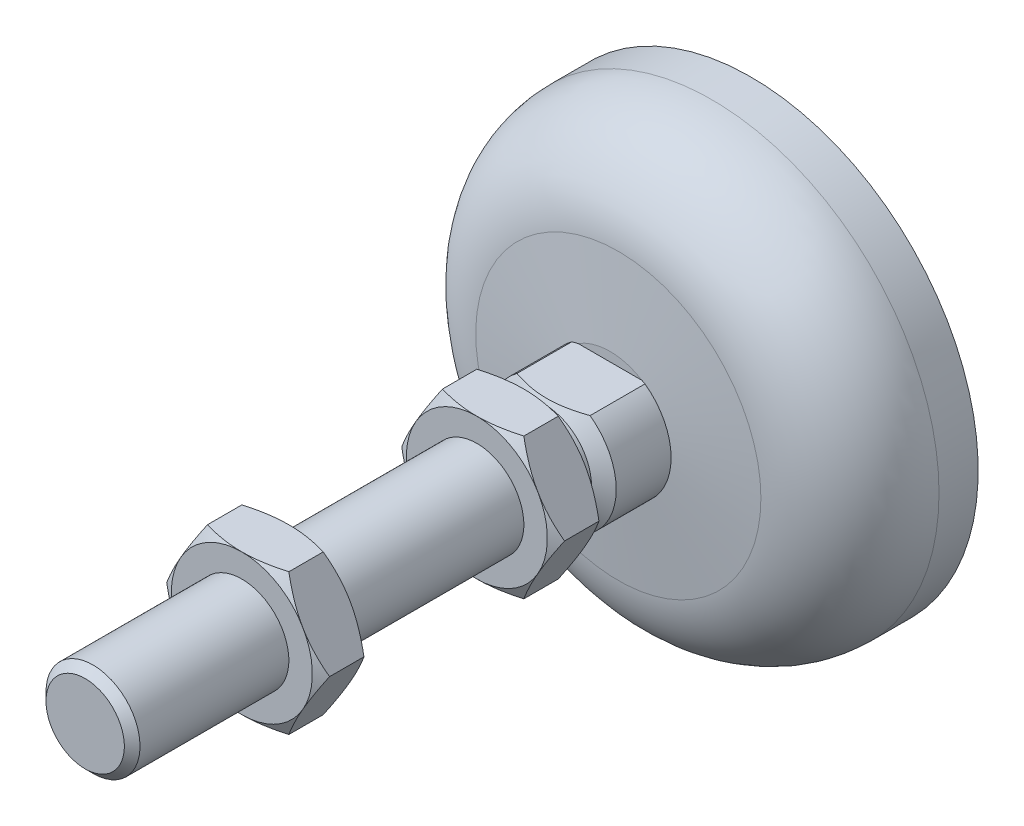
ISO-10303-21;
HEADER;
FILE_DESCRIPTION(('STEP AP214'),'2;1');
FILE_NAME('part.step','',(''),(''),'','','');
FILE_SCHEMA(('AUTOMOTIVE_DESIGN { 1 0 10303 214 1 1 1 1 }'));
ENDSEC;
DATA;
#1=APPLICATION_CONTEXT('core data for automotive mechanical design processes');
#2=APPLICATION_PROTOCOL_DEFINITION('international standard','automotive_design',2000,#1);
#3=PRODUCT_CONTEXT('',#1,'mechanical');
#4=PRODUCT('Part','Part','',(#3));
#5=PRODUCT_RELATED_PRODUCT_CATEGORY('part','',(#4));
#6=PRODUCT_DEFINITION_FORMATION('','',#4);
#7=PRODUCT_DEFINITION_CONTEXT('part definition',#1,'design');
#8=PRODUCT_DEFINITION('design','',#6,#7);
#9=PRODUCT_DEFINITION_SHAPE('','',#8);
#10=(LENGTH_UNIT() NAMED_UNIT(*) SI_UNIT(.MILLI.,.METRE.));
#11=(NAMED_UNIT(*) PLANE_ANGLE_UNIT() SI_UNIT($,.RADIAN.));
#12=(NAMED_UNIT(*) SI_UNIT($,.STERADIAN.) SOLID_ANGLE_UNIT());
#13=UNCERTAINTY_MEASURE_WITH_UNIT(LENGTH_MEASURE(1.E-05),#10,'distance_accuracy_value','');
#14=(GEOMETRIC_REPRESENTATION_CONTEXT(3) GLOBAL_UNCERTAINTY_ASSIGNED_CONTEXT((#13)) GLOBAL_UNIT_ASSIGNED_CONTEXT((#10,
#11,#12)) REPRESENTATION_CONTEXT('',''));
#15=CARTESIAN_POINT('',(0.,0.,0.));
#16=DIRECTION('',(0.,0.,1.));
#17=DIRECTION('',(1.,0.,0.));
#18=AXIS2_PLACEMENT_3D('',#15,#16,#17);
#19=CARTESIAN_POINT('',(0.,0.,85.));
#20=DIRECTION('',(0.,0.,1.));
#21=DIRECTION('',(1.,0.,0.));
#22=AXIS2_PLACEMENT_3D('',#19,#20,#21);
#23=PLANE('',#22);
#24=CARTESIAN_POINT('',(0.,0.,84.9999999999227));
#25=DIRECTION('',(0.,0.,-1.));
#26=DIRECTION('',(-1.,0.,0.));
#27=AXIS2_PLACEMENT_3D('',#24,#25,#26);
#28=CIRCLE('',#27,5.0000000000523);
#29=CARTESIAN_POINT('',(-5.0000000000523,0.,84.9999999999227));
#30=VERTEX_POINT('',#29);
#31=EDGE_CURVE('E500',#30,#30,#28,.T.);
#32=ORIENTED_EDGE('',*,*,#31,.F.);
#33=EDGE_LOOP('',(#32));
#34=FACE_BOUND('',#33,.T.);
#35=ADVANCED_FACE('F17',(#34),#23,.T.);
#36=CARTESIAN_POINT('',(0.,0.,84.0000000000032));
#37=DIRECTION('',(0.,0.,-1.));
#38=DIRECTION('',(-1.,0.,0.));
#39=AXIS2_PLACEMENT_3D('',#36,#37,#38);
#40=CONICAL_SURFACE('',#39,5.99999999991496,0.785398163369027);
#41=CARTESIAN_POINT('',(0.,0.,84.));
#42=DIRECTION('',(0.,0.,-1.));
#43=DIRECTION('',(-1.,0.,0.));
#44=AXIS2_PLACEMENT_3D('',#41,#42,#43);
#45=CIRCLE('',#44,6.);
#46=CARTESIAN_POINT('',(-6.,0.,84.));
#47=VERTEX_POINT('',#46);
#48=EDGE_CURVE('E497',#47,#47,#45,.T.);
#49=ORIENTED_EDGE('',*,*,#48,.F.);
#50=EDGE_LOOP('',(#49));
#51=FACE_BOUND('',#50,.T.);
#52=ORIENTED_EDGE('',*,*,#31,.T.);
#53=EDGE_LOOP('',(#52));
#54=FACE_BOUND('',#53,.T.);
#55=ADVANCED_FACE('F1364',(#51,#54),#40,.T.);
#56=CARTESIAN_POINT('',(0.,0.,6.750313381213));
#57=DIRECTION('',(0.,0.,-1.));
#58=DIRECTION('',(-1.,0.,0.));
#59=AXIS2_PLACEMENT_3D('',#56,#57,#58);
#60=CYLINDRICAL_SURFACE('',#59,6.);
#61=ORIENTED_EDGE('',*,*,#48,.T.);
#62=EDGE_LOOP('',(#61));
#63=FACE_BOUND('',#62,.T.);
#64=CARTESIAN_POINT('',(0.,0.,65.));
#65=DIRECTION('',(0.,0.,-1.));
#66=DIRECTION('',(-1.,0.,0.));
#67=AXIS2_PLACEMENT_3D('',#64,#65,#66);
#68=CIRCLE('',#67,6.);
#69=CARTESIAN_POINT('',(-6.,0.,65.));
#70=VERTEX_POINT('',#69);
#71=EDGE_CURVE('E240',#70,#70,#68,.F.);
#72=ORIENTED_EDGE('',*,*,#71,.T.);
#73=EDGE_LOOP('',(#72));
#74=FACE_BOUND('',#73,.T.);
#75=ADVANCED_FACE('F1355',(#63,#74),#60,.T.);
#76=CARTESIAN_POINT('',(0.,0.,65.));
#77=DIRECTION('',(0.,0.,-1.));
#78=DIRECTION('',(-1.,0.,0.));
#79=AXIS2_PLACEMENT_3D('',#76,#77,#78);
#80=PLANE('',#79);
#81=ORIENTED_EDGE('',*,*,#71,.F.);
#82=EDGE_LOOP('',(#81));
#83=FACE_BOUND('',#82,.T.);
#84=CARTESIAN_POINT('',(0.,0.,64.9999999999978));
#85=DIRECTION('',(0.,0.,-1.));
#86=DIRECTION('',(-1.,0.,0.));
#87=AXIS2_PLACEMENT_3D('',#84,#85,#86);
#88=CIRCLE('',#87,8.99999999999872);
#89=CARTESIAN_POINT('',(-7.7942286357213,4.49999999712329,64.9999999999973));
#90=VERTEX_POINT('',#89);
#91=CARTESIAN_POINT('',(-3.32207389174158E-09,8.99999999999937,64.9999999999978));
#92=VERTEX_POINT('',#91);
#93=EDGE_CURVE('E220',#90,#92,#88,.T.);
#94=ORIENTED_EDGE('',*,*,#93,.F.);
#95=CARTESIAN_POINT('',(0.,0.,64.9999999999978));
#96=DIRECTION('',(0.,0.,-1.));
#97=DIRECTION('',(-1.,0.,0.));
#98=AXIS2_PLACEMENT_3D('',#95,#96,#97);
#99=CIRCLE('',#98,8.99999999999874);
#100=CARTESIAN_POINT('',(-7.7942286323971,-4.50000000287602,64.9999999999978));
#101=VERTEX_POINT('',#100);
#102=EDGE_CURVE('E216',#101,#90,#99,.T.);
#103=ORIENTED_EDGE('',*,*,#102,.F.);
#104=CARTESIAN_POINT('',(0.,0.,64.9999999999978));
#105=DIRECTION('',(0.,0.,-1.));
#106=DIRECTION('',(-1.,0.,0.));
#107=AXIS2_PLACEMENT_3D('',#104,#105,#106);
#108=CIRCLE('',#107,8.99999999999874);
#109=CARTESIAN_POINT('',(3.32207943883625E-09,-8.99999999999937,64.9999999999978));
#110=VERTEX_POINT('',#109);
#111=EDGE_CURVE('E213',#110,#101,#108,.T.);
#112=ORIENTED_EDGE('',*,*,#111,.F.);
#113=CARTESIAN_POINT('',(0.,0.,64.9999999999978));
#114=DIRECTION('',(0.,0.,-1.));
#115=DIRECTION('',(-1.,0.,0.));
#116=AXIS2_PLACEMENT_3D('',#113,#114,#115);
#117=CIRCLE('',#116,8.99999999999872);
#118=CARTESIAN_POINT('',(7.79422863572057,-4.49999999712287,64.9999999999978));
#119=VERTEX_POINT('',#118);
#120=EDGE_CURVE('E1472',#119,#110,#117,.T.);
#121=ORIENTED_EDGE('',*,*,#120,.F.);
#122=CARTESIAN_POINT('',(0.,0.,64.9999999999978));
#123=DIRECTION('',(0.,0.,-1.));
#124=DIRECTION('',(-1.,0.,0.));
#125=AXIS2_PLACEMENT_3D('',#122,#123,#124);
#126=CIRCLE('',#125,8.99999999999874);
#127=CARTESIAN_POINT('',(7.79422863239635,4.50000000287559,64.9999999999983));
#128=VERTEX_POINT('',#127);
#129=EDGE_CURVE('E283',#128,#119,#126,.T.);
#130=ORIENTED_EDGE('',*,*,#129,.F.);
#131=CARTESIAN_POINT('',(0.,0.,64.9999999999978));
#132=DIRECTION('',(0.,0.,-1.));
#133=DIRECTION('',(-1.,0.,0.));
#134=AXIS2_PLACEMENT_3D('',#131,#132,#133);
#135=CIRCLE('',#134,8.99999999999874);
#136=EDGE_CURVE('E1470',#92,#128,#135,.T.);
#137=ORIENTED_EDGE('',*,*,#136,.F.);
#138=EDGE_LOOP('',(#94,#103,#112,#121,#130,#137));
#139=FACE_BOUND('',#138,.T.);
#140=ADVANCED_FACE('F218',(#83,#139),#80,.F.);
#141=CARTESIAN_POINT('',(0.,0.,64.1913293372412));
#142=DIRECTION('',(0.,0.,-1.));
#143=DIRECTION('',(-1.,0.,0.));
#144=AXIS2_PLACEMENT_3D('',#141,#142,#143);
#145=CONICAL_SURFACE('',#144,10.400658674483,1.0471975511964);
#146=ORIENTED_EDGE('',*,*,#111,.T.);
#147=CARTESIAN_POINT('',(-7.79422863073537,-4.50000000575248,64.9999999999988));
#148=CARTESIAN_POINT('',(-7.6839548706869,-4.69099976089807,65.0000367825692));
#149=CARTESIAN_POINT('',(-7.57368642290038,-4.88199031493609,64.9953203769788));
#150=CARTESIAN_POINT('',(-7.35336604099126,-5.26359641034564,64.9766545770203));
#151=CARTESIAN_POINT('',(-7.24331406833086,-5.45421201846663,64.9627070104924));
#152=CARTESIAN_POINT('',(-7.02413748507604,-5.8338369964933,64.925944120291));
#153=CARTESIAN_POINT('',(-6.91501098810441,-6.02284963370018,64.9031734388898));
#154=CARTESIAN_POINT('',(-6.69727791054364,-6.39997438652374,64.8492541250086));
#155=CARTESIAN_POINT('',(-6.58867134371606,-6.58808647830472,64.8181052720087));
#156=CARTESIAN_POINT('',(-6.26408172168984,-7.1502921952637,64.7130537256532));
#157=CARTESIAN_POINT('',(-6.04904161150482,-7.52275259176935,64.6274950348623));
#158=CARTESIAN_POINT('',(-5.62081064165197,-8.26447038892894,64.4301748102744));
#159=CARTESIAN_POINT('',(-5.40763471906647,-8.63370191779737,64.3182824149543));
#160=CARTESIAN_POINT('',(-5.19615242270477,-8.99999999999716,64.1961524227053));
#161=B_SPLINE_CURVE_WITH_KNOTS('',3,(#147,#148,#149,#150,#151,#152,#153,#154,#155,#156,#157,
#158,#159,#160),.UNSPECIFIED.,.F.,.F.,(4,2,2,2,2,2,4),(0.,0.661575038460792,1.32301911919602,
1.98115929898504,2.63931680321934,3.95390679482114,5.27517277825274),.UNSPECIFIED.);
#162=CARTESIAN_POINT('',(-5.19615242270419,-8.99999999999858,64.1961524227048));
#163=VERTEX_POINT('',#162);
#164=EDGE_CURVE('E232',#101,#163,#161,.T.);
#165=ORIENTED_EDGE('',*,*,#164,.T.);
#166=CARTESIAN_POINT('',(-5.1961524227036,-9.,64.1961524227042));
#167=CARTESIAN_POINT('',(-4.77318782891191,-9.,64.3182824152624));
#168=CARTESIAN_POINT('',(-4.34683598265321,-9.,64.4301748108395));
#169=CARTESIAN_POINT('',(-3.49037404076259,-9.,64.6274950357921));
#170=CARTESIAN_POINT('',(-3.06029381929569,-9.,64.7130537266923));
#171=CARTESIAN_POINT('',(-2.41111457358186,-9.,64.8181052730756));
#172=CARTESIAN_POINT('',(-2.19390143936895,-9.,64.8492541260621));
#173=CARTESIAN_POINT('',(-1.75843528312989,-9.,64.9031734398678));
#174=CARTESIAN_POINT('',(-1.54018228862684,-9.,64.9259441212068));
#175=CARTESIAN_POINT('',(-1.10182912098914,-9.,64.9627070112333));
#176=CARTESIAN_POINT('',(-0.881725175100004,-9.,64.9766545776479));
#177=CARTESIAN_POINT('',(-0.441084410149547,-9.,64.9953203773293));
#178=CARTESIAN_POINT('',(-0.220547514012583,-9.,65.000036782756));
#179=CARTESIAN_POINT('',(6.64415698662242E-09,-9.,64.9999999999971));
#180=B_SPLINE_CURVE_WITH_KNOTS('',3,(#166,#167,#168,#169,#170,#171,#172,#173,#174,#175,#176,
#177,#178,#179),.UNSPECIFIED.,.F.,.F.,(4,2,2,2,2,2,4),(0.,1.3212659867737,2.63585598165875,
3.29401348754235,3.95215366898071,4.61359775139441,5.2751727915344),.UNSPECIFIED.);
#181=EDGE_CURVE('E238',#163,#110,#180,.T.);
#182=ORIENTED_EDGE('',*,*,#181,.T.);
#183=EDGE_LOOP('',(#146,#165,#182));
#184=FACE_BOUND('',#183,.T.);
#185=ADVANCED_FACE('F236',(#184),#145,.T.);
#186=CARTESIAN_POINT('',(0.,0.,64.1913293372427));
#187=DIRECTION('',(0.,0.,-1.));
#188=DIRECTION('',(-1.,0.,0.));
#189=AXIS2_PLACEMENT_3D('',#186,#187,#188);
#190=CONICAL_SURFACE('',#189,10.4006586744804,1.0471975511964);
#191=ORIENTED_EDGE('',*,*,#102,.T.);
#192=CARTESIAN_POINT('',(-7.79422863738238,4.49999999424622,64.9999999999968));
#193=CARTESIAN_POINT('',(-7.90450239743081,4.30900023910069,65.0000367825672));
#194=CARTESIAN_POINT('',(-8.0147708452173,4.11800968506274,64.9953203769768));
#195=CARTESIAN_POINT('',(-8.23509122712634,3.73640358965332,64.9766545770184));
#196=CARTESIAN_POINT('',(-8.34514319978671,3.54578798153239,64.9627070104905));
#197=CARTESIAN_POINT('',(-8.56431978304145,3.16616300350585,64.9259441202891));
#198=CARTESIAN_POINT('',(-8.67344628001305,2.97715036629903,64.9031734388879));
#199=CARTESIAN_POINT('',(-8.89117935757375,2.60002561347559,64.8492541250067));
#200=CARTESIAN_POINT('',(-8.99978592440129,2.41191352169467,64.8181052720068));
#201=CARTESIAN_POINT('',(-9.32437554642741,1.84970780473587,64.7130537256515));
#202=CARTESIAN_POINT('',(-9.53941565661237,1.47724740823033,64.6274950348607));
#203=CARTESIAN_POINT('',(-9.96764662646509,0.735529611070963,64.4301748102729));
#204=CARTESIAN_POINT('',(-10.1808225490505,0.366298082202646,64.3182824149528));
#205=CARTESIAN_POINT('',(-10.3923048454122,2.96281224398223E-12,64.196152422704));
#206=B_SPLINE_CURVE_WITH_KNOTS('',3,(#192,#193,#194,#195,#196,#197,#198,#199,#200,#201,#202,
#203,#204,#205),.UNSPECIFIED.,.F.,.F.,(4,2,2,2,2,2,4),(0.,0.661575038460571,1.32301911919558,
1.98115929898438,2.63931680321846,3.95390679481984,5.275172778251),.UNSPECIFIED.);
#207=CARTESIAN_POINT('',(-10.3923048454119,0.,64.1961524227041));
#208=VERTEX_POINT('',#207);
#209=EDGE_CURVE('E228',#90,#208,#206,.T.);
#210=ORIENTED_EDGE('',*,*,#209,.T.);
#211=CARTESIAN_POINT('',(-10.3923048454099,-1.32202673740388E-13,64.1961524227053));
#212=CARTESIAN_POINT('',(-10.180822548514,-0.366298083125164,64.3182824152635));
#213=CARTESIAN_POINT('',(-9.96764662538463,-0.735529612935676,64.4301748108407));
#214=CARTESIAN_POINT('',(-9.53941565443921,-1.47724741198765,64.6274950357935));
#215=CARTESIAN_POINT('',(-9.3243755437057,-1.84970780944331,64.7130537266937));
#216=CARTESIAN_POINT('',(-8.99978592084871,-2.41191352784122,64.8181052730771));
#217=CARTESIAN_POINT('',(-8.89117935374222,-2.60002562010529,64.8492541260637));
#218=CARTESIAN_POINT('',(-8.67344627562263,-2.97715037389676,64.9031734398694));
#219=CARTESIAN_POINT('',(-8.56431977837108,-3.16616301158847,64.9259441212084));
#220=CARTESIAN_POINT('',(-8.34514319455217,-3.54578799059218,64.962707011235));
#221=CARTESIAN_POINT('',(-8.23509122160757,-3.73640359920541,64.9766545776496));
#222=CARTESIAN_POINT('',(-8.01477083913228,-4.1180096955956,64.995320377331));
#223=CARTESIAN_POINT('',(-7.90450239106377,-4.30900025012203,65.0000367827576));
#224=CARTESIAN_POINT('',(-7.79422863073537,-4.50000000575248,64.9999999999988));
#225=B_SPLINE_CURVE_WITH_KNOTS('',3,(#211,#212,#213,#214,#215,#216,#217,#218,#219,#220,#221,
#222,#223,#224),.UNSPECIFIED.,.F.,.F.,(4,2,2,2,2,2,4),(0.,1.32126598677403,2.6358559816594,
3.29401348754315,3.95215366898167,4.61359775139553,5.27517279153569),.UNSPECIFIED.);
#226=EDGE_CURVE('E226',#208,#101,#225,.T.);
#227=ORIENTED_EDGE('',*,*,#226,.T.);
#228=EDGE_LOOP('',(#191,#210,#227));
#229=FACE_BOUND('',#228,.T.);
#230=ADVANCED_FACE('F227',(#229),#190,.T.);
#231=CARTESIAN_POINT('',(0.,0.,64.1913293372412));
#232=DIRECTION('',(0.,0.,-1.));
#233=DIRECTION('',(-1.,0.,0.));
#234=AXIS2_PLACEMENT_3D('',#231,#232,#233);
#235=CONICAL_SURFACE('',#234,10.400658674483,1.0471975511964);
#236=ORIENTED_EDGE('',*,*,#93,.T.);
#237=CARTESIAN_POINT('',(-6.64414774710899E-09,9.,64.9999999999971));
#238=CARTESIAN_POINT('',(-0.220547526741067,9.,65.0000367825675));
#239=CARTESIAN_POINT('',(-0.441084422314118,9.,64.9953203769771));
#240=CARTESIAN_POINT('',(-0.88172518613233,9.,64.9766545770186));
#241=CARTESIAN_POINT('',(-1.10182913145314,9.,64.9627070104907));
#242=CARTESIAN_POINT('',(-1.54018229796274,9.,64.9259441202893));
#243=CARTESIAN_POINT('',(-1.75843529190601,9.,64.9031734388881));
#244=CARTESIAN_POINT('',(-2.19390144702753,9.,64.8492541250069));
#245=CARTESIAN_POINT('',(-2.41111458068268,9.,64.818105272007));
#246=CARTESIAN_POINT('',(-3.06029382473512,9.,64.7130537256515));
#247=CARTESIAN_POINT('',(-3.49037404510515,9.,64.6274950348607));
#248=CARTESIAN_POINT('',(-4.34683598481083,9.,64.4301748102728));
#249=CARTESIAN_POINT('',(-4.77318782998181,9.,64.3182824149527));
#250=CARTESIAN_POINT('',(-5.1961524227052,9.,64.1961524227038));
#251=B_SPLINE_CURVE_WITH_KNOTS('',3,(#237,#238,#239,#240,#241,#242,#243,#244,#245,#246,#247,
#248,#249,#250),.UNSPECIFIED.,.F.,.F.,(4,2,2,2,2,2,4),(0.,0.661575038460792,1.32301911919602,
1.98115929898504,2.63931680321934,3.95390679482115,5.27517277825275),.UNSPECIFIED.);
#252=CARTESIAN_POINT('',(-5.19615242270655,8.99999999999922,64.1961524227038));
#253=VERTEX_POINT('',#252);
#254=EDGE_CURVE('E394',#92,#253,#251,.T.);
#255=ORIENTED_EDGE('',*,*,#254,.T.);
#256=CARTESIAN_POINT('',(-5.1961524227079,8.99999999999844,64.1961524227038));
#257=CARTESIAN_POINT('',(-5.40763471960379,8.63370191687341,64.318282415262));
#258=CARTESIAN_POINT('',(-5.62081064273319,8.2644703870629,64.4301748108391));
#259=CARTESIAN_POINT('',(-6.0490416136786,7.52275258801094,64.6274950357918));
#260=CARTESIAN_POINT('',(-6.2640817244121,7.15029219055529,64.713053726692));
#261=CARTESIAN_POINT('',(-6.58867134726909,6.5880864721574,64.8181052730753));
#262=CARTESIAN_POINT('',(-6.69727791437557,6.39997437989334,64.8492541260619));
#263=CARTESIAN_POINT('',(-6.91501099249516,6.02284962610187,64.9031734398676));
#264=CARTESIAN_POINT('',(-7.0241374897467,5.83383698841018,64.9259441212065));
#265=CARTESIAN_POINT('',(-7.2433140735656,5.45421200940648,64.9627070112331));
#266=CARTESIAN_POINT('',(-7.3533660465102,5.26359640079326,64.9766545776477));
#267=CARTESIAN_POINT('',(-7.57368642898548,4.88199030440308,64.9953203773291));
#268=CARTESIAN_POINT('',(-7.68395487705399,4.69099974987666,65.0000367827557));
#269=CARTESIAN_POINT('',(-7.79422863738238,4.49999999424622,64.9999999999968));
#270=B_SPLINE_CURVE_WITH_KNOTS('',3,(#256,#257,#258,#259,#260,#261,#262,#263,#264,#265,#266,
#267,#268,#269),.UNSPECIFIED.,.F.,.F.,(4,2,2,2,2,2,4),(0.,1.32126598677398,2.63585598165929,
3.29401348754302,3.95215366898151,4.61359775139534,5.27517279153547),.UNSPECIFIED.);
#271=EDGE_CURVE('E247',#253,#90,#270,.T.);
#272=ORIENTED_EDGE('',*,*,#271,.T.);
#273=EDGE_LOOP('',(#236,#255,#272));
#274=FACE_BOUND('',#273,.T.);
#275=ADVANCED_FACE('F382',(#274),#235,.T.);
#276=CARTESIAN_POINT('',(0.,0.,64.1913293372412));
#277=DIRECTION('',(0.,0.,-1.));
#278=DIRECTION('',(-1.,0.,0.));
#279=AXIS2_PLACEMENT_3D('',#276,#277,#278);
#280=CONICAL_SURFACE('',#279,10.400658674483,1.0471975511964);
#281=ORIENTED_EDGE('',*,*,#136,.T.);
#282=CARTESIAN_POINT('',(7.79422863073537,4.50000000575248,64.9999999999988));
#283=CARTESIAN_POINT('',(7.68395487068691,4.69099976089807,65.0000367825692));
#284=CARTESIAN_POINT('',(7.57368642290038,4.88199031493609,64.9953203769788));
#285=CARTESIAN_POINT('',(7.35336604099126,5.26359641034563,64.9766545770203));
#286=CARTESIAN_POINT('',(7.24331406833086,5.45421201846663,64.9627070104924));
#287=CARTESIAN_POINT('',(7.02413748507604,5.8338369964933,64.925944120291));
#288=CARTESIAN_POINT('',(6.91501098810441,6.02284963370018,64.9031734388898));
#289=CARTESIAN_POINT('',(6.69727791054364,6.39997438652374,64.8492541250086));
#290=CARTESIAN_POINT('',(6.58867134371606,6.58808647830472,64.8181052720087));
#291=CARTESIAN_POINT('',(6.26408172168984,7.1502921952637,64.7130537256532));
#292=CARTESIAN_POINT('',(6.04904161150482,7.52275259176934,64.6274950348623));
#293=CARTESIAN_POINT('',(5.62081064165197,8.26447038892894,64.4301748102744));
#294=CARTESIAN_POINT('',(5.40763471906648,8.63370191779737,64.3182824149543));
#295=CARTESIAN_POINT('',(5.19615242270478,8.99999999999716,64.1961524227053));
#296=B_SPLINE_CURVE_WITH_KNOTS('',3,(#282,#283,#284,#285,#286,#287,#288,#289,#290,#291,#292,
#293,#294,#295),.UNSPECIFIED.,.F.,.F.,(4,2,2,2,2,2,4),(0.,0.661575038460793,1.32301911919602,
1.98115929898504,2.63931680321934,3.95390679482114,5.27517277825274),.UNSPECIFIED.);
#297=CARTESIAN_POINT('',(5.19615242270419,8.99999999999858,64.1961524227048));
#298=VERTEX_POINT('',#297);
#299=EDGE_CURVE('E367',#128,#298,#296,.T.);
#300=ORIENTED_EDGE('',*,*,#299,.T.);
#301=CARTESIAN_POINT('',(5.1961524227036,9.,64.1961524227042));
#302=CARTESIAN_POINT('',(4.77318782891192,9.,64.3182824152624));
#303=CARTESIAN_POINT('',(4.34683598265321,9.,64.4301748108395));
#304=CARTESIAN_POINT('',(3.49037404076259,9.,64.6274950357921));
#305=CARTESIAN_POINT('',(3.06029381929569,9.,64.7130537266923));
#306=CARTESIAN_POINT('',(2.41111457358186,9.,64.8181052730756));
#307=CARTESIAN_POINT('',(2.19390143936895,9.,64.8492541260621));
#308=CARTESIAN_POINT('',(1.75843528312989,9.,64.9031734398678));
#309=CARTESIAN_POINT('',(1.54018228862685,9.,64.9259441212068));
#310=CARTESIAN_POINT('',(1.10182912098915,9.,64.9627070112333));
#311=CARTESIAN_POINT('',(0.881725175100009,9.,64.9766545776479));
#312=CARTESIAN_POINT('',(0.441084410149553,9.,64.9953203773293));
#313=CARTESIAN_POINT('',(0.22054751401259,9.,65.000036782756));
#314=CARTESIAN_POINT('',(-6.64415002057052E-09,9.,64.9999999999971));
#315=B_SPLINE_CURVE_WITH_KNOTS('',3,(#301,#302,#303,#304,#305,#306,#307,#308,#309,#310,#311,
#312,#313,#314),.UNSPECIFIED.,.F.,.F.,(4,2,2,2,2,2,4),(0.,1.3212659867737,2.63585598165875,
3.29401348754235,3.95215366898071,4.6135977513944,5.2751727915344),.UNSPECIFIED.);
#316=EDGE_CURVE('E387',#298,#92,#315,.T.);
#317=ORIENTED_EDGE('',*,*,#316,.T.);
#318=EDGE_LOOP('',(#281,#300,#317));
#319=FACE_BOUND('',#318,.T.);
#320=ADVANCED_FACE('F377',(#319),#280,.T.);
#321=CARTESIAN_POINT('',(0.,0.,64.1913293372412));
#322=DIRECTION('',(0.,0.,-1.));
#323=DIRECTION('',(-1.,0.,0.));
#324=AXIS2_PLACEMENT_3D('',#321,#322,#323);
#325=CONICAL_SURFACE('',#324,10.400658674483,1.0471975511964);
#326=ORIENTED_EDGE('',*,*,#120,.T.);
#327=CARTESIAN_POINT('',(6.64415589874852E-09,-9.,64.9999999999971));
#328=CARTESIAN_POINT('',(0.220547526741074,-9.,65.0000367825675));
#329=CARTESIAN_POINT('',(0.441084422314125,-9.,64.9953203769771));
#330=CARTESIAN_POINT('',(0.881725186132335,-9.,64.9766545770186));
#331=CARTESIAN_POINT('',(1.10182913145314,-9.,64.9627070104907));
#332=CARTESIAN_POINT('',(1.54018229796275,-9.,64.9259441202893));
#333=CARTESIAN_POINT('',(1.75843529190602,-9.,64.9031734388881));
#334=CARTESIAN_POINT('',(2.19390144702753,-9.,64.8492541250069));
#335=CARTESIAN_POINT('',(2.41111458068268,-9.,64.818105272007));
#336=CARTESIAN_POINT('',(3.06029382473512,-9.,64.7130537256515));
#337=CARTESIAN_POINT('',(3.49037404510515,-9.,64.6274950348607));
#338=CARTESIAN_POINT('',(4.34683598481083,-9.,64.4301748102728));
#339=CARTESIAN_POINT('',(4.7731878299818,-9.,64.3182824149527));
#340=CARTESIAN_POINT('',(5.1961524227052,-9.,64.1961524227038));
#341=B_SPLINE_CURVE_WITH_KNOTS('',3,(#327,#328,#329,#330,#331,#332,#333,#334,#335,#336,#337,
#338,#339,#340),.UNSPECIFIED.,.F.,.F.,(4,2,2,2,2,2,4),(0.,0.66157503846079,1.32301911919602,
1.98115929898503,2.63931680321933,3.95390679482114,5.27517277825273),.UNSPECIFIED.);
#342=CARTESIAN_POINT('',(5.1961524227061,-9.,64.1961524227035));
#343=VERTEX_POINT('',#342);
#344=EDGE_CURVE('E233',#110,#343,#341,.T.);
#345=ORIENTED_EDGE('',*,*,#344,.T.);
#346=CARTESIAN_POINT('',(5.1961524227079,-8.99999999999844,64.1961524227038));
#347=CARTESIAN_POINT('',(5.40763471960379,-8.63370191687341,64.318282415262));
#348=CARTESIAN_POINT('',(5.6208106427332,-8.2644703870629,64.4301748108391));
#349=CARTESIAN_POINT('',(6.0490416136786,-7.52275258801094,64.6274950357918));
#350=CARTESIAN_POINT('',(6.2640817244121,-7.15029219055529,64.713053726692));
#351=CARTESIAN_POINT('',(6.58867134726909,-6.58808647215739,64.8181052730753));
#352=CARTESIAN_POINT('',(6.69727791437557,-6.39997437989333,64.8492541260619));
#353=CARTESIAN_POINT('',(6.91501099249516,-6.02284962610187,64.9031734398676));
#354=CARTESIAN_POINT('',(7.0241374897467,-5.83383698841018,64.9259441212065));
#355=CARTESIAN_POINT('',(7.2433140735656,-5.45421200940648,64.9627070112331));
#356=CARTESIAN_POINT('',(7.3533660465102,-5.26359640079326,64.9766545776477));
#357=CARTESIAN_POINT('',(7.57368642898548,-4.88199030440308,64.9953203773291));
#358=CARTESIAN_POINT('',(7.68395487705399,-4.69099974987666,65.0000367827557));
#359=CARTESIAN_POINT('',(7.79422863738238,-4.49999999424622,64.9999999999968));
#360=B_SPLINE_CURVE_WITH_KNOTS('',3,(#346,#347,#348,#349,#350,#351,#352,#353,#354,#355,#356,
#357,#358,#359),.UNSPECIFIED.,.F.,.F.,(4,2,2,2,2,2,4),(0.,1.32126598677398,2.63585598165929,
3.29401348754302,3.95215366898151,4.61359775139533,5.27517279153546),.UNSPECIFIED.);
#361=EDGE_CURVE('E359',#343,#119,#360,.T.);
#362=ORIENTED_EDGE('',*,*,#361,.T.);
#363=EDGE_LOOP('',(#326,#345,#362));
#364=FACE_BOUND('',#363,.T.);
#365=ADVANCED_FACE('F374',(#364),#325,.T.);
#366=CARTESIAN_POINT('',(0.,0.,64.1913293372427));
#367=DIRECTION('',(0.,0.,-1.));
#368=DIRECTION('',(-1.,0.,0.));
#369=AXIS2_PLACEMENT_3D('',#366,#367,#368);
#370=CONICAL_SURFACE('',#369,10.4006586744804,1.0471975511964);
#371=ORIENTED_EDGE('',*,*,#129,.T.);
#372=CARTESIAN_POINT('',(7.79422863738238,-4.49999999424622,64.9999999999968));
#373=CARTESIAN_POINT('',(7.9045023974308,-4.3090002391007,65.0000367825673));
#374=CARTESIAN_POINT('',(8.01477084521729,-4.11800968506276,64.9953203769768));
#375=CARTESIAN_POINT('',(8.23509122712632,-3.73640358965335,64.9766545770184));
#376=CARTESIAN_POINT('',(8.34514319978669,-3.54578798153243,64.9627070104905));
#377=CARTESIAN_POINT('',(8.56431978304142,-3.1661630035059,64.9259441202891));
#378=CARTESIAN_POINT('',(8.67344628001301,-2.9771503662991,64.9031734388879));
#379=CARTESIAN_POINT('',(8.8911793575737,-2.60002561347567,64.8492541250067));
#380=CARTESIAN_POINT('',(8.99978592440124,-2.41191352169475,64.8181052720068));
#381=CARTESIAN_POINT('',(9.32437554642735,-1.84970780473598,64.7130537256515));
#382=CARTESIAN_POINT('',(9.5394156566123,-1.47724740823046,64.6274950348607));
#383=CARTESIAN_POINT('',(9.967646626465,-0.73552961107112,64.4301748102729));
#384=CARTESIAN_POINT('',(10.1808225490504,-0.366298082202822,64.3182824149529));
#385=CARTESIAN_POINT('',(10.392304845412,-3.15543348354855E-12,64.1961524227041));
#386=B_SPLINE_CURVE_WITH_KNOTS('',3,(#372,#373,#374,#375,#376,#377,#378,#379,#380,#381,#382,
#383,#384,#385),.UNSPECIFIED.,.F.,.F.,(4,2,2,2,2,2,4),(0.,0.661575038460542,1.32301911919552,
1.98115929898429,2.63931680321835,3.95390679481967,5.27517277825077),.UNSPECIFIED.);
#387=CARTESIAN_POINT('',(10.3923048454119,0.,64.1961524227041));
#388=VERTEX_POINT('',#387);
#389=EDGE_CURVE('E353',#119,#388,#386,.T.);
#390=ORIENTED_EDGE('',*,*,#389,.T.);
#391=CARTESIAN_POINT('',(10.39230484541,0.,64.1961524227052));
#392=CARTESIAN_POINT('',(10.1808225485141,0.36629808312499,64.3182824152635));
#393=CARTESIAN_POINT('',(9.96764662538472,0.735529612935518,64.4301748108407));
#394=CARTESIAN_POINT('',(9.53941565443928,1.47724741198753,64.6274950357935));
#395=CARTESIAN_POINT('',(9.32437554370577,1.8497078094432,64.7130537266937));
#396=CARTESIAN_POINT('',(8.99978592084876,2.41191352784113,64.8181052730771));
#397=CARTESIAN_POINT('',(8.89117935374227,2.6000256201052,64.8492541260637));
#398=CARTESIAN_POINT('',(8.67344627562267,2.97715037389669,64.9031734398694));
#399=CARTESIAN_POINT('',(8.56431977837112,3.16616301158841,64.9259441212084));
#400=CARTESIAN_POINT('',(8.3451431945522,3.54578799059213,64.962707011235));
#401=CARTESIAN_POINT('',(8.23509122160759,3.73640359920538,64.9766545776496));
#402=CARTESIAN_POINT('',(8.01477083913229,4.11800969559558,64.995320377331));
#403=CARTESIAN_POINT('',(7.90450239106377,4.30900025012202,65.0000367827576));
#404=CARTESIAN_POINT('',(7.79422863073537,4.50000000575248,64.9999999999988));
#405=B_SPLINE_CURVE_WITH_KNOTS('',3,(#391,#392,#393,#394,#395,#396,#397,#398,#399,#400,#401,
#402,#403,#404),.UNSPECIFIED.,.F.,.F.,(4,2,2,2,2,2,4),(0.,1.32126598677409,2.63585598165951,
3.29401348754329,3.95215366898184,4.61359775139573,5.27517279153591),.UNSPECIFIED.);
#406=EDGE_CURVE('E495',#388,#128,#405,.T.);
#407=ORIENTED_EDGE('',*,*,#406,.T.);
#408=EDGE_LOOP('',(#371,#390,#407));
#409=FACE_BOUND('',#408,.T.);
#410=ADVANCED_FACE('F294',(#409),#370,.T.);
#411=CARTESIAN_POINT('',(-5.196152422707,-9.,29.));
#412=DIRECTION('',(0.,1.,0.));
#413=DIRECTION('',(0.,0.,1.));
#414=AXIS2_PLACEMENT_3D('',#411,#412,#413);
#415=PLANE('',#414);
#416=ORIENTED_EDGE('',*,*,#344,.F.);
#417=ORIENTED_EDGE('',*,*,#181,.F.);
#418=DIRECTION('',(0.,0.,1.));
#419=VECTOR('',#418,1.);
#420=CARTESIAN_POINT('',(-5.1961524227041,-8.99999999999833,29.));
#421=LINE('',#420,#419);
#422=CARTESIAN_POINT('',(-5.1961524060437,-9.00000002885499,59.803847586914));
#423=VERTEX_POINT('',#422);
#424=EDGE_CURVE('E245',#163,#423,#421,.F.);
#425=ORIENTED_EDGE('',*,*,#424,.T.);
#426=CARTESIAN_POINT('',(6.64415024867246E-09,-9.,59.0000000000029));
#427=CARTESIAN_POINT('',(-0.220547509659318,-9.,58.9999632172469));
#428=CARTESIAN_POINT('',(-0.44108440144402,-9.,59.004679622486));
#429=CARTESIAN_POINT('',(-0.881725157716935,-9.,59.0233454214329));
#430=CARTESIAN_POINT('',(-1.10182909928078,-9.,59.0372929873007));
#431=CARTESIAN_POINT('',(-1.54018225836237,-9.,59.0740558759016));
#432=CARTESIAN_POINT('',(-1.75843524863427,-9.,59.0968265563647));
#433=CARTESIAN_POINT('',(-2.19390139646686,-9.,59.1507458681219));
#434=CARTESIAN_POINT('',(-2.41111452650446,-9.,59.181894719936));
#435=CARTESIAN_POINT('',(-3.06029375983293,-9.,59.2869462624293));
#436=CARTESIAN_POINT('',(-3.49037397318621,-9.,59.3725049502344));
#437=CARTESIAN_POINT('',(-4.34683589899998,-9.,59.5698251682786));
#438=CARTESIAN_POINT('',(-4.77318773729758,-9.,59.6817175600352));
#439=CARTESIAN_POINT('',(-5.19615232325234,-9.,59.8038475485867));
#440=B_SPLINE_CURVE_WITH_KNOTS('',3,(#426,#427,#428,#429,#430,#431,#432,#433,#434,#435,#436,
#437,#438,#439),.UNSPECIFIED.,.F.,.F.,(4,2,2,2,2,2,4),(0.,0.661575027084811,1.32301909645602,
1.98115926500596,2.63931675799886,3.95390672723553,5.27517268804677),.UNSPECIFIED.);
#441=CARTESIAN_POINT('',(6.64414891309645E-09,-8.99999999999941,59.0000000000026));
#442=VERTEX_POINT('',#441);
#443=EDGE_CURVE('E300',#442,#423,#440,.T.);
#444=ORIENTED_EDGE('',*,*,#443,.F.);
#445=CARTESIAN_POINT('',(5.19615248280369,-8.99999996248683,59.8038476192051));
#446=CARTESIAN_POINT('',(4.77318788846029,-8.99999998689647,59.6817176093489));
#447=CARTESIAN_POINT('',(4.3468360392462,-8.99999999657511,59.5698252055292));
#448=CARTESIAN_POINT('',(3.49037408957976,-9.00000000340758,59.3725049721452));
#449=CARTESIAN_POINT('',(3.06029386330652,-9.00000000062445,59.2869462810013));
#450=CARTESIAN_POINT('',(2.41111461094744,-8.99999999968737,59.1818947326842));
#451=CARTESIAN_POINT('',(2.19390147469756,-8.99999999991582,59.1507458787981));
#452=CARTESIAN_POINT('',(1.75843531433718,-9.00000000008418,59.0968265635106));
#453=CARTESIAN_POINT('',(1.54018231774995,-9.00000000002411,59.074055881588));
#454=CARTESIAN_POINT('',(1.10182914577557,-8.99999999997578,59.0372929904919));
#455=CARTESIAN_POINT('',(0.881725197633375,-8.99999999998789,59.0233454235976));
#456=CARTESIAN_POINT('',(0.441084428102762,-9.00000000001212,59.0046796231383));
#457=CARTESIAN_POINT('',(0.220547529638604,-9.00000000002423,58.9999632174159));
#458=CARTESIAN_POINT('',(6.64415051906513E-09,-9.,59.0000000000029));
#459=B_SPLINE_CURVE_WITH_KNOTS('',3,(#445,#446,#447,#448,#449,#450,#451,#452,#453,#454,#455,
#456,#457,#458),.UNSPECIFIED.,.F.,.F.,(4,2,2,2,2,2,4),(0.,1.32126600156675,2.63585601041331,
3.2940135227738,3.9521537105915,4.61359779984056,5.27517284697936),.UNSPECIFIED.);
#460=CARTESIAN_POINT('',(5.19615245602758,-9.,59.8038475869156));
#461=VERTEX_POINT('',#460);
#462=EDGE_CURVE('E309',#461,#442,#459,.T.);
#463=ORIENTED_EDGE('',*,*,#462,.F.);
#464=DIRECTION('',(0.,0.,1.));
#465=VECTOR('',#464,1.);
#466=CARTESIAN_POINT('',(5.196152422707,-9.,29.));
#467=LINE('',#466,#465);
#468=EDGE_CURVE('E366',#461,#343,#467,.T.);
#469=ORIENTED_EDGE('',*,*,#468,.T.);
#470=EDGE_LOOP('',(#416,#417,#425,#444,#463,#469));
#471=FACE_BOUND('',#470,.T.);
#472=ADVANCED_FACE('F290',(#471),#415,.F.);
#473=CARTESIAN_POINT('',(-10.39230484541,0.,29.));
#474=DIRECTION('',(0.866025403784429,0.500000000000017,0.));
#475=DIRECTION('',(-0.500000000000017,0.866025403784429,0.));
#476=AXIS2_PLACEMENT_3D('',#473,#474,#475);
#477=PLANE('',#476);
#478=ORIENTED_EDGE('',*,*,#164,.F.);
#479=ORIENTED_EDGE('',*,*,#226,.F.);
#480=DIRECTION('',(0.,0.,1.));
#481=VECTOR('',#480,1.);
#482=CARTESIAN_POINT('',(-10.3923048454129,1.67227343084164E-12,29.));
#483=LINE('',#482,#481);
#484=CARTESIAN_POINT('',(-10.3923048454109,1.41696746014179E-12,59.8038475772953));
#485=VERTEX_POINT('',#484);
#486=EDGE_CURVE('E395',#208,#485,#483,.F.);
#487=ORIENTED_EDGE('',*,*,#486,.T.);
#488=CARTESIAN_POINT('',(-7.79422863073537,-4.50000000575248,59.0000000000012));
#489=CARTESIAN_POINT('',(-7.90450239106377,-4.30900025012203,58.9999632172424));
#490=CARTESIAN_POINT('',(-8.01477083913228,-4.11800969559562,59.004679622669));
#491=CARTESIAN_POINT('',(-8.23509122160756,-3.73640359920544,59.0233454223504));
#492=CARTESIAN_POINT('',(-8.34514319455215,-3.54578799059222,59.037292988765));
#493=CARTESIAN_POINT('',(-8.56431977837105,-3.16616301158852,59.0740558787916));
#494=CARTESIAN_POINT('',(-8.67344627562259,-2.97715037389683,59.0968265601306));
#495=CARTESIAN_POINT('',(-8.89117935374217,-2.60002562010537,59.1507458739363));
#496=CARTESIAN_POINT('',(-8.99978592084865,-2.41191352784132,59.1818947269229));
#497=CARTESIAN_POINT('',(-9.32437554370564,-1.84970780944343,59.2869462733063));
#498=CARTESIAN_POINT('',(-9.53941565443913,-1.47724741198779,59.3725049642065));
#499=CARTESIAN_POINT('',(-9.96764662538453,-0.735529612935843,59.5698251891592));
#500=CARTESIAN_POINT('',(-10.1808225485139,-0.366298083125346,59.6817175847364));
#501=CARTESIAN_POINT('',(-10.3923048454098,-3.27425019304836E-13,59.8038475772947));
#502=B_SPLINE_CURVE_WITH_KNOTS('',3,(#488,#489,#490,#491,#492,#493,#494,#495,#496,#497,#498,
#499,#500,#501),.UNSPECIFIED.,.F.,.F.,(4,2,2,2,2,2,4),(0.,0.661575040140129,1.32301912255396,
1.98115930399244,2.63931680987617,3.95390680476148,5.27517279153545),.UNSPECIFIED.);
#503=CARTESIAN_POINT('',(-7.7942286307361,-4.5000000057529,59.0000000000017));
#504=VERTEX_POINT('',#503);
#505=EDGE_CURVE('E454',#504,#485,#502,.T.);
#506=ORIENTED_EDGE('',*,*,#505,.F.);
#507=CARTESIAN_POINT('',(-5.19615236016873,-9.00000003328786,59.8038476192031));
#508=CARTESIAN_POINT('',(-5.40763467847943,-8.63370196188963,59.6817176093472));
#509=CARTESIAN_POINT('',(-5.62081061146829,-8.26447043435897,59.5698252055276));
#510=CARTESIAN_POINT('',(-6.04904159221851,-7.52275263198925,59.3725049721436));
#511=CARTESIAN_POINT('',(-6.26408170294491,-7.15029222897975,59.2869462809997));
#512=CARTESIAN_POINT('',(-6.58867132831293,-6.58808650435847,59.1818947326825));
#513=CARTESIAN_POINT('',(-6.69727789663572,-6.3999744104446,59.1507458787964));
#514=CARTESIAN_POINT('',(-6.91501097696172,-6.02284965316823,59.0968265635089));
#515=CARTESIAN_POINT('',(-7.02413747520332,-5.83383701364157,59.0740558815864));
#516=CARTESIAN_POINT('',(-7.24331406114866,-5.45421203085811,59.0372929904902));
#517=CARTESIAN_POINT('',(-7.35336603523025,-5.26359642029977,59.0233454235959));
#518=CARTESIAN_POINT('',(-7.57368642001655,-4.88199031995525,59.0046796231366));
#519=CARTESIAN_POINT('',(-7.68395486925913,-4.69099976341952,58.9999632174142));
#520=CARTESIAN_POINT('',(-7.79422863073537,-4.50000000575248,59.0000000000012));
#521=B_SPLINE_CURVE_WITH_KNOTS('',3,(#507,#508,#509,#510,#511,#512,#513,#514,#515,#516,#517,
#518,#519,#520),.UNSPECIFIED.,.F.,.F.,(4,2,2,2,2,2,4),(0.,1.32126600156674,2.63585601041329,
3.29401352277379,3.95215371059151,4.61359779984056,5.27517284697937),.UNSPECIFIED.);
#522=EDGE_CURVE('E460',#423,#504,#521,.T.);
#523=ORIENTED_EDGE('',*,*,#522,.F.);
#524=ORIENTED_EDGE('',*,*,#424,.F.);
#525=EDGE_LOOP('',(#478,#479,#487,#506,#523,#524));
#526=FACE_BOUND('',#525,.T.);
#527=ADVANCED_FACE('F243',(#526),#477,.F.);
#528=CARTESIAN_POINT('',(-5.196152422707,9.,29.));
#529=DIRECTION('',(0.866025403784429,-0.500000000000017,0.));
#530=DIRECTION('',(0.500000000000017,0.866025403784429,0.));
#531=AXIS2_PLACEMENT_3D('',#528,#529,#530);
#532=PLANE('',#531);
#533=ORIENTED_EDGE('',*,*,#209,.F.);
#534=ORIENTED_EDGE('',*,*,#271,.F.);
#535=DIRECTION('',(0.,0.,-1.));
#536=VECTOR('',#535,1.);
#537=CARTESIAN_POINT('',(-5.196152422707,9.,29.));
#538=LINE('',#537,#536);
#539=CARTESIAN_POINT('',(-5.19615245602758,9.,59.8038475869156));
#540=VERTEX_POINT('',#539);
#541=EDGE_CURVE('E493',#253,#540,#538,.T.);
#542=ORIENTED_EDGE('',*,*,#541,.T.);
#543=CARTESIAN_POINT('',(-7.79422863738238,4.49999999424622,59.0000000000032));
#544=CARTESIAN_POINT('',(-7.68395487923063,4.6909997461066,58.9999632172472));
#545=CARTESIAN_POINT('',(-7.57368643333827,4.88199029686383,59.0046796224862));
#546=CARTESIAN_POINT('',(-7.35336605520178,5.26359638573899,59.0233454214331));
#547=CARTESIAN_POINT('',(-7.24331408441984,5.45421199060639,59.0372929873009));
#548=CARTESIAN_POINT('',(-7.02413750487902,5.83383696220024,59.0740558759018));
#549=CARTESIAN_POINT('',(-6.91501100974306,6.02284959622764,59.0968265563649));
#550=CARTESIAN_POINT('',(-6.69727793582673,6.39997434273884,59.1507458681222));
#551=CARTESIAN_POINT('',(-6.58867137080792,6.58808643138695,59.1818947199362));
#552=CARTESIAN_POINT('',(-6.26408175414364,7.15029213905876,59.2869462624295));
#553=CARTESIAN_POINT('',(-6.04904164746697,7.52275252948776,59.3725049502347));
#554=CARTESIAN_POINT('',(-5.62081068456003,8.2644703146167,59.5698251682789));
#555=CARTESIAN_POINT('',(-5.4076347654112,8.63370183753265,59.6817175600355));
#556=CARTESIAN_POINT('',(-5.19615247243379,8.99999991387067,59.803847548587));
#557=B_SPLINE_CURVE_WITH_KNOTS('',3,(#543,#544,#545,#546,#547,#548,#549,#550,#551,#552,#553,
#554,#555,#556),.UNSPECIFIED.,.F.,.F.,(4,2,2,2,2,2,4),(0.,0.661575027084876,1.32301909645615,
1.98115926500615,2.63931675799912,3.95390672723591,5.27517268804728),.UNSPECIFIED.);
#558=CARTESIAN_POINT('',(-7.79422863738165,4.4999999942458,59.0000000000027));
#559=VERTEX_POINT('',#558);
#560=EDGE_CURVE('E430',#559,#540,#557,.T.);
#561=ORIENTED_EDGE('',*,*,#560,.F.);
#562=CARTESIAN_POINT('',(-10.392304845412,3.16049925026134E-12,59.803847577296));
#563=CARTESIAN_POINT('',(-10.1808225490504,0.366298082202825,59.6817175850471));
#564=CARTESIAN_POINT('',(-9.96764662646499,0.735529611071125,59.5698251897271));
#565=CARTESIAN_POINT('',(-9.53941565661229,1.47724740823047,59.3725049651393));
#566=CARTESIAN_POINT('',(-9.32437554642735,1.84970780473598,59.2869462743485));
#567=CARTESIAN_POINT('',(-8.99978592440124,2.41191352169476,59.1818947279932));
#568=CARTESIAN_POINT('',(-8.8911793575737,2.60002561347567,59.1507458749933));
#569=CARTESIAN_POINT('',(-8.67344628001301,2.9771503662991,59.0968265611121));
#570=CARTESIAN_POINT('',(-8.56431978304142,3.16616300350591,59.0740558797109));
#571=CARTESIAN_POINT('',(-8.34514319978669,3.54578798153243,59.0372929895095));
#572=CARTESIAN_POINT('',(-8.23509122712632,3.73640358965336,59.0233454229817));
#573=CARTESIAN_POINT('',(-8.01477084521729,4.11800968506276,59.0046796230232));
#574=CARTESIAN_POINT('',(-7.9045023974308,4.3090002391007,58.9999632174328));
#575=CARTESIAN_POINT('',(-7.79422863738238,4.49999999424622,59.0000000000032));
#576=B_SPLINE_CURVE_WITH_KNOTS('',3,(#562,#563,#564,#565,#566,#567,#568,#569,#570,#571,#572,
#573,#574,#575),.UNSPECIFIED.,.F.,.F.,(4,2,2,2,2,2,4),(0.,1.3212659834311,2.63585597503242,
3.29401347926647,3.95215365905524,4.61359773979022,5.27517277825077),.UNSPECIFIED.);
#577=EDGE_CURVE('E448',#485,#559,#576,.T.);
#578=ORIENTED_EDGE('',*,*,#577,.F.);
#579=ORIENTED_EDGE('',*,*,#486,.F.);
#580=EDGE_LOOP('',(#533,#534,#542,#561,#578,#579));
#581=FACE_BOUND('',#580,.T.);
#582=ADVANCED_FACE('F407',(#581),#532,.F.);
#583=CARTESIAN_POINT('',(5.196152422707,9.,29.));
#584=DIRECTION('',(0.,-1.,0.));
#585=DIRECTION('',(0.,0.,-1.));
#586=AXIS2_PLACEMENT_3D('',#583,#584,#585);
#587=PLANE('',#586);
#588=ORIENTED_EDGE('',*,*,#254,.F.);
#589=ORIENTED_EDGE('',*,*,#316,.F.);
#590=DIRECTION('',(0.,0.,1.));
#591=VECTOR('',#590,1.);
#592=CARTESIAN_POINT('',(5.1961524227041,8.99999999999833,29.));
#593=LINE('',#592,#591);
#594=CARTESIAN_POINT('',(5.1961524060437,9.00000002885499,59.803847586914));
#595=VERTEX_POINT('',#594);
#596=EDGE_CURVE('E491',#298,#595,#593,.F.);
#597=ORIENTED_EDGE('',*,*,#596,.T.);
#598=CARTESIAN_POINT('',(-6.64414719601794E-09,9.,59.0000000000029));
#599=CARTESIAN_POINT('',(0.220547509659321,9.,58.9999632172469));
#600=CARTESIAN_POINT('',(0.441084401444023,9.,59.004679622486));
#601=CARTESIAN_POINT('',(0.881725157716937,9.,59.0233454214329));
#602=CARTESIAN_POINT('',(1.10182909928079,9.,59.0372929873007));
#603=CARTESIAN_POINT('',(1.54018225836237,9.,59.0740558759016));
#604=CARTESIAN_POINT('',(1.75843524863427,9.,59.0968265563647));
#605=CARTESIAN_POINT('',(2.19390139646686,9.,59.1507458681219));
#606=CARTESIAN_POINT('',(2.41111452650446,9.,59.181894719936));
#607=CARTESIAN_POINT('',(3.06029375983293,9.,59.2869462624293));
#608=CARTESIAN_POINT('',(3.49037397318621,9.,59.3725049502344));
#609=CARTESIAN_POINT('',(4.34683589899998,9.,59.5698251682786));
#610=CARTESIAN_POINT('',(4.77318773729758,9.,59.6817175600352));
#611=CARTESIAN_POINT('',(5.19615232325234,9.,59.8038475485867));
#612=B_SPLINE_CURVE_WITH_KNOTS('',3,(#598,#599,#600,#601,#602,#603,#604,#605,#606,#607,#608,
#609,#610,#611),.UNSPECIFIED.,.F.,.F.,(4,2,2,2,2,2,4),(0.,0.66157502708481,1.32301909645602,
1.98115926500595,2.63931675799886,3.95390672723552,5.27517268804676),.UNSPECIFIED.);
#613=CARTESIAN_POINT('',(-6.64414693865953E-09,8.99999999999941,59.0000000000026));
#614=VERTEX_POINT('',#613);
#615=EDGE_CURVE('E413',#614,#595,#612,.T.);
#616=ORIENTED_EDGE('',*,*,#615,.F.);
#617=CARTESIAN_POINT('',(-5.19615248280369,8.99999996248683,59.8038476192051));
#618=CARTESIAN_POINT('',(-4.77318788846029,8.99999998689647,59.6817176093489));
#619=CARTESIAN_POINT('',(-4.3468360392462,8.99999999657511,59.5698252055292));
#620=CARTESIAN_POINT('',(-3.49037408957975,9.00000000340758,59.3725049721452));
#621=CARTESIAN_POINT('',(-3.06029386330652,9.00000000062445,59.2869462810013));
#622=CARTESIAN_POINT('',(-2.41111461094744,8.99999999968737,59.1818947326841));
#623=CARTESIAN_POINT('',(-2.19390147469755,8.99999999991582,59.1507458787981));
#624=CARTESIAN_POINT('',(-1.75843531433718,9.00000000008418,59.0968265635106));
#625=CARTESIAN_POINT('',(-1.54018231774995,9.00000000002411,59.074055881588));
#626=CARTESIAN_POINT('',(-1.10182914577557,8.99999999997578,59.0372929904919));
#627=CARTESIAN_POINT('',(-0.88172519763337,8.99999999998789,59.0233454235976));
#628=CARTESIAN_POINT('',(-0.441084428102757,9.00000000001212,59.0046796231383));
#629=CARTESIAN_POINT('',(-0.220547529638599,9.00000000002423,58.9999632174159));
#630=CARTESIAN_POINT('',(-6.6441454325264E-09,9.,59.0000000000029));
#631=B_SPLINE_CURVE_WITH_KNOTS('',3,(#617,#618,#619,#620,#621,#622,#623,#624,#625,#626,#627,
#628,#629,#630),.UNSPECIFIED.,.F.,.F.,(4,2,2,2,2,2,4),(0.,1.32126600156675,2.63585601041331,
3.2940135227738,3.95215371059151,4.61359779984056,5.27517284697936),.UNSPECIFIED.);
#632=EDGE_CURVE('E422',#540,#614,#631,.T.);
#633=ORIENTED_EDGE('',*,*,#632,.F.);
#634=ORIENTED_EDGE('',*,*,#541,.F.);
#635=EDGE_LOOP('',(#588,#589,#597,#616,#633,#634));
#636=FACE_BOUND('',#635,.T.);
#637=ADVANCED_FACE('F404',(#636),#587,.F.);
#638=CARTESIAN_POINT('',(10.39230484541,0.,29.));
#639=DIRECTION('',(-0.866025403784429,-0.500000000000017,0.));
#640=DIRECTION('',(0.500000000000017,-0.866025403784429,0.));
#641=AXIS2_PLACEMENT_3D('',#638,#639,#640);
#642=PLANE('',#641);
#643=ORIENTED_EDGE('',*,*,#299,.F.);
#644=ORIENTED_EDGE('',*,*,#406,.F.);
#645=DIRECTION('',(0.,0.,1.));
#646=VECTOR('',#645,1.);
#647=CARTESIAN_POINT('',(10.3923048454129,-1.67227343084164E-12,29.));
#648=LINE('',#647,#646);
#649=CARTESIAN_POINT('',(10.3923048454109,-1.41668285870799E-12,59.8038475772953));
#650=VERTEX_POINT('',#649);
#651=EDGE_CURVE('E358',#388,#650,#648,.F.);
#652=ORIENTED_EDGE('',*,*,#651,.T.);
#653=CARTESIAN_POINT('',(7.79422863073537,4.50000000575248,59.0000000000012));
#654=CARTESIAN_POINT('',(7.90450239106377,4.30900025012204,58.9999632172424));
#655=CARTESIAN_POINT('',(8.01477083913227,4.11800969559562,59.004679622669));
#656=CARTESIAN_POINT('',(8.23509122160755,3.73640359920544,59.0233454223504));
#657=CARTESIAN_POINT('',(8.34514319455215,3.54578799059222,59.037292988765));
#658=CARTESIAN_POINT('',(8.56431977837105,3.16616301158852,59.0740558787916));
#659=CARTESIAN_POINT('',(8.67344627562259,2.97715037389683,59.0968265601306));
#660=CARTESIAN_POINT('',(8.89117935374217,2.60002562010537,59.1507458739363));
#661=CARTESIAN_POINT('',(8.99978592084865,2.41191352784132,59.1818947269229));
#662=CARTESIAN_POINT('',(9.32437554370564,1.84970780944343,59.2869462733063));
#663=CARTESIAN_POINT('',(9.53941565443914,1.47724741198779,59.3725049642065));
#664=CARTESIAN_POINT('',(9.96764662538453,0.735529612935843,59.5698251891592));
#665=CARTESIAN_POINT('',(10.1808225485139,0.366298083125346,59.6817175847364));
#666=CARTESIAN_POINT('',(10.3923048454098,3.28342410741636E-13,59.8038475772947));
#667=B_SPLINE_CURVE_WITH_KNOTS('',3,(#653,#654,#655,#656,#657,#658,#659,#660,#661,#662,#663,
#664,#665,#666),.UNSPECIFIED.,.F.,.F.,(4,2,2,2,2,2,4),(0.,0.661575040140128,1.32301912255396,
1.98115930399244,2.63931680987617,3.95390680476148,5.27517279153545),.UNSPECIFIED.);
#668=CARTESIAN_POINT('',(7.79422863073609,4.5000000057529,59.0000000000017));
#669=VERTEX_POINT('',#668);
#670=EDGE_CURVE('E1478',#669,#650,#667,.T.);
#671=ORIENTED_EDGE('',*,*,#670,.F.);
#672=CARTESIAN_POINT('',(5.19615236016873,9.00000003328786,59.8038476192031));
#673=CARTESIAN_POINT('',(5.40763467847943,8.63370196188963,59.6817176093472));
#674=CARTESIAN_POINT('',(5.62081061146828,8.26447043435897,59.5698252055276));
#675=CARTESIAN_POINT('',(6.04904159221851,7.52275263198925,59.3725049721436));
#676=CARTESIAN_POINT('',(6.26408170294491,7.15029222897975,59.2869462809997));
#677=CARTESIAN_POINT('',(6.58867132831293,6.58808650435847,59.1818947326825));
#678=CARTESIAN_POINT('',(6.69727789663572,6.39997441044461,59.1507458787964));
#679=CARTESIAN_POINT('',(6.91501097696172,6.02284965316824,59.0968265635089));
#680=CARTESIAN_POINT('',(7.02413747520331,5.83383701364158,59.0740558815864));
#681=CARTESIAN_POINT('',(7.24331406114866,5.45421203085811,59.0372929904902));
#682=CARTESIAN_POINT('',(7.35336603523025,5.26359642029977,59.0233454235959));
#683=CARTESIAN_POINT('',(7.57368642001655,4.88199031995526,59.0046796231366));
#684=CARTESIAN_POINT('',(7.68395486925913,4.69099976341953,58.9999632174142));
#685=CARTESIAN_POINT('',(7.79422863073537,4.50000000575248,59.0000000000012));
#686=B_SPLINE_CURVE_WITH_KNOTS('',3,(#672,#673,#674,#675,#676,#677,#678,#679,#680,#681,#682,
#683,#684,#685),.UNSPECIFIED.,.F.,.F.,(4,2,2,2,2,2,4),(0.,1.32126600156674,2.63585601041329,
3.29401352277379,3.9521537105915,4.61359779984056,5.27517284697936),.UNSPECIFIED.);
#687=EDGE_CURVE('E1479',#595,#669,#686,.T.);
#688=ORIENTED_EDGE('',*,*,#687,.F.);
#689=ORIENTED_EDGE('',*,*,#596,.F.);
#690=EDGE_LOOP('',(#643,#644,#652,#671,#688,#689));
#691=FACE_BOUND('',#690,.T.);
#692=ADVANCED_FACE('F336',(#691),#642,.F.);
#693=CARTESIAN_POINT('',(5.196152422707,-9.,29.));
#694=DIRECTION('',(-0.866025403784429,0.500000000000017,0.));
#695=DIRECTION('',(-0.500000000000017,-0.866025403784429,0.));
#696=AXIS2_PLACEMENT_3D('',#693,#694,#695);
#697=PLANE('',#696);
#698=ORIENTED_EDGE('',*,*,#389,.F.);
#699=ORIENTED_EDGE('',*,*,#361,.F.);
#700=ORIENTED_EDGE('',*,*,#468,.F.);
#701=CARTESIAN_POINT('',(7.79422863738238,-4.49999999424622,59.0000000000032));
#702=CARTESIAN_POINT('',(7.68395487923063,-4.6909997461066,58.9999632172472));
#703=CARTESIAN_POINT('',(7.57368643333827,-4.88199029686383,59.0046796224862));
#704=CARTESIAN_POINT('',(7.35336605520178,-5.26359638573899,59.0233454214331));
#705=CARTESIAN_POINT('',(7.24331408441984,-5.45421199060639,59.0372929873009));
#706=CARTESIAN_POINT('',(7.02413750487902,-5.83383696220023,59.0740558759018));
#707=CARTESIAN_POINT('',(6.91501100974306,-6.02284959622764,59.0968265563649));
#708=CARTESIAN_POINT('',(6.69727793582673,-6.39997434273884,59.1507458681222));
#709=CARTESIAN_POINT('',(6.58867137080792,-6.58808643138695,59.1818947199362));
#710=CARTESIAN_POINT('',(6.26408175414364,-7.15029213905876,59.2869462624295));
#711=CARTESIAN_POINT('',(6.04904164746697,-7.52275252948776,59.3725049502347));
#712=CARTESIAN_POINT('',(5.62081068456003,-8.2644703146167,59.5698251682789));
#713=CARTESIAN_POINT('',(5.4076347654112,-8.63370183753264,59.6817175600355));
#714=CARTESIAN_POINT('',(5.1961524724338,-8.99999991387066,59.803847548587));
#715=B_SPLINE_CURVE_WITH_KNOTS('',3,(#701,#702,#703,#704,#705,#706,#707,#708,#709,#710,#711,
#712,#713,#714),.UNSPECIFIED.,.F.,.F.,(4,2,2,2,2,2,4),(0.,0.661575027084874,1.32301909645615,
1.98115926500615,2.63931675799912,3.95390672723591,5.27517268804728),.UNSPECIFIED.);
#716=CARTESIAN_POINT('',(7.79422863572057,-4.49999999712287,59.0000000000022));
#717=VERTEX_POINT('',#716);
#718=EDGE_CURVE('E317',#717,#461,#715,.T.);
#719=ORIENTED_EDGE('',*,*,#718,.F.);
#720=CARTESIAN_POINT('',(10.392304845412,-3.16028713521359E-12,59.803847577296));
#721=CARTESIAN_POINT('',(10.1808225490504,-0.366298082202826,59.6817175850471));
#722=CARTESIAN_POINT('',(9.96764662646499,-0.735529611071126,59.5698251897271));
#723=CARTESIAN_POINT('',(9.53941565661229,-1.47724740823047,59.3725049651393));
#724=CARTESIAN_POINT('',(9.32437554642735,-1.84970780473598,59.2869462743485));
#725=CARTESIAN_POINT('',(8.99978592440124,-2.41191352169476,59.1818947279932));
#726=CARTESIAN_POINT('',(8.8911793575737,-2.60002561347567,59.1507458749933));
#727=CARTESIAN_POINT('',(8.67344628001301,-2.9771503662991,59.0968265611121));
#728=CARTESIAN_POINT('',(8.56431978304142,-3.16616300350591,59.0740558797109));
#729=CARTESIAN_POINT('',(8.34514319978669,-3.54578798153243,59.0372929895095));
#730=CARTESIAN_POINT('',(8.23509122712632,-3.73640358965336,59.0233454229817));
#731=CARTESIAN_POINT('',(8.01477084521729,-4.11800968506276,59.0046796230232));
#732=CARTESIAN_POINT('',(7.9045023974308,-4.3090002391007,58.9999632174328));
#733=CARTESIAN_POINT('',(7.79422863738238,-4.49999999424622,59.0000000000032));
#734=B_SPLINE_CURVE_WITH_KNOTS('',3,(#720,#721,#722,#723,#724,#725,#726,#727,#728,#729,#730,
#731,#732,#733),.UNSPECIFIED.,.F.,.F.,(4,2,2,2,2,2,4),(0.,1.3212659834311,2.63585597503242,
3.29401347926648,3.95215365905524,4.61359773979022,5.27517277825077),.UNSPECIFIED.);
#735=EDGE_CURVE('E345',#650,#717,#734,.T.);
#736=ORIENTED_EDGE('',*,*,#735,.F.);
#737=ORIENTED_EDGE('',*,*,#651,.F.);
#738=EDGE_LOOP('',(#698,#699,#700,#719,#736,#737));
#739=FACE_BOUND('',#738,.T.);
#740=ADVANCED_FACE('F328',(#739),#697,.F.);
#741=CARTESIAN_POINT('',(0.,0.,59.8086706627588));
#742=DIRECTION('',(0.,0.,1.));
#743=DIRECTION('',(1.,0.,0.));
#744=AXIS2_PLACEMENT_3D('',#741,#742,#743);
#745=CONICAL_SURFACE('',#744,10.400658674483,1.0471975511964);
#746=ORIENTED_EDGE('',*,*,#718,.T.);
#747=ORIENTED_EDGE('',*,*,#462,.T.);
#748=CARTESIAN_POINT('',(0.,0.,59.0000000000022));
#749=DIRECTION('',(0.,0.,1.));
#750=DIRECTION('',(1.,0.,0.));
#751=AXIS2_PLACEMENT_3D('',#748,#749,#750);
#752=CIRCLE('',#751,8.99999999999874);
#753=EDGE_CURVE('E477',#717,#442,#752,.F.);
#754=ORIENTED_EDGE('',*,*,#753,.F.);
#755=EDGE_LOOP('',(#746,#747,#754));
#756=FACE_BOUND('',#755,.T.);
#757=ADVANCED_FACE('F324',(#756),#745,.T.);
#758=CARTESIAN_POINT('',(0.,0.,59.8086706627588));
#759=DIRECTION('',(0.,0.,1.));
#760=DIRECTION('',(1.,0.,0.));
#761=AXIS2_PLACEMENT_3D('',#758,#759,#760);
#762=CONICAL_SURFACE('',#761,10.400658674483,1.0471975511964);
#763=ORIENTED_EDGE('',*,*,#443,.T.);
#764=ORIENTED_EDGE('',*,*,#522,.T.);
#765=CARTESIAN_POINT('',(0.,0.,59.0000000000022));
#766=DIRECTION('',(0.,0.,1.));
#767=DIRECTION('',(1.,0.,0.));
#768=AXIS2_PLACEMENT_3D('',#765,#766,#767);
#769=CIRCLE('',#768,8.99999999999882);
#770=EDGE_CURVE('E470',#442,#504,#769,.F.);
#771=ORIENTED_EDGE('',*,*,#770,.F.);
#772=EDGE_LOOP('',(#763,#764,#771));
#773=FACE_BOUND('',#772,.T.);
#774=ADVANCED_FACE('F327',(#773),#762,.T.);
#775=CARTESIAN_POINT('',(0.,0.,59.8086706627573));
#776=DIRECTION('',(0.,0.,1.));
#777=DIRECTION('',(1.,0.,0.));
#778=AXIS2_PLACEMENT_3D('',#775,#776,#777);
#779=CONICAL_SURFACE('',#778,10.4006586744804,1.0471975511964);
#780=ORIENTED_EDGE('',*,*,#577,.T.);
#781=CARTESIAN_POINT('',(0.,0.,59.0000000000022));
#782=DIRECTION('',(0.,0.,1.));
#783=DIRECTION('',(1.,0.,0.));
#784=AXIS2_PLACEMENT_3D('',#781,#782,#783);
#785=CIRCLE('',#784,8.99999999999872);
#786=EDGE_CURVE('E1508',#504,#559,#785,.F.);
#787=ORIENTED_EDGE('',*,*,#786,.F.);
#788=ORIENTED_EDGE('',*,*,#505,.T.);
#789=EDGE_LOOP('',(#780,#787,#788));
#790=FACE_BOUND('',#789,.T.);
#791=ADVANCED_FACE('F440',(#790),#779,.T.);
#792=CARTESIAN_POINT('',(0.,0.,59.8086706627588));
#793=DIRECTION('',(0.,0.,1.));
#794=DIRECTION('',(1.,0.,0.));
#795=AXIS2_PLACEMENT_3D('',#792,#793,#794);
#796=CONICAL_SURFACE('',#795,10.400658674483,1.0471975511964);
#797=ORIENTED_EDGE('',*,*,#560,.T.);
#798=ORIENTED_EDGE('',*,*,#632,.T.);
#799=CARTESIAN_POINT('',(0.,0.,59.0000000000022));
#800=DIRECTION('',(0.,0.,1.));
#801=DIRECTION('',(1.,0.,0.));
#802=AXIS2_PLACEMENT_3D('',#799,#800,#801);
#803=CIRCLE('',#802,8.99999999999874);
#804=EDGE_CURVE('E1504',#559,#614,#803,.F.);
#805=ORIENTED_EDGE('',*,*,#804,.F.);
#806=EDGE_LOOP('',(#797,#798,#805));
#807=FACE_BOUND('',#806,.T.);
#808=ADVANCED_FACE('F436',(#807),#796,.T.);
#809=CARTESIAN_POINT('',(0.,0.,59.8086706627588));
#810=DIRECTION('',(0.,0.,1.));
#811=DIRECTION('',(1.,0.,0.));
#812=AXIS2_PLACEMENT_3D('',#809,#810,#811);
#813=CONICAL_SURFACE('',#812,10.400658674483,1.0471975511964);
#814=ORIENTED_EDGE('',*,*,#615,.T.);
#815=ORIENTED_EDGE('',*,*,#687,.T.);
#816=CARTESIAN_POINT('',(0.,0.,59.0000000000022));
#817=DIRECTION('',(0.,0.,1.));
#818=DIRECTION('',(1.,0.,0.));
#819=AXIS2_PLACEMENT_3D('',#816,#817,#818);
#820=CIRCLE('',#819,8.99999999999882);
#821=EDGE_CURVE('E1495',#614,#669,#820,.F.);
#822=ORIENTED_EDGE('',*,*,#821,.F.);
#823=EDGE_LOOP('',(#814,#815,#822));
#824=FACE_BOUND('',#823,.T.);
#825=ADVANCED_FACE('F439',(#824),#813,.T.);
#826=CARTESIAN_POINT('',(0.,0.,59.8086706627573));
#827=DIRECTION('',(0.,0.,1.));
#828=DIRECTION('',(1.,0.,0.));
#829=AXIS2_PLACEMENT_3D('',#826,#827,#828);
#830=CONICAL_SURFACE('',#829,10.4006586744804,1.0471975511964);
#831=ORIENTED_EDGE('',*,*,#735,.T.);
#832=CARTESIAN_POINT('',(0.,0.,59.0000000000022));
#833=DIRECTION('',(0.,0.,1.));
#834=DIRECTION('',(1.,0.,0.));
#835=AXIS2_PLACEMENT_3D('',#832,#833,#834);
#836=CIRCLE('',#835,8.99999999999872);
#837=EDGE_CURVE('E1522',#669,#717,#836,.F.);
#838=ORIENTED_EDGE('',*,*,#837,.F.);
#839=ORIENTED_EDGE('',*,*,#670,.T.);
#840=EDGE_LOOP('',(#831,#838,#839));
#841=FACE_BOUND('',#840,.T.);
#842=ADVANCED_FACE('F1223',(#841),#830,.T.);
#843=CARTESIAN_POINT('',(0.,0.,59.));
#844=DIRECTION('',(0.,0.,-1.));
#845=DIRECTION('',(-1.,0.,0.));
#846=AXIS2_PLACEMENT_3D('',#843,#844,#845);
#847=PLANE('',#846);
#848=CARTESIAN_POINT('',(0.,0.,59.));
#849=DIRECTION('',(0.,0.,-1.));
#850=DIRECTION('',(-1.,0.,0.));
#851=AXIS2_PLACEMENT_3D('',#848,#849,#850);
#852=CIRCLE('',#851,6.);
#853=CARTESIAN_POINT('',(-6.,0.,59.));
#854=VERTEX_POINT('',#853);
#855=EDGE_CURVE('E1524',#854,#854,#852,.T.);
#856=ORIENTED_EDGE('',*,*,#855,.F.);
#857=EDGE_LOOP('',(#856));
#858=FACE_BOUND('',#857,.T.);
#859=ORIENTED_EDGE('',*,*,#821,.T.);
#860=ORIENTED_EDGE('',*,*,#837,.T.);
#861=ORIENTED_EDGE('',*,*,#753,.T.);
#862=ORIENTED_EDGE('',*,*,#770,.T.);
#863=ORIENTED_EDGE('',*,*,#786,.T.);
#864=ORIENTED_EDGE('',*,*,#804,.T.);
#865=EDGE_LOOP('',(#859,#860,#861,#862,#863,#864));
#866=FACE_BOUND('',#865,.T.);
#867=ADVANCED_FACE('F1213',(#858,#866),#847,.T.);
#868=CARTESIAN_POINT('',(0.,0.,6.750313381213));
#869=DIRECTION('',(0.,0.,-1.));
#870=DIRECTION('',(-1.,0.,0.));
#871=AXIS2_PLACEMENT_3D('',#868,#869,#870);
#872=CYLINDRICAL_SURFACE('',#871,6.);
#873=ORIENTED_EDGE('',*,*,#855,.T.);
#874=EDGE_LOOP('',(#873));
#875=FACE_BOUND('',#874,.T.);
#876=CARTESIAN_POINT('',(0.,0.,35.));
#877=DIRECTION('',(0.,0.,-1.));
#878=DIRECTION('',(-1.,0.,0.));
#879=AXIS2_PLACEMENT_3D('',#876,#877,#878);
#880=CIRCLE('',#879,6.);
#881=CARTESIAN_POINT('',(-6.,0.,35.));
#882=VERTEX_POINT('',#881);
#883=EDGE_CURVE('E1527',#882,#882,#880,.F.);
#884=ORIENTED_EDGE('',*,*,#883,.T.);
#885=EDGE_LOOP('',(#884));
#886=FACE_BOUND('',#885,.T.);
#887=ADVANCED_FACE('F1203',(#875,#886),#872,.T.);
#888=CARTESIAN_POINT('',(0.,0.,35.));
#889=DIRECTION('',(0.,0.,-1.));
#890=DIRECTION('',(-1.,0.,0.));
#891=AXIS2_PLACEMENT_3D('',#888,#889,#890);
#892=PLANE('',#891);
#893=ORIENTED_EDGE('',*,*,#883,.F.);
#894=EDGE_LOOP('',(#893));
#895=FACE_BOUND('',#894,.T.);
#896=CARTESIAN_POINT('',(0.,0.,34.9999999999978));
#897=DIRECTION('',(0.,0.,-1.));
#898=DIRECTION('',(-1.,0.,0.));
#899=AXIS2_PLACEMENT_3D('',#896,#897,#898);
#900=CIRCLE('',#899,8.99999999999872);
#901=CARTESIAN_POINT('',(-7.7942286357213,4.49999999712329,34.9999999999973));
#902=VERTEX_POINT('',#901);
#903=CARTESIAN_POINT('',(-3.32207389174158E-09,8.99999999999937,34.9999999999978));
#904=VERTEX_POINT('',#903);
#905=EDGE_CURVE('E1536',#902,#904,#900,.T.);
#906=ORIENTED_EDGE('',*,*,#905,.F.);
#907=CARTESIAN_POINT('',(0.,0.,34.9999999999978));
#908=DIRECTION('',(0.,0.,-1.));
#909=DIRECTION('',(-1.,0.,0.));
#910=AXIS2_PLACEMENT_3D('',#907,#908,#909);
#911=CIRCLE('',#910,8.99999999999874);
#912=CARTESIAN_POINT('',(-7.7942286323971,-4.50000000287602,34.9999999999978));
#913=VERTEX_POINT('',#912);
#914=EDGE_CURVE('E1533',#913,#902,#911,.T.);
#915=ORIENTED_EDGE('',*,*,#914,.F.);
#916=CARTESIAN_POINT('',(0.,0.,34.9999999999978));
#917=DIRECTION('',(0.,0.,-1.));
#918=DIRECTION('',(-1.,0.,0.));
#919=AXIS2_PLACEMENT_3D('',#916,#917,#918);
#920=CIRCLE('',#919,8.99999999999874);
#921=CARTESIAN_POINT('',(3.32207943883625E-09,-8.99999999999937,34.9999999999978));
#922=VERTEX_POINT('',#921);
#923=EDGE_CURVE('E1530',#922,#913,#920,.T.);
#924=ORIENTED_EDGE('',*,*,#923,.F.);
#925=CARTESIAN_POINT('',(0.,0.,34.9999999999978));
#926=DIRECTION('',(0.,0.,-1.));
#927=DIRECTION('',(-1.,0.,0.));
#928=AXIS2_PLACEMENT_3D('',#925,#926,#927);
#929=CIRCLE('',#928,8.99999999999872);
#930=CARTESIAN_POINT('',(7.79422863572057,-4.49999999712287,34.9999999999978));
#931=VERTEX_POINT('',#930);
#932=EDGE_CURVE('E1542',#931,#922,#929,.T.);
#933=ORIENTED_EDGE('',*,*,#932,.F.);
#934=CARTESIAN_POINT('',(0.,0.,34.9999999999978));
#935=DIRECTION('',(0.,0.,-1.));
#936=DIRECTION('',(-1.,0.,0.));
#937=AXIS2_PLACEMENT_3D('',#934,#935,#936);
#938=CIRCLE('',#937,8.99999999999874);
#939=CARTESIAN_POINT('',(7.7942286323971,4.50000000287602,34.9999999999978));
#940=VERTEX_POINT('',#939);
#941=EDGE_CURVE('E1545',#940,#931,#938,.T.);
#942=ORIENTED_EDGE('',*,*,#941,.F.);
#943=CARTESIAN_POINT('',(0.,0.,34.9999999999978));
#944=DIRECTION('',(0.,0.,-1.));
#945=DIRECTION('',(-1.,0.,0.));
#946=AXIS2_PLACEMENT_3D('',#943,#944,#945);
#947=CIRCLE('',#946,8.99999999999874);
#948=EDGE_CURVE('E1539',#904,#940,#947,.T.);
#949=ORIENTED_EDGE('',*,*,#948,.F.);
#950=EDGE_LOOP('',(#906,#915,#924,#933,#942,#949));
#951=FACE_BOUND('',#950,.T.);
#952=ADVANCED_FACE('F1194',(#895,#951),#892,.F.);
#953=CARTESIAN_POINT('',(0.,0.,10.4764889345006));
#954=DIRECTION('',(0.,0.,-1.));
#955=DIRECTION('',(-1.,0.,0.));
#956=AXIS2_PLACEMENT_3D('',#953,#954,#955);
#957=CONICAL_SURFACE('',#956,1.89056035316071,0.610865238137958);
#958=CARTESIAN_POINT('',(0.,0.,13.1764889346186));
#959=VERTEX_POINT('',#958);
#960=VERTEX_LOOP('',#959);
#961=FACE_BOUND('',#960,.T.);
#962=CARTESIAN_POINT('',(0.,0.,10.4764889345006));
#963=DIRECTION('',(0.,0.,-1.));
#964=DIRECTION('',(-1.,0.,0.));
#965=AXIS2_PLACEMENT_3D('',#962,#963,#964);
#966=CIRCLE('',#965,1.89056035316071);
#967=CARTESIAN_POINT('',(-1.89056035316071,0.,10.4764889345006));
#968=VERTEX_POINT('',#967);
#969=EDGE_CURVE('E1548',#968,#968,#966,.T.);
#970=ORIENTED_EDGE('',*,*,#969,.T.);
#971=EDGE_LOOP('',(#970));
#972=FACE_BOUND('',#971,.T.);
#973=ADVANCED_FACE('F1185',(#961,#972),#957,.F.);
#974=CARTESIAN_POINT('',(0.,0.,34.1913293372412));
#975=DIRECTION('',(0.,0.,-1.));
#976=DIRECTION('',(-1.,0.,0.));
#977=AXIS2_PLACEMENT_3D('',#974,#975,#976);
#978=CONICAL_SURFACE('',#977,10.400658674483,1.0471975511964);
#979=ORIENTED_EDGE('',*,*,#923,.T.);
#980=CARTESIAN_POINT('',(-7.79422863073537,-4.50000000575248,34.9999999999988));
#981=CARTESIAN_POINT('',(-7.68395487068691,-4.69099976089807,35.0000367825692));
#982=CARTESIAN_POINT('',(-7.57368642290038,-4.88199031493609,34.9953203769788));
#983=CARTESIAN_POINT('',(-7.35336604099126,-5.26359641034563,34.9766545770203));
#984=CARTESIAN_POINT('',(-7.24331406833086,-5.45421201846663,34.9627070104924));
#985=CARTESIAN_POINT('',(-7.02413748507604,-5.8338369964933,34.9259441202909));
#986=CARTESIAN_POINT('',(-6.91501098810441,-6.02284963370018,34.9031734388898));
#987=CARTESIAN_POINT('',(-6.69727791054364,-6.39997438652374,34.8492541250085));
#988=CARTESIAN_POINT('',(-6.58867134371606,-6.58808647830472,34.8181052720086));
#989=CARTESIAN_POINT('',(-6.26408172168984,-7.15029219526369,34.7130537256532));
#990=CARTESIAN_POINT('',(-6.04904161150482,-7.52275259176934,34.6274950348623));
#991=CARTESIAN_POINT('',(-5.62081064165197,-8.26447038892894,34.4301748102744));
#992=CARTESIAN_POINT('',(-5.40763471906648,-8.63370191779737,34.3182824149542));
#993=CARTESIAN_POINT('',(-5.19615242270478,-8.99999999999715,34.1961524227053));
#994=B_SPLINE_CURVE_WITH_KNOTS('',3,(#980,#981,#982,#983,#984,#985,#986,#987,#988,#989,#990,
#991,#992,#993),.UNSPECIFIED.,.F.,.F.,(4,2,2,2,2,2,4),(0.,0.661575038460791,1.32301911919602,
1.98115929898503,2.63931680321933,3.95390679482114,5.27517277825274),.UNSPECIFIED.);
#995=CARTESIAN_POINT('',(-5.19615242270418,-8.99999999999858,34.1961524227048));
#996=VERTEX_POINT('',#995);
#997=EDGE_CURVE('E713',#913,#996,#994,.T.);
#998=ORIENTED_EDGE('',*,*,#997,.T.);
#999=CARTESIAN_POINT('',(-5.19615242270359,-9.,34.1961524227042));
#1000=CARTESIAN_POINT('',(-4.77318782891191,-9.,34.3182824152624));
#1001=CARTESIAN_POINT('',(-4.3468359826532,-9.,34.4301748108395));
#1002=CARTESIAN_POINT('',(-3.49037404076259,-9.,34.6274950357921));
#1003=CARTESIAN_POINT('',(-3.06029381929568,-9.,34.7130537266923));
#1004=CARTESIAN_POINT('',(-2.41111457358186,-9.,34.8181052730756));
#1005=CARTESIAN_POINT('',(-2.19390143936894,-9.,34.8492541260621));
#1006=CARTESIAN_POINT('',(-1.75843528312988,-9.,34.9031734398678));
#1007=CARTESIAN_POINT('',(-1.54018228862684,-9.,34.9259441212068));
#1008=CARTESIAN_POINT('',(-1.10182912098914,-9.,34.9627070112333));
#1009=CARTESIAN_POINT('',(-0.881725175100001,-9.,34.9766545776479));
#1010=CARTESIAN_POINT('',(-0.441084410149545,-9.,34.9953203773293));
#1011=CARTESIAN_POINT('',(-0.220547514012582,-9.,35.0000367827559));
#1012=CARTESIAN_POINT('',(6.64415715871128E-09,-9.,34.9999999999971));
#1013=B_SPLINE_CURVE_WITH_KNOTS('',3,(#999,#1000,#1001,#1002,#1003,#1004,#1005,#1006,#1007,
#1008,#1009,#1010,#1011,#1012),.UNSPECIFIED.,.F.,.F.,(4,2,2,2,2,2,4),(0.,1.32126598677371,
2.63585598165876,3.29401348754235,3.95215366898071,4.61359775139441,5.2751727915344),.UNSPECIFIED.);
#1014=EDGE_CURVE('E1550',#996,#922,#1013,.T.);
#1015=ORIENTED_EDGE('',*,*,#1014,.T.);
#1016=EDGE_LOOP('',(#979,#998,#1015));
#1017=FACE_BOUND('',#1016,.T.);
#1018=ADVANCED_FACE('F700',(#1017),#978,.T.);
#1019=CARTESIAN_POINT('',(0.,0.,34.1913293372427));
#1020=DIRECTION('',(0.,0.,-1.));
#1021=DIRECTION('',(-1.,0.,0.));
#1022=AXIS2_PLACEMENT_3D('',#1019,#1020,#1021);
#1023=CONICAL_SURFACE('',#1022,10.4006586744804,1.0471975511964);
#1024=ORIENTED_EDGE('',*,*,#914,.T.);
#1025=CARTESIAN_POINT('',(-7.79422863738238,4.49999999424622,34.9999999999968));
#1026=CARTESIAN_POINT('',(-7.90450239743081,4.30900023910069,35.0000367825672));
#1027=CARTESIAN_POINT('',(-8.0147708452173,4.11800968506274,34.9953203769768));
#1028=CARTESIAN_POINT('',(-8.23509122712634,3.73640358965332,34.9766545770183));
#1029=CARTESIAN_POINT('',(-8.34514319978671,3.54578798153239,34.9627070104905));
#1030=CARTESIAN_POINT('',(-8.56431978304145,3.16616300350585,34.9259441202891));
#1031=CARTESIAN_POINT('',(-8.67344628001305,2.97715036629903,34.9031734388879));
#1032=CARTESIAN_POINT('',(-8.89117935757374,2.60002561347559,34.8492541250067));
#1033=CARTESIAN_POINT('',(-8.99978592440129,2.41191352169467,34.8181052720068));
#1034=CARTESIAN_POINT('',(-9.32437554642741,1.84970780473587,34.7130537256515));
#1035=CARTESIAN_POINT('',(-9.53941565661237,1.47724740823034,34.6274950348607));
#1036=CARTESIAN_POINT('',(-9.96764662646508,0.735529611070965,34.4301748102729));
#1037=CARTESIAN_POINT('',(-10.1808225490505,0.366298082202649,34.3182824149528));
#1038=CARTESIAN_POINT('',(-10.3923048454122,2.97014019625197E-12,34.196152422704));
#1039=B_SPLINE_CURVE_WITH_KNOTS('',3,(#1025,#1026,#1027,#1028,#1029,#1030,#1031,#1032,#1033,
#1034,#1035,#1036,#1037,#1038),.UNSPECIFIED.,.F.,.F.,(4,2,2,2,2,2,4),(0.,0.661575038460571,
1.32301911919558,1.98115929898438,2.63931680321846,3.95390679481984,5.275172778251),.UNSPECIFIED.);
#1040=CARTESIAN_POINT('',(-10.3923048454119,0.,34.1961524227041));
#1041=VERTEX_POINT('',#1040);
#1042=EDGE_CURVE('E681',#902,#1041,#1039,.T.);
#1043=ORIENTED_EDGE('',*,*,#1042,.T.);
#1044=CARTESIAN_POINT('',(-10.3923048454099,-1.3769190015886E-13,34.1961524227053));
#1045=CARTESIAN_POINT('',(-10.180822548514,-0.366298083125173,34.3182824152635));
#1046=CARTESIAN_POINT('',(-9.96764662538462,-0.735529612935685,34.4301748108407));
#1047=CARTESIAN_POINT('',(-9.53941565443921,-1.47724741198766,34.6274950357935));
#1048=CARTESIAN_POINT('',(-9.3243755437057,-1.84970780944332,34.7130537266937));
#1049=CARTESIAN_POINT('',(-8.9997859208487,-2.41191352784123,34.8181052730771));
#1050=CARTESIAN_POINT('',(-8.89117935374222,-2.6000256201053,34.8492541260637));
#1051=CARTESIAN_POINT('',(-8.67344627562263,-2.97715037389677,34.9031734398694));
#1052=CARTESIAN_POINT('',(-8.56431977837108,-3.16616301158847,34.9259441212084));
#1053=CARTESIAN_POINT('',(-8.34514319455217,-3.54578799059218,34.962707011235));
#1054=CARTESIAN_POINT('',(-8.23509122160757,-3.73640359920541,34.9766545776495));
#1055=CARTESIAN_POINT('',(-8.01477083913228,-4.11800969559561,34.995320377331));
#1056=CARTESIAN_POINT('',(-7.90450239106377,-4.30900025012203,35.0000367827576));
#1057=CARTESIAN_POINT('',(-7.79422863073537,-4.50000000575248,34.9999999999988));
#1058=B_SPLINE_CURVE_WITH_KNOTS('',3,(#1044,#1045,#1046,#1047,#1048,#1049,#1050,#1051,#1052,
#1053,#1054,#1055,#1056,#1057),.UNSPECIFIED.,.F.,.F.,(4,2,2,2,2,2,4),(0.,1.32126598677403,
2.63585598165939,3.29401348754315,3.95215366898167,4.61359775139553,5.27517279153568),.UNSPECIFIED.);
#1059=EDGE_CURVE('E706',#1041,#913,#1058,.T.);
#1060=ORIENTED_EDGE('',*,*,#1059,.T.);
#1061=EDGE_LOOP('',(#1024,#1043,#1060));
#1062=FACE_BOUND('',#1061,.T.);
#1063=ADVANCED_FACE('F696',(#1062),#1023,.T.);
#1064=CARTESIAN_POINT('',(0.,0.,34.1913293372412));
#1065=DIRECTION('',(0.,0.,-1.));
#1066=DIRECTION('',(-1.,0.,0.));
#1067=AXIS2_PLACEMENT_3D('',#1064,#1065,#1066);
#1068=CONICAL_SURFACE('',#1067,10.400658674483,1.0471975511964);
#1069=ORIENTED_EDGE('',*,*,#905,.T.);
#1070=CARTESIAN_POINT('',(-6.64414774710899E-09,9.,34.9999999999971));
#1071=CARTESIAN_POINT('',(-0.220547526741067,9.,35.0000367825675));
#1072=CARTESIAN_POINT('',(-0.441084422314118,9.,34.9953203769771));
#1073=CARTESIAN_POINT('',(-0.881725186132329,9.,34.9766545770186));
#1074=CARTESIAN_POINT('',(-1.10182913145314,9.,34.9627070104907));
#1075=CARTESIAN_POINT('',(-1.54018229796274,9.,34.9259441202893));
#1076=CARTESIAN_POINT('',(-1.75843529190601,9.,34.9031734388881));
#1077=CARTESIAN_POINT('',(-2.19390144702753,9.,34.8492541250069));
#1078=CARTESIAN_POINT('',(-2.41111458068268,9.,34.818105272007));
#1079=CARTESIAN_POINT('',(-3.06029382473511,9.,34.7130537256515));
#1080=CARTESIAN_POINT('',(-3.49037404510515,9.,34.6274950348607));
#1081=CARTESIAN_POINT('',(-4.34683598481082,9.,34.4301748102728));
#1082=CARTESIAN_POINT('',(-4.7731878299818,9.,34.3182824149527));
#1083=CARTESIAN_POINT('',(-5.1961524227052,9.,34.1961524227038));
#1084=B_SPLINE_CURVE_WITH_KNOTS('',3,(#1070,#1071,#1072,#1073,#1074,#1075,#1076,#1077,#1078,
#1079,#1080,#1081,#1082,#1083),.UNSPECIFIED.,.F.,.F.,(4,2,2,2,2,2,4),(0.,0.661575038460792,
1.32301911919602,1.98115929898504,2.63931680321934,3.95390679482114,5.27517277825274),.UNSPECIFIED.);
#1085=CARTESIAN_POINT('',(-5.19615242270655,8.99999999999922,34.1961524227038));
#1086=VERTEX_POINT('',#1085);
#1087=EDGE_CURVE('E675',#904,#1086,#1084,.T.);
#1088=ORIENTED_EDGE('',*,*,#1087,.T.);
#1089=CARTESIAN_POINT('',(-5.1961524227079,8.99999999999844,34.1961524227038));
#1090=CARTESIAN_POINT('',(-5.40763471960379,8.63370191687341,34.3182824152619));
#1091=CARTESIAN_POINT('',(-5.62081064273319,8.26447038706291,34.4301748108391));
#1092=CARTESIAN_POINT('',(-6.0490416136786,7.52275258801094,34.6274950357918));
#1093=CARTESIAN_POINT('',(-6.2640817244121,7.15029219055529,34.7130537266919));
#1094=CARTESIAN_POINT('',(-6.58867134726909,6.5880864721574,34.8181052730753));
#1095=CARTESIAN_POINT('',(-6.69727791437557,6.39997437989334,34.8492541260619));
#1096=CARTESIAN_POINT('',(-6.91501099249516,6.02284962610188,34.9031734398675));
#1097=CARTESIAN_POINT('',(-7.0241374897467,5.83383698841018,34.9259441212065));
#1098=CARTESIAN_POINT('',(-7.2433140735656,5.45421200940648,34.9627070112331));
#1099=CARTESIAN_POINT('',(-7.3533660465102,5.26359640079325,34.9766545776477));
#1100=CARTESIAN_POINT('',(-7.57368642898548,4.88199030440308,34.9953203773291));
#1101=CARTESIAN_POINT('',(-7.68395487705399,4.69099974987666,35.0000367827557));
#1102=CARTESIAN_POINT('',(-7.79422863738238,4.49999999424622,34.9999999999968));
#1103=B_SPLINE_CURVE_WITH_KNOTS('',3,(#1089,#1090,#1091,#1092,#1093,#1094,#1095,#1096,#1097,
#1098,#1099,#1100,#1101,#1102),.UNSPECIFIED.,.F.,.F.,(4,2,2,2,2,2,4),(0.,1.32126598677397,
2.63585598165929,3.29401348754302,3.95215366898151,4.61359775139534,5.27517279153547),.UNSPECIFIED.);
#1104=EDGE_CURVE('E687',#1086,#902,#1103,.T.);
#1105=ORIENTED_EDGE('',*,*,#1104,.T.);
#1106=EDGE_LOOP('',(#1069,#1088,#1105));
#1107=FACE_BOUND('',#1106,.T.);
#1108=ADVANCED_FACE('F661',(#1107),#1068,.T.);
#1109=CARTESIAN_POINT('',(0.,0.,34.1913293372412));
#1110=DIRECTION('',(0.,0.,-1.));
#1111=DIRECTION('',(-1.,0.,0.));
#1112=AXIS2_PLACEMENT_3D('',#1109,#1110,#1111);
#1113=CONICAL_SURFACE('',#1112,10.400658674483,1.0471975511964);
#1114=ORIENTED_EDGE('',*,*,#948,.T.);
#1115=CARTESIAN_POINT('',(7.79422863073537,4.50000000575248,34.9999999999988));
#1116=CARTESIAN_POINT('',(7.68395487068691,4.69099976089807,35.0000367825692));
#1117=CARTESIAN_POINT('',(7.57368642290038,4.88199031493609,34.9953203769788));
#1118=CARTESIAN_POINT('',(7.35336604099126,5.26359641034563,34.9766545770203));
#1119=CARTESIAN_POINT('',(7.24331406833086,5.45421201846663,34.9627070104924));
#1120=CARTESIAN_POINT('',(7.02413748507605,5.83383699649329,34.9259441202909));
#1121=CARTESIAN_POINT('',(6.91501098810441,6.02284963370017,34.9031734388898));
#1122=CARTESIAN_POINT('',(6.69727791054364,6.39997438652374,34.8492541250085));
#1123=CARTESIAN_POINT('',(6.58867134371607,6.58808647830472,34.8181052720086));
#1124=CARTESIAN_POINT('',(6.26408172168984,7.15029219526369,34.7130537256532));
#1125=CARTESIAN_POINT('',(6.04904161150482,7.52275259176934,34.6274950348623));
#1126=CARTESIAN_POINT('',(5.62081064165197,8.26447038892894,34.4301748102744));
#1127=CARTESIAN_POINT('',(5.40763471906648,8.63370191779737,34.3182824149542));
#1128=CARTESIAN_POINT('',(5.19615242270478,8.99999999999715,34.1961524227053));
#1129=B_SPLINE_CURVE_WITH_KNOTS('',3,(#1115,#1116,#1117,#1118,#1119,#1120,#1121,#1122,#1123,
#1124,#1125,#1126,#1127,#1128),.UNSPECIFIED.,.F.,.F.,(4,2,2,2,2,2,4),(0.,0.661575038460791,
1.32301911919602,1.98115929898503,2.63931680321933,3.95390679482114,5.27517277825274),.UNSPECIFIED.);
#1130=CARTESIAN_POINT('',(5.19615242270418,8.99999999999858,34.1961524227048));
#1131=VERTEX_POINT('',#1130);
#1132=EDGE_CURVE('E634',#940,#1131,#1129,.T.);
#1133=ORIENTED_EDGE('',*,*,#1132,.T.);
#1134=CARTESIAN_POINT('',(5.19615242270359,9.,34.1961524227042));
#1135=CARTESIAN_POINT('',(4.77318782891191,9.,34.3182824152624));
#1136=CARTESIAN_POINT('',(4.3468359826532,9.,34.4301748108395));
#1137=CARTESIAN_POINT('',(3.49037404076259,9.,34.6274950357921));
#1138=CARTESIAN_POINT('',(3.06029381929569,9.,34.7130537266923));
#1139=CARTESIAN_POINT('',(2.41111457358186,9.,34.8181052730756));
#1140=CARTESIAN_POINT('',(2.19390143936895,9.,34.8492541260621));
#1141=CARTESIAN_POINT('',(1.75843528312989,9.,34.9031734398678));
#1142=CARTESIAN_POINT('',(1.54018228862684,9.,34.9259441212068));
#1143=CARTESIAN_POINT('',(1.10182912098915,9.,34.9627070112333));
#1144=CARTESIAN_POINT('',(0.881725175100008,9.,34.9766545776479));
#1145=CARTESIAN_POINT('',(0.441084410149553,9.,34.9953203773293));
#1146=CARTESIAN_POINT('',(0.22054751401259,9.,35.0000367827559));
#1147=CARTESIAN_POINT('',(-6.64414818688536E-09,9.,34.9999999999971));
#1148=B_SPLINE_CURVE_WITH_KNOTS('',3,(#1134,#1135,#1136,#1137,#1138,#1139,#1140,#1141,#1142,
#1143,#1144,#1145,#1146,#1147),.UNSPECIFIED.,.F.,.F.,(4,2,2,2,2,2,4),(0.,1.3212659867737,
2.63585598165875,3.29401348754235,3.95215366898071,4.6135977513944,5.27517279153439),.UNSPECIFIED.);
#1149=EDGE_CURVE('E668',#1131,#904,#1148,.T.);
#1150=ORIENTED_EDGE('',*,*,#1149,.T.);
#1151=EDGE_LOOP('',(#1114,#1133,#1150));
#1152=FACE_BOUND('',#1151,.T.);
#1153=ADVANCED_FACE('F656',(#1152),#1113,.T.);
#1154=CARTESIAN_POINT('',(0.,0.,34.1913293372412));
#1155=DIRECTION('',(0.,0.,-1.));
#1156=DIRECTION('',(-1.,0.,0.));
#1157=AXIS2_PLACEMENT_3D('',#1154,#1155,#1156);
#1158=CONICAL_SURFACE('',#1157,10.400658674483,1.0471975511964);
#1159=ORIENTED_EDGE('',*,*,#932,.T.);
#1160=CARTESIAN_POINT('',(6.64415589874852E-09,-9.,34.9999999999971));
#1161=CARTESIAN_POINT('',(0.220547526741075,-9.,35.0000367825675));
#1162=CARTESIAN_POINT('',(0.441084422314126,-9.,34.9953203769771));
#1163=CARTESIAN_POINT('',(0.881725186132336,-9.,34.9766545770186));
#1164=CARTESIAN_POINT('',(1.10182913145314,-9.,34.9627070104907));
#1165=CARTESIAN_POINT('',(1.54018229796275,-9.,34.9259441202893));
#1166=CARTESIAN_POINT('',(1.75843529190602,-9.,34.9031734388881));
#1167=CARTESIAN_POINT('',(2.19390144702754,-9.,34.8492541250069));
#1168=CARTESIAN_POINT('',(2.41111458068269,-9.,34.818105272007));
#1169=CARTESIAN_POINT('',(3.06029382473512,-9.,34.7130537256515));
#1170=CARTESIAN_POINT('',(3.49037404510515,-9.,34.6274950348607));
#1171=CARTESIAN_POINT('',(4.34683598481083,-9.,34.4301748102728));
#1172=CARTESIAN_POINT('',(4.7731878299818,-9.,34.3182824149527));
#1173=CARTESIAN_POINT('',(5.1961524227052,-9.,34.1961524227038));
#1174=B_SPLINE_CURVE_WITH_KNOTS('',3,(#1160,#1161,#1162,#1163,#1164,#1165,#1166,#1167,#1168,
#1169,#1170,#1171,#1172,#1173),.UNSPECIFIED.,.F.,.F.,(4,2,2,2,2,2,4),(0.,0.661575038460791,
1.32301911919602,1.98115929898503,2.63931680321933,3.95390679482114,5.27517277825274),.UNSPECIFIED.);
#1175=CARTESIAN_POINT('',(5.1961524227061,-9.,34.1961524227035));
#1176=VERTEX_POINT('',#1175);
#1177=EDGE_CURVE('E714',#922,#1176,#1174,.T.);
#1178=ORIENTED_EDGE('',*,*,#1177,.T.);
#1179=CARTESIAN_POINT('',(5.1961524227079,-8.99999999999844,34.1961524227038));
#1180=CARTESIAN_POINT('',(5.40763471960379,-8.63370191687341,34.3182824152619));
#1181=CARTESIAN_POINT('',(5.62081064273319,-8.26447038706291,34.4301748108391));
#1182=CARTESIAN_POINT('',(6.0490416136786,-7.52275258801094,34.6274950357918));
#1183=CARTESIAN_POINT('',(6.2640817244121,-7.15029219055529,34.7130537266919));
#1184=CARTESIAN_POINT('',(6.58867134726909,-6.5880864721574,34.8181052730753));
#1185=CARTESIAN_POINT('',(6.69727791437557,-6.39997437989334,34.8492541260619));
#1186=CARTESIAN_POINT('',(6.91501099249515,-6.02284962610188,34.9031734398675));
#1187=CARTESIAN_POINT('',(7.0241374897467,-5.83383698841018,34.9259441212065));
#1188=CARTESIAN_POINT('',(7.2433140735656,-5.45421200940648,34.9627070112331));
#1189=CARTESIAN_POINT('',(7.3533660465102,-5.26359640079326,34.9766545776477));
#1190=CARTESIAN_POINT('',(7.57368642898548,-4.88199030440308,34.9953203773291));
#1191=CARTESIAN_POINT('',(7.68395487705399,-4.69099974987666,35.0000367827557));
#1192=CARTESIAN_POINT('',(7.79422863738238,-4.49999999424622,34.9999999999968));
#1193=B_SPLINE_CURVE_WITH_KNOTS('',3,(#1179,#1180,#1181,#1182,#1183,#1184,#1185,#1186,#1187,
#1188,#1189,#1190,#1191,#1192),.UNSPECIFIED.,.F.,.F.,(4,2,2,2,2,2,4),(0.,1.32126598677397,
2.63585598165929,3.29401348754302,3.95215366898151,4.61359775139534,5.27517279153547),.UNSPECIFIED.);
#1194=EDGE_CURVE('E643',#1176,#931,#1193,.T.);
#1195=ORIENTED_EDGE('',*,*,#1194,.T.);
#1196=EDGE_LOOP('',(#1159,#1178,#1195));
#1197=FACE_BOUND('',#1196,.T.);
#1198=ADVANCED_FACE('F660',(#1197),#1158,.T.);
#1199=CARTESIAN_POINT('',(0.,0.,34.1913293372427));
#1200=DIRECTION('',(0.,0.,-1.));
#1201=DIRECTION('',(-1.,0.,0.));
#1202=AXIS2_PLACEMENT_3D('',#1199,#1200,#1201);
#1203=CONICAL_SURFACE('',#1202,10.4006586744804,1.0471975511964);
#1204=ORIENTED_EDGE('',*,*,#941,.T.);
#1205=CARTESIAN_POINT('',(7.79422863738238,-4.49999999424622,34.9999999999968));
#1206=CARTESIAN_POINT('',(7.9045023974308,-4.3090002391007,35.0000367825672));
#1207=CARTESIAN_POINT('',(8.01477084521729,-4.11800968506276,34.9953203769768));
#1208=CARTESIAN_POINT('',(8.23509122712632,-3.73640358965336,34.9766545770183));
#1209=CARTESIAN_POINT('',(8.34514319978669,-3.54578798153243,34.9627070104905));
#1210=CARTESIAN_POINT('',(8.56431978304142,-3.16616300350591,34.9259441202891));
#1211=CARTESIAN_POINT('',(8.67344628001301,-2.9771503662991,34.9031734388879));
#1212=CARTESIAN_POINT('',(8.8911793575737,-2.60002561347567,34.8492541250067));
#1213=CARTESIAN_POINT('',(8.99978592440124,-2.41191352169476,34.8181052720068));
#1214=CARTESIAN_POINT('',(9.32437554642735,-1.84970780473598,34.7130537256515));
#1215=CARTESIAN_POINT('',(9.53941565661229,-1.47724740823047,34.6274950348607));
#1216=CARTESIAN_POINT('',(9.96764662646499,-0.735529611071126,34.4301748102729));
#1217=CARTESIAN_POINT('',(10.1808225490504,-0.366298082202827,34.3182824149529));
#1218=CARTESIAN_POINT('',(10.392304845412,-3.16107133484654E-12,34.196152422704));
#1219=B_SPLINE_CURVE_WITH_KNOTS('',3,(#1205,#1206,#1207,#1208,#1209,#1210,#1211,#1212,#1213,
#1214,#1215,#1216,#1217,#1218),.UNSPECIFIED.,.F.,.F.,(4,2,2,2,2,2,4),(0.,0.661575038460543,
1.32301911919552,1.98115929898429,2.63931680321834,3.95390679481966,5.27517277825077),.UNSPECIFIED.);
#1220=CARTESIAN_POINT('',(10.3923048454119,0.,34.1961524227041));
#1221=VERTEX_POINT('',#1220);
#1222=EDGE_CURVE('E787',#931,#1221,#1219,.T.);
#1223=ORIENTED_EDGE('',*,*,#1222,.T.);
#1224=CARTESIAN_POINT('',(10.39230484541,0.,34.1961524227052));
#1225=CARTESIAN_POINT('',(10.1808225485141,0.366298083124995,34.3182824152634));
#1226=CARTESIAN_POINT('',(9.96764662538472,0.735529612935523,34.4301748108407));
#1227=CARTESIAN_POINT('',(9.53941565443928,1.47724741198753,34.6274950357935));
#1228=CARTESIAN_POINT('',(9.32437554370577,1.8497078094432,34.7130537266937));
#1229=CARTESIAN_POINT('',(8.99978592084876,2.41191352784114,34.8181052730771));
#1230=CARTESIAN_POINT('',(8.89117935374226,2.60002562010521,34.8492541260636));
#1231=CARTESIAN_POINT('',(8.67344627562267,2.9771503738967,34.9031734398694));
#1232=CARTESIAN_POINT('',(8.56431977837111,3.16616301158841,34.9259441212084));
#1233=CARTESIAN_POINT('',(8.3451431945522,3.54578799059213,34.962707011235));
#1234=CARTESIAN_POINT('',(8.23509122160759,3.73640359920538,34.9766545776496));
#1235=CARTESIAN_POINT('',(8.01477083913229,4.11800969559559,34.995320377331));
#1236=CARTESIAN_POINT('',(7.90450239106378,4.30900025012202,35.0000367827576));
#1237=CARTESIAN_POINT('',(7.79422863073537,4.50000000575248,34.9999999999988));
#1238=B_SPLINE_CURVE_WITH_KNOTS('',3,(#1224,#1225,#1226,#1227,#1228,#1229,#1230,#1231,#1232,
#1233,#1234,#1235,#1236,#1237),.UNSPECIFIED.,.F.,.F.,(4,2,2,2,2,2,4),(0.,1.32126598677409,
2.63585598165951,3.29401348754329,3.95215366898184,4.61359775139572,5.27517279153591),.UNSPECIFIED.);
#1239=EDGE_CURVE('E642',#1221,#940,#1238,.T.);
#1240=ORIENTED_EDGE('',*,*,#1239,.T.);
#1241=EDGE_LOOP('',(#1204,#1223,#1240));
#1242=FACE_BOUND('',#1241,.T.);
#1243=ADVANCED_FACE('F792',(#1242),#1203,.T.);
#1244=CARTESIAN_POINT('',(0.,0.,10.47648893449));
#1245=DIRECTION('',(0.,0.,1.));
#1246=DIRECTION('',(1.,0.,0.));
#1247=AXIS2_PLACEMENT_3D('',#1244,#1245,#1246);
#1248=PLANE('',#1247);
#1249=ORIENTED_EDGE('',*,*,#969,.F.);
#1250=EDGE_LOOP('',(#1249));
#1251=FACE_BOUND('',#1250,.T.);
#1252=CARTESIAN_POINT('',(0.,0.,10.47648893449));
#1253=DIRECTION('',(0.,0.,-1.));
#1254=DIRECTION('',(-1.,0.,0.));
#1255=AXIS2_PLACEMENT_3D('',#1252,#1253,#1254);
#1256=CIRCLE('',#1255,5.);
#1257=CARTESIAN_POINT('',(-5.,0.,10.47648893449));
#1258=VERTEX_POINT('',#1257);
#1259=EDGE_CURVE('E785',#1258,#1258,#1256,.F.);
#1260=ORIENTED_EDGE('',*,*,#1259,.F.);
#1261=EDGE_LOOP('',(#1260));
#1262=FACE_BOUND('',#1261,.T.);
#1263=ADVANCED_FACE('F795',(#1251,#1262),#1248,.F.);
#1264=CARTESIAN_POINT('',(-5.196152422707,-9.,29.));
#1265=DIRECTION('',(0.,1.,0.));
#1266=DIRECTION('',(0.,0.,1.));
#1267=AXIS2_PLACEMENT_3D('',#1264,#1265,#1266);
#1268=PLANE('',#1267);
#1269=ORIENTED_EDGE('',*,*,#1177,.F.);
#1270=ORIENTED_EDGE('',*,*,#1014,.F.);
#1271=DIRECTION('',(0.,0.,1.));
#1272=VECTOR('',#1271,1.);
#1273=CARTESIAN_POINT('',(-5.1961524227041,-8.99999999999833,29.));
#1274=LINE('',#1273,#1272);
#1275=CARTESIAN_POINT('',(-5.1961524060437,-9.00000002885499,29.803847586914));
#1276=VERTEX_POINT('',#1275);
#1277=EDGE_CURVE('E488',#996,#1276,#1274,.F.);
#1278=ORIENTED_EDGE('',*,*,#1277,.T.);
#1279=CARTESIAN_POINT('',(6.64415024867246E-09,-9.,29.0000000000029));
#1280=CARTESIAN_POINT('',(-0.220547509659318,-9.,28.9999632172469));
#1281=CARTESIAN_POINT('',(-0.44108440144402,-9.,29.004679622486));
#1282=CARTESIAN_POINT('',(-0.881725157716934,-9.,29.0233454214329));
#1283=CARTESIAN_POINT('',(-1.10182909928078,-9.,29.0372929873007));
#1284=CARTESIAN_POINT('',(-1.54018225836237,-9.,29.0740558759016));
#1285=CARTESIAN_POINT('',(-1.75843524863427,-9.,29.0968265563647));
#1286=CARTESIAN_POINT('',(-2.19390139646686,-9.,29.1507458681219));
#1287=CARTESIAN_POINT('',(-2.41111452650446,-9.,29.181894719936));
#1288=CARTESIAN_POINT('',(-3.06029375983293,-9.,29.2869462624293));
#1289=CARTESIAN_POINT('',(-3.49037397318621,-9.,29.3725049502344));
#1290=CARTESIAN_POINT('',(-4.34683589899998,-9.,29.5698251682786));
#1291=CARTESIAN_POINT('',(-4.77318773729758,-9.,29.6817175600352));
#1292=CARTESIAN_POINT('',(-5.19615232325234,-9.,29.8038475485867));
#1293=B_SPLINE_CURVE_WITH_KNOTS('',3,(#1279,#1280,#1281,#1282,#1283,#1284,#1285,#1286,#1287,
#1288,#1289,#1290,#1291,#1292),.UNSPECIFIED.,.F.,.F.,(4,2,2,2,2,2,4),(0.,0.661575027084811,
1.32301909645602,1.98115926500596,2.63931675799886,3.95390672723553,5.27517268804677),.UNSPECIFIED.);
#1294=CARTESIAN_POINT('',(6.64414891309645E-09,-8.99999999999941,29.0000000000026));
#1295=VERTEX_POINT('',#1294);
#1296=EDGE_CURVE('E752',#1295,#1276,#1293,.T.);
#1297=ORIENTED_EDGE('',*,*,#1296,.F.);
#1298=CARTESIAN_POINT('',(5.19615248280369,-8.99999996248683,29.8038476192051));
#1299=CARTESIAN_POINT('',(4.77318788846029,-8.99999998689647,29.6817176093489));
#1300=CARTESIAN_POINT('',(4.3468360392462,-8.99999999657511,29.5698252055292));
#1301=CARTESIAN_POINT('',(3.49037408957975,-9.00000000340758,29.3725049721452));
#1302=CARTESIAN_POINT('',(3.06029386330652,-9.00000000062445,29.2869462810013));
#1303=CARTESIAN_POINT('',(2.41111461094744,-8.99999999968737,29.1818947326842));
#1304=CARTESIAN_POINT('',(2.19390147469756,-8.99999999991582,29.1507458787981));
#1305=CARTESIAN_POINT('',(1.75843531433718,-9.00000000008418,29.0968265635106));
#1306=CARTESIAN_POINT('',(1.54018231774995,-9.00000000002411,29.0740558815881));
#1307=CARTESIAN_POINT('',(1.10182914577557,-8.99999999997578,29.0372929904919));
#1308=CARTESIAN_POINT('',(0.881725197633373,-8.99999999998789,29.0233454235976));
#1309=CARTESIAN_POINT('',(0.441084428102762,-9.00000000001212,29.0046796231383));
#1310=CARTESIAN_POINT('',(0.220547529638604,-9.00000000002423,28.9999632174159));
#1311=CARTESIAN_POINT('',(6.64414961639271E-09,-9.,29.0000000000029));
#1312=B_SPLINE_CURVE_WITH_KNOTS('',3,(#1298,#1299,#1300,#1301,#1302,#1303,#1304,#1305,#1306,
#1307,#1308,#1309,#1310,#1311),.UNSPECIFIED.,.F.,.F.,(4,2,2,2,2,2,4),(0.,1.32126600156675,
2.6358560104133,3.2940135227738,3.9521537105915,4.61359779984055,5.27517284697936),.UNSPECIFIED.);
#1313=CARTESIAN_POINT('',(5.19615245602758,-9.,29.8038475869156));
#1314=VERTEX_POINT('',#1313);
#1315=EDGE_CURVE('E772',#1314,#1295,#1312,.T.);
#1316=ORIENTED_EDGE('',*,*,#1315,.F.);
#1317=DIRECTION('',(0.,0.,1.));
#1318=VECTOR('',#1317,1.);
#1319=CARTESIAN_POINT('',(5.196152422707,-9.,29.));
#1320=LINE('',#1319,#1318);
#1321=EDGE_CURVE('E1562',#1314,#1176,#1320,.T.);
#1322=ORIENTED_EDGE('',*,*,#1321,.T.);
#1323=EDGE_LOOP('',(#1269,#1270,#1278,#1297,#1316,#1322));
#1324=FACE_BOUND('',#1323,.T.);
#1325=ADVANCED_FACE('F728',(#1324),#1268,.F.);
#1326=CARTESIAN_POINT('',(-10.39230484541,0.,29.));
#1327=DIRECTION('',(0.866025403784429,0.500000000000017,0.));
#1328=DIRECTION('',(-0.500000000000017,0.866025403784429,0.));
#1329=AXIS2_PLACEMENT_3D('',#1326,#1327,#1328);
#1330=PLANE('',#1329);
#1331=ORIENTED_EDGE('',*,*,#997,.F.);
#1332=ORIENTED_EDGE('',*,*,#1059,.F.);
#1333=DIRECTION('',(0.,0.,1.));
#1334=VECTOR('',#1333,1.);
#1335=CARTESIAN_POINT('',(-10.3923048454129,1.67227343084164E-12,29.));
#1336=LINE('',#1335,#1334);
#1337=CARTESIAN_POINT('',(-10.3923048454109,1.4167096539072E-12,29.8038475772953));
#1338=VERTEX_POINT('',#1337);
#1339=EDGE_CURVE('E676',#1041,#1338,#1336,.F.);
#1340=ORIENTED_EDGE('',*,*,#1339,.T.);
#1341=CARTESIAN_POINT('',(-7.79422863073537,-4.50000000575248,29.0000000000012));
#1342=CARTESIAN_POINT('',(-7.90450239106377,-4.30900025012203,28.9999632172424));
#1343=CARTESIAN_POINT('',(-8.01477083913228,-4.11800969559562,29.004679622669));
#1344=CARTESIAN_POINT('',(-8.23509122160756,-3.73640359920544,29.0233454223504));
#1345=CARTESIAN_POINT('',(-8.34514319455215,-3.54578799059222,29.037292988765));
#1346=CARTESIAN_POINT('',(-8.56431977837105,-3.16616301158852,29.0740558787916));
#1347=CARTESIAN_POINT('',(-8.67344627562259,-2.97715037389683,29.0968265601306));
#1348=CARTESIAN_POINT('',(-8.89117935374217,-2.60002562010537,29.1507458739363));
#1349=CARTESIAN_POINT('',(-8.99978592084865,-2.41191352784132,29.1818947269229));
#1350=CARTESIAN_POINT('',(-9.32437554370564,-1.84970780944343,29.2869462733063));
#1351=CARTESIAN_POINT('',(-9.53941565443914,-1.47724741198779,29.3725049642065));
#1352=CARTESIAN_POINT('',(-9.96764662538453,-0.735529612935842,29.5698251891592));
#1353=CARTESIAN_POINT('',(-10.1808225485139,-0.366298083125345,29.6817175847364));
#1354=CARTESIAN_POINT('',(-10.3923048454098,-3.27291151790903E-13,29.8038475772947));
#1355=B_SPLINE_CURVE_WITH_KNOTS('',3,(#1341,#1342,#1343,#1344,#1345,#1346,#1347,#1348,#1349,
#1350,#1351,#1352,#1353,#1354),.UNSPECIFIED.,.F.,.F.,(4,2,2,2,2,2,4),(0.,0.661575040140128,
1.32301912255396,1.98115930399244,2.63931680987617,3.95390680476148,5.27517279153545),.UNSPECIFIED.);
#1356=CARTESIAN_POINT('',(-7.79422863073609,-4.50000000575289,29.0000000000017));
#1357=VERTEX_POINT('',#1356);
#1358=EDGE_CURVE('E735',#1357,#1338,#1355,.T.);
#1359=ORIENTED_EDGE('',*,*,#1358,.F.);
#1360=CARTESIAN_POINT('',(-5.19615236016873,-9.00000003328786,29.8038476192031));
#1361=CARTESIAN_POINT('',(-5.40763467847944,-8.63370196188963,29.6817176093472));
#1362=CARTESIAN_POINT('',(-5.62081061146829,-8.26447043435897,29.5698252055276));
#1363=CARTESIAN_POINT('',(-6.04904159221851,-7.52275263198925,29.3725049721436));
#1364=CARTESIAN_POINT('',(-6.26408170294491,-7.15029222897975,29.2869462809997));
#1365=CARTESIAN_POINT('',(-6.58867132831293,-6.58808650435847,29.1818947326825));
#1366=CARTESIAN_POINT('',(-6.69727789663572,-6.39997441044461,29.1507458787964));
#1367=CARTESIAN_POINT('',(-6.91501097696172,-6.02284965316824,29.0968265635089));
#1368=CARTESIAN_POINT('',(-7.02413747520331,-5.83383701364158,29.0740558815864));
#1369=CARTESIAN_POINT('',(-7.24331406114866,-5.45421203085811,29.0372929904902));
#1370=CARTESIAN_POINT('',(-7.35336603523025,-5.26359642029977,29.0233454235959));
#1371=CARTESIAN_POINT('',(-7.57368642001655,-4.88199031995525,29.0046796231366));
#1372=CARTESIAN_POINT('',(-7.68395486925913,-4.69099976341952,28.9999632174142));
#1373=CARTESIAN_POINT('',(-7.79422863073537,-4.50000000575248,29.0000000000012));
#1374=B_SPLINE_CURVE_WITH_KNOTS('',3,(#1360,#1361,#1362,#1363,#1364,#1365,#1366,#1367,#1368,
#1369,#1370,#1371,#1372,#1373),.UNSPECIFIED.,.F.,.F.,(4,2,2,2,2,2,4),(0.,1.32126600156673,
2.63585601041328,3.29401352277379,3.9521537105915,4.61359779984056,5.27517284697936),.UNSPECIFIED.);
#1375=EDGE_CURVE('E744',#1276,#1357,#1374,.T.);
#1376=ORIENTED_EDGE('',*,*,#1375,.F.);
#1377=ORIENTED_EDGE('',*,*,#1277,.F.);
#1378=EDGE_LOOP('',(#1331,#1332,#1340,#1359,#1376,#1377));
#1379=FACE_BOUND('',#1378,.T.);
#1380=ADVANCED_FACE('F725',(#1379),#1330,.F.);
#1381=CARTESIAN_POINT('',(-5.196152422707,9.,29.));
#1382=DIRECTION('',(0.866025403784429,-0.500000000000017,0.));
#1383=DIRECTION('',(0.500000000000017,0.866025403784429,0.));
#1384=AXIS2_PLACEMENT_3D('',#1381,#1382,#1383);
#1385=PLANE('',#1384);
#1386=ORIENTED_EDGE('',*,*,#1042,.F.);
#1387=ORIENTED_EDGE('',*,*,#1104,.F.);
#1388=DIRECTION('',(0.,0.,-1.));
#1389=VECTOR('',#1388,1.);
#1390=CARTESIAN_POINT('',(-5.196152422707,9.,29.));
#1391=LINE('',#1390,#1389);
#1392=CARTESIAN_POINT('',(-5.19615245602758,9.,29.8038475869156));
#1393=VERTEX_POINT('',#1392);
#1394=EDGE_CURVE('E1572',#1086,#1393,#1391,.T.);
#1395=ORIENTED_EDGE('',*,*,#1394,.T.);
#1396=CARTESIAN_POINT('',(-7.79422863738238,4.49999999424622,29.0000000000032));
#1397=CARTESIAN_POINT('',(-7.68395487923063,4.6909997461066,28.9999632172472));
#1398=CARTESIAN_POINT('',(-7.57368643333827,4.88199029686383,29.0046796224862));
#1399=CARTESIAN_POINT('',(-7.35336605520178,5.26359638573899,29.0233454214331));
#1400=CARTESIAN_POINT('',(-7.24331408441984,5.45421199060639,29.0372929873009));
#1401=CARTESIAN_POINT('',(-7.02413750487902,5.83383696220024,29.0740558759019));
#1402=CARTESIAN_POINT('',(-6.91501100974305,6.02284959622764,29.0968265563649));
#1403=CARTESIAN_POINT('',(-6.69727793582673,6.39997434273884,29.1507458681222));
#1404=CARTESIAN_POINT('',(-6.58867137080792,6.58808643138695,29.1818947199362));
#1405=CARTESIAN_POINT('',(-6.26408175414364,7.15029213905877,29.2869462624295));
#1406=CARTESIAN_POINT('',(-6.04904164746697,7.52275252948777,29.3725049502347));
#1407=CARTESIAN_POINT('',(-5.62081068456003,8.2644703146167,29.5698251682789));
#1408=CARTESIAN_POINT('',(-5.4076347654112,8.63370183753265,29.6817175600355));
#1409=CARTESIAN_POINT('',(-5.1961524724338,8.99999991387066,29.803847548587));
#1410=B_SPLINE_CURVE_WITH_KNOTS('',3,(#1396,#1397,#1398,#1399,#1400,#1401,#1402,#1403,#1404,
#1405,#1406,#1407,#1408,#1409),.UNSPECIFIED.,.F.,.F.,(4,2,2,2,2,2,4),(0.,0.661575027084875,
1.32301909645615,1.98115926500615,2.63931675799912,3.95390672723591,5.27517268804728),.UNSPECIFIED.);
#1411=CARTESIAN_POINT('',(-7.79422863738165,4.4999999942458,29.0000000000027));
#1412=VERTEX_POINT('',#1411);
#1413=EDGE_CURVE('E1592',#1412,#1393,#1410,.T.);
#1414=ORIENTED_EDGE('',*,*,#1413,.F.);
#1415=CARTESIAN_POINT('',(-10.392304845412,3.16041173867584E-12,29.8038475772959));
#1416=CARTESIAN_POINT('',(-10.1808225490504,0.366298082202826,29.6817175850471));
#1417=CARTESIAN_POINT('',(-9.96764662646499,0.735529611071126,29.5698251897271));
#1418=CARTESIAN_POINT('',(-9.53941565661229,1.47724740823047,29.3725049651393));
#1419=CARTESIAN_POINT('',(-9.32437554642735,1.84970780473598,29.2869462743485));
#1420=CARTESIAN_POINT('',(-8.99978592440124,2.41191352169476,29.1818947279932));
#1421=CARTESIAN_POINT('',(-8.8911793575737,2.60002561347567,29.1507458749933));
#1422=CARTESIAN_POINT('',(-8.67344628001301,2.9771503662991,29.0968265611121));
#1423=CARTESIAN_POINT('',(-8.56431978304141,3.16616300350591,29.0740558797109));
#1424=CARTESIAN_POINT('',(-8.34514319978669,3.54578798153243,29.0372929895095));
#1425=CARTESIAN_POINT('',(-8.23509122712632,3.73640358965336,29.0233454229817));
#1426=CARTESIAN_POINT('',(-8.01477084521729,4.11800968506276,29.0046796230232));
#1427=CARTESIAN_POINT('',(-7.9045023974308,4.3090002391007,28.9999632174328));
#1428=CARTESIAN_POINT('',(-7.79422863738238,4.49999999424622,29.0000000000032));
#1429=B_SPLINE_CURVE_WITH_KNOTS('',3,(#1415,#1416,#1417,#1418,#1419,#1420,#1421,#1422,#1423,
#1424,#1425,#1426,#1427,#1428),.UNSPECIFIED.,.F.,.F.,(4,2,2,2,2,2,4),(0.,1.3212659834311,
2.63585597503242,3.29401347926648,3.95215365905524,4.61359773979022,5.27517277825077),.UNSPECIFIED.);
#1430=EDGE_CURVE('E1587',#1338,#1412,#1429,.T.);
#1431=ORIENTED_EDGE('',*,*,#1430,.F.);
#1432=ORIENTED_EDGE('',*,*,#1339,.F.);
#1433=EDGE_LOOP('',(#1386,#1387,#1395,#1414,#1431,#1432));
#1434=FACE_BOUND('',#1433,.T.);
#1435=ADVANCED_FACE('F693',(#1434),#1385,.F.);
#1436=CARTESIAN_POINT('',(5.196152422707,9.,29.));
#1437=DIRECTION('',(0.,-1.,0.));
#1438=DIRECTION('',(0.,0.,-1.));
#1439=AXIS2_PLACEMENT_3D('',#1436,#1437,#1438);
#1440=PLANE('',#1439);
#1441=ORIENTED_EDGE('',*,*,#1087,.F.);
#1442=ORIENTED_EDGE('',*,*,#1149,.F.);
#1443=DIRECTION('',(0.,0.,1.));
#1444=VECTOR('',#1443,1.);
#1445=CARTESIAN_POINT('',(5.1961524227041,8.99999999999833,29.));
#1446=LINE('',#1445,#1444);
#1447=CARTESIAN_POINT('',(5.1961524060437,9.00000002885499,29.803847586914));
#1448=VERTEX_POINT('',#1447);
#1449=EDGE_CURVE('E641',#1131,#1448,#1446,.F.);
#1450=ORIENTED_EDGE('',*,*,#1449,.T.);
#1451=CARTESIAN_POINT('',(-6.64414907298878E-09,9.,29.0000000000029));
#1452=CARTESIAN_POINT('',(0.220547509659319,9.,28.9999632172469));
#1453=CARTESIAN_POINT('',(0.441084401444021,9.,29.004679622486));
#1454=CARTESIAN_POINT('',(0.881725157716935,9.,29.0233454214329));
#1455=CARTESIAN_POINT('',(1.10182909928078,9.,29.0372929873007));
#1456=CARTESIAN_POINT('',(1.54018225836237,9.,29.0740558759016));
#1457=CARTESIAN_POINT('',(1.75843524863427,9.,29.0968265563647));
#1458=CARTESIAN_POINT('',(2.19390139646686,9.,29.1507458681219));
#1459=CARTESIAN_POINT('',(2.41111452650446,9.,29.181894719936));
#1460=CARTESIAN_POINT('',(3.06029375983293,9.,29.2869462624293));
#1461=CARTESIAN_POINT('',(3.49037397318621,9.,29.3725049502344));
#1462=CARTESIAN_POINT('',(4.34683589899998,9.,29.5698251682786));
#1463=CARTESIAN_POINT('',(4.77318773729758,9.,29.6817175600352));
#1464=CARTESIAN_POINT('',(5.19615232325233,9.,29.8038475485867));
#1465=B_SPLINE_CURVE_WITH_KNOTS('',3,(#1451,#1452,#1453,#1454,#1455,#1456,#1457,#1458,#1459,
#1460,#1461,#1462,#1463,#1464),.UNSPECIFIED.,.F.,.F.,(4,2,2,2,2,2,4),(0.,0.66157502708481,
1.32301909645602,1.98115926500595,2.63931675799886,3.95390672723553,5.27517268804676),.UNSPECIFIED.);
#1466=CARTESIAN_POINT('',(-6.64414887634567E-09,8.99999999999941,29.0000000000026));
#1467=VERTEX_POINT('',#1466);
#1468=EDGE_CURVE('E1611',#1467,#1448,#1465,.T.);
#1469=ORIENTED_EDGE('',*,*,#1468,.F.);
#1470=CARTESIAN_POINT('',(-5.19615248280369,8.99999996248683,29.8038476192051));
#1471=CARTESIAN_POINT('',(-4.77318788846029,8.99999998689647,29.6817176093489));
#1472=CARTESIAN_POINT('',(-4.3468360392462,8.99999999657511,29.5698252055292));
#1473=CARTESIAN_POINT('',(-3.49037408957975,9.00000000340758,29.3725049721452));
#1474=CARTESIAN_POINT('',(-3.06029386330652,9.00000000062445,29.2869462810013));
#1475=CARTESIAN_POINT('',(-2.41111461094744,8.99999999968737,29.1818947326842));
#1476=CARTESIAN_POINT('',(-2.19390147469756,8.99999999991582,29.1507458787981));
#1477=CARTESIAN_POINT('',(-1.75843531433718,9.00000000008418,29.0968265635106));
#1478=CARTESIAN_POINT('',(-1.54018231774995,9.00000000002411,29.0740558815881));
#1479=CARTESIAN_POINT('',(-1.10182914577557,8.99999999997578,29.0372929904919));
#1480=CARTESIAN_POINT('',(-0.881725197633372,8.99999999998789,29.0233454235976));
#1481=CARTESIAN_POINT('',(-0.44108442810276,9.00000000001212,29.0046796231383));
#1482=CARTESIAN_POINT('',(-0.220547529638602,9.00000000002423,28.9999632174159));
#1483=CARTESIAN_POINT('',(-6.64414788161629E-09,9.,29.0000000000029));
#1484=B_SPLINE_CURVE_WITH_KNOTS('',3,(#1470,#1471,#1472,#1473,#1474,#1475,#1476,#1477,#1478,
#1479,#1480,#1481,#1482,#1483),.UNSPECIFIED.,.F.,.F.,(4,2,2,2,2,2,4),(0.,1.32126600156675,
2.63585601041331,3.2940135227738,3.9521537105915,4.61359779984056,5.27517284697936),.UNSPECIFIED.);
#1485=EDGE_CURVE('E1593',#1393,#1467,#1484,.T.);
#1486=ORIENTED_EDGE('',*,*,#1485,.F.);
#1487=ORIENTED_EDGE('',*,*,#1394,.F.);
#1488=EDGE_LOOP('',(#1441,#1442,#1450,#1469,#1486,#1487));
#1489=FACE_BOUND('',#1488,.T.);
#1490=ADVANCED_FACE('F623',(#1489),#1440,.F.);
#1491=CARTESIAN_POINT('',(10.39230484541,0.,29.));
#1492=DIRECTION('',(-0.866025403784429,-0.500000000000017,0.));
#1493=DIRECTION('',(0.500000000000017,-0.866025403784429,0.));
#1494=AXIS2_PLACEMENT_3D('',#1491,#1492,#1493);
#1495=PLANE('',#1494);
#1496=ORIENTED_EDGE('',*,*,#1132,.F.);
#1497=ORIENTED_EDGE('',*,*,#1239,.F.);
#1498=DIRECTION('',(0.,0.,1.));
#1499=VECTOR('',#1498,1.);
#1500=CARTESIAN_POINT('',(10.3923048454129,-1.67227343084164E-12,29.));
#1501=LINE('',#1500,#1499);
#1502=CARTESIAN_POINT('',(10.3923048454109,-1.41604227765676E-12,29.8038475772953));
#1503=VERTEX_POINT('',#1502);
#1504=EDGE_CURVE('E577',#1221,#1503,#1501,.F.);
#1505=ORIENTED_EDGE('',*,*,#1504,.T.);
#1506=CARTESIAN_POINT('',(7.79422863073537,4.50000000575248,29.0000000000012));
#1507=CARTESIAN_POINT('',(7.90450239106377,4.30900025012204,28.9999632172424));
#1508=CARTESIAN_POINT('',(8.01477083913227,4.11800969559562,29.004679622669));
#1509=CARTESIAN_POINT('',(8.23509122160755,3.73640359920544,29.0233454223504));
#1510=CARTESIAN_POINT('',(8.34514319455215,3.54578799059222,29.037292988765));
#1511=CARTESIAN_POINT('',(8.56431977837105,3.16616301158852,29.0740558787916));
#1512=CARTESIAN_POINT('',(8.67344627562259,2.97715037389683,29.0968265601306));
#1513=CARTESIAN_POINT('',(8.89117935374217,2.60002562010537,29.1507458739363));
#1514=CARTESIAN_POINT('',(8.99978592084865,2.41191352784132,29.1818947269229));
#1515=CARTESIAN_POINT('',(9.32437554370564,1.84970780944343,29.2869462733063));
#1516=CARTESIAN_POINT('',(9.53941565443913,1.47724741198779,29.3725049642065));
#1517=CARTESIAN_POINT('',(9.96764662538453,0.735529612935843,29.5698251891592));
#1518=CARTESIAN_POINT('',(10.1808225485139,0.366298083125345,29.6817175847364));
#1519=CARTESIAN_POINT('',(10.3923048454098,3.26903661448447E-13,29.8038475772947));
#1520=B_SPLINE_CURVE_WITH_KNOTS('',3,(#1506,#1507,#1508,#1509,#1510,#1511,#1512,#1513,#1514,
#1515,#1516,#1517,#1518,#1519),.UNSPECIFIED.,.F.,.F.,(4,2,2,2,2,2,4),(0.,0.661575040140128,
1.32301912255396,1.98115930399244,2.63931680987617,3.95390680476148,5.27517279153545),.UNSPECIFIED.);
#1521=CARTESIAN_POINT('',(7.79422863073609,4.5000000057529,29.0000000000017));
#1522=VERTEX_POINT('',#1521);
#1523=EDGE_CURVE('E604',#1522,#1503,#1520,.T.);
#1524=ORIENTED_EDGE('',*,*,#1523,.F.);
#1525=CARTESIAN_POINT('',(5.19615236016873,9.00000003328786,29.8038476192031));
#1526=CARTESIAN_POINT('',(5.40763467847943,8.63370196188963,29.6817176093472));
#1527=CARTESIAN_POINT('',(5.62081061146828,8.26447043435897,29.5698252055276));
#1528=CARTESIAN_POINT('',(6.04904159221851,7.52275263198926,29.3725049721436));
#1529=CARTESIAN_POINT('',(6.26408170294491,7.15029222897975,29.2869462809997));
#1530=CARTESIAN_POINT('',(6.58867132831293,6.58808650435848,29.1818947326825));
#1531=CARTESIAN_POINT('',(6.69727789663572,6.39997441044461,29.1507458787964));
#1532=CARTESIAN_POINT('',(6.91501097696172,6.02284965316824,29.0968265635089));
#1533=CARTESIAN_POINT('',(7.02413747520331,5.83383701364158,29.0740558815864));
#1534=CARTESIAN_POINT('',(7.24331406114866,5.45421203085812,29.0372929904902));
#1535=CARTESIAN_POINT('',(7.35336603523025,5.26359642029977,29.0233454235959));
#1536=CARTESIAN_POINT('',(7.57368642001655,4.88199031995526,29.0046796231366));
#1537=CARTESIAN_POINT('',(7.68395486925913,4.69099976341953,28.9999632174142));
#1538=CARTESIAN_POINT('',(7.79422863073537,4.50000000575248,29.0000000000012));
#1539=B_SPLINE_CURVE_WITH_KNOTS('',3,(#1525,#1526,#1527,#1528,#1529,#1530,#1531,#1532,#1533,
#1534,#1535,#1536,#1537,#1538),.UNSPECIFIED.,.F.,.F.,(4,2,2,2,2,2,4),(0.,1.32126600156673,
2.63585601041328,3.29401352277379,3.9521537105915,4.61359779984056,5.27517284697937),.UNSPECIFIED.);
#1540=EDGE_CURVE('E612',#1448,#1522,#1539,.T.);
#1541=ORIENTED_EDGE('',*,*,#1540,.F.);
#1542=ORIENTED_EDGE('',*,*,#1449,.F.);
#1543=EDGE_LOOP('',(#1496,#1497,#1505,#1524,#1541,#1542));
#1544=FACE_BOUND('',#1543,.T.);
#1545=ADVANCED_FACE('F618',(#1544),#1495,.F.);
#1546=CARTESIAN_POINT('',(5.196152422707,-9.,29.));
#1547=DIRECTION('',(-0.866025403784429,0.500000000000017,0.));
#1548=DIRECTION('',(-0.500000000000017,-0.866025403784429,0.));
#1549=AXIS2_PLACEMENT_3D('',#1546,#1547,#1548);
#1550=PLANE('',#1549);
#1551=ORIENTED_EDGE('',*,*,#1222,.F.);
#1552=ORIENTED_EDGE('',*,*,#1194,.F.);
#1553=ORIENTED_EDGE('',*,*,#1321,.F.);
#1554=CARTESIAN_POINT('',(7.79422863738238,-4.49999999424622,29.0000000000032));
#1555=CARTESIAN_POINT('',(7.68395487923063,-4.6909997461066,28.9999632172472));
#1556=CARTESIAN_POINT('',(7.57368643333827,-4.88199029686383,29.0046796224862));
#1557=CARTESIAN_POINT('',(7.35336605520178,-5.26359638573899,29.0233454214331));
#1558=CARTESIAN_POINT('',(7.24331408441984,-5.45421199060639,29.0372929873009));
#1559=CARTESIAN_POINT('',(7.02413750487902,-5.83383696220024,29.0740558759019));
#1560=CARTESIAN_POINT('',(6.91501100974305,-6.02284959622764,29.0968265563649));
#1561=CARTESIAN_POINT('',(6.69727793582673,-6.39997434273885,29.1507458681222));
#1562=CARTESIAN_POINT('',(6.58867137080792,-6.58808643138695,29.1818947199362));
#1563=CARTESIAN_POINT('',(6.26408175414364,-7.15029213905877,29.2869462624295));
#1564=CARTESIAN_POINT('',(6.04904164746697,-7.52275252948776,29.3725049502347));
#1565=CARTESIAN_POINT('',(5.62081068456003,-8.2644703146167,29.5698251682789));
#1566=CARTESIAN_POINT('',(5.4076347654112,-8.63370183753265,29.6817175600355));
#1567=CARTESIAN_POINT('',(5.1961524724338,-8.99999991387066,29.803847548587));
#1568=B_SPLINE_CURVE_WITH_KNOTS('',3,(#1554,#1555,#1556,#1557,#1558,#1559,#1560,#1561,#1562,
#1563,#1564,#1565,#1566,#1567),.UNSPECIFIED.,.F.,.F.,(4,2,2,2,2,2,4),(0.,0.661575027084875,
1.32301909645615,1.98115926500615,2.63931675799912,3.95390672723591,5.27517268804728),.UNSPECIFIED.);
#1569=CARTESIAN_POINT('',(7.79422863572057,-4.49999999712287,29.0000000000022));
#1570=VERTEX_POINT('',#1569);
#1571=EDGE_CURVE('E778',#1570,#1314,#1568,.T.);
#1572=ORIENTED_EDGE('',*,*,#1571,.F.);
#1573=CARTESIAN_POINT('',(10.392304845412,-3.16030969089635E-12,29.8038475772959));
#1574=CARTESIAN_POINT('',(10.1808225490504,-0.366298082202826,29.6817175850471));
#1575=CARTESIAN_POINT('',(9.96764662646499,-0.735529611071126,29.5698251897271));
#1576=CARTESIAN_POINT('',(9.53941565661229,-1.47724740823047,29.3725049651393));
#1577=CARTESIAN_POINT('',(9.32437554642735,-1.84970780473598,29.2869462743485));
#1578=CARTESIAN_POINT('',(8.99978592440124,-2.41191352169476,29.1818947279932));
#1579=CARTESIAN_POINT('',(8.8911793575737,-2.60002561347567,29.1507458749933));
#1580=CARTESIAN_POINT('',(8.67344628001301,-2.9771503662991,29.0968265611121));
#1581=CARTESIAN_POINT('',(8.56431978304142,-3.16616300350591,29.0740558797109));
#1582=CARTESIAN_POINT('',(8.34514319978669,-3.54578798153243,29.0372929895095));
#1583=CARTESIAN_POINT('',(8.23509122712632,-3.73640358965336,29.0233454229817));
#1584=CARTESIAN_POINT('',(8.01477084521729,-4.11800968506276,29.0046796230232));
#1585=CARTESIAN_POINT('',(7.9045023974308,-4.3090002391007,28.9999632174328));
#1586=CARTESIAN_POINT('',(7.79422863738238,-4.49999999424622,29.0000000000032));
#1587=B_SPLINE_CURVE_WITH_KNOTS('',3,(#1573,#1574,#1575,#1576,#1577,#1578,#1579,#1580,#1581,
#1582,#1583,#1584,#1585,#1586),.UNSPECIFIED.,.F.,.F.,(4,2,2,2,2,2,4),(0.,1.3212659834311,
2.63585597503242,3.29401347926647,3.95215365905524,4.61359773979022,5.27517277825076),.UNSPECIFIED.);
#1588=EDGE_CURVE('E596',#1503,#1570,#1587,.T.);
#1589=ORIENTED_EDGE('',*,*,#1588,.F.);
#1590=ORIENTED_EDGE('',*,*,#1504,.F.);
#1591=EDGE_LOOP('',(#1551,#1552,#1553,#1572,#1589,#1590));
#1592=FACE_BOUND('',#1591,.T.);
#1593=ADVANCED_FACE('F622',(#1592),#1550,.F.);
#1594=CARTESIAN_POINT('',(0.,0.,6.750313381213));
#1595=DIRECTION('',(0.,0.,-1.));
#1596=DIRECTION('',(-1.,0.,0.));
#1597=AXIS2_PLACEMENT_3D('',#1594,#1595,#1596);
#1598=CYLINDRICAL_SURFACE('',#1597,5.);
#1599=ORIENTED_EDGE('',*,*,#1259,.T.);
#1600=EDGE_LOOP('',(#1599));
#1601=FACE_BOUND('',#1600,.T.);
#1602=CARTESIAN_POINT('',(0.,0.,12.05804085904));
#1603=DIRECTION('',(0.,0.,-1.));
#1604=DIRECTION('',(-1.,0.,0.));
#1605=AXIS2_PLACEMENT_3D('',#1602,#1603,#1604);
#1606=CIRCLE('',#1605,5.);
#1607=CARTESIAN_POINT('',(-5.,0.,12.05804085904));
#1608=VERTEX_POINT('',#1607);
#1609=EDGE_CURVE('E1639',#1608,#1608,#1606,.F.);
#1610=ORIENTED_EDGE('',*,*,#1609,.F.);
#1611=EDGE_LOOP('',(#1610));
#1612=FACE_BOUND('',#1611,.T.);
#1613=ADVANCED_FACE('F769',(#1601,#1612),#1598,.T.);
#1614=CARTESIAN_POINT('',(0.,0.,29.8086706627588));
#1615=DIRECTION('',(0.,0.,1.));
#1616=DIRECTION('',(1.,0.,0.));
#1617=AXIS2_PLACEMENT_3D('',#1614,#1615,#1616);
#1618=CONICAL_SURFACE('',#1617,10.400658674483,1.0471975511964);
#1619=ORIENTED_EDGE('',*,*,#1571,.T.);
#1620=ORIENTED_EDGE('',*,*,#1315,.T.);
#1621=CARTESIAN_POINT('',(0.,0.,29.0000000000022));
#1622=DIRECTION('',(0.,0.,1.));
#1623=DIRECTION('',(1.,0.,0.));
#1624=AXIS2_PLACEMENT_3D('',#1621,#1622,#1623);
#1625=CIRCLE('',#1624,8.99999999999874);
#1626=EDGE_CURVE('E1638',#1570,#1295,#1625,.F.);
#1627=ORIENTED_EDGE('',*,*,#1626,.F.);
#1628=EDGE_LOOP('',(#1619,#1620,#1627));
#1629=FACE_BOUND('',#1628,.T.);
#1630=ADVANCED_FACE('F763',(#1629),#1618,.T.);
#1631=CARTESIAN_POINT('',(0.,0.,29.8086706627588));
#1632=DIRECTION('',(0.,0.,1.));
#1633=DIRECTION('',(1.,0.,0.));
#1634=AXIS2_PLACEMENT_3D('',#1631,#1632,#1633);
#1635=CONICAL_SURFACE('',#1634,10.400658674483,1.0471975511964);
#1636=ORIENTED_EDGE('',*,*,#1296,.T.);
#1637=ORIENTED_EDGE('',*,*,#1375,.T.);
#1638=CARTESIAN_POINT('',(0.,0.,29.0000000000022));
#1639=DIRECTION('',(0.,0.,1.));
#1640=DIRECTION('',(1.,0.,0.));
#1641=AXIS2_PLACEMENT_3D('',#1638,#1639,#1640);
#1642=CIRCLE('',#1641,8.99999999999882);
#1643=EDGE_CURVE('E1635',#1295,#1357,#1642,.F.);
#1644=ORIENTED_EDGE('',*,*,#1643,.F.);
#1645=EDGE_LOOP('',(#1636,#1637,#1644));
#1646=FACE_BOUND('',#1645,.T.);
#1647=ADVANCED_FACE('F758',(#1646),#1635,.T.);
#1648=CARTESIAN_POINT('',(0.,0.,29.8086706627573));
#1649=DIRECTION('',(0.,0.,1.));
#1650=DIRECTION('',(0.,-1.,0.));
#1651=AXIS2_PLACEMENT_3D('',#1648,#1649,#1650);
#1652=CONICAL_SURFACE('',#1651,10.4006586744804,1.0471975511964);
#1653=ORIENTED_EDGE('',*,*,#1430,.T.);
#1654=CARTESIAN_POINT('',(0.,0.,29.0000000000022));
#1655=DIRECTION('',(0.,0.,1.));
#1656=DIRECTION('',(0.,-1.,0.));
#1657=AXIS2_PLACEMENT_3D('',#1654,#1655,#1656);
#1658=CIRCLE('',#1657,8.99999999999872);
#1659=EDGE_CURVE('E1590',#1357,#1412,#1658,.F.);
#1660=ORIENTED_EDGE('',*,*,#1659,.F.);
#1661=ORIENTED_EDGE('',*,*,#1358,.T.);
#1662=EDGE_LOOP('',(#1653,#1660,#1661));
#1663=FACE_BOUND('',#1662,.T.);
#1664=ADVANCED_FACE('F762',(#1663),#1652,.T.);
#1665=CARTESIAN_POINT('',(0.,0.,29.8086706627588));
#1666=DIRECTION('',(0.,0.,1.));
#1667=DIRECTION('',(1.,0.,0.));
#1668=AXIS2_PLACEMENT_3D('',#1665,#1666,#1667);
#1669=CONICAL_SURFACE('',#1668,10.400658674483,1.0471975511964);
#1670=ORIENTED_EDGE('',*,*,#1413,.T.);
#1671=ORIENTED_EDGE('',*,*,#1485,.T.);
#1672=CARTESIAN_POINT('',(0.,0.,29.0000000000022));
#1673=DIRECTION('',(0.,0.,1.));
#1674=DIRECTION('',(1.,0.,0.));
#1675=AXIS2_PLACEMENT_3D('',#1672,#1673,#1674);
#1676=CIRCLE('',#1675,8.99999999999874);
#1677=EDGE_CURVE('E1627',#1412,#1467,#1676,.F.);
#1678=ORIENTED_EDGE('',*,*,#1677,.F.);
#1679=EDGE_LOOP('',(#1670,#1671,#1678));
#1680=FACE_BOUND('',#1679,.T.);
#1681=ADVANCED_FACE('F1060',(#1680),#1669,.T.);
#1682=CARTESIAN_POINT('',(0.,0.,29.8086706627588));
#1683=DIRECTION('',(0.,0.,1.));
#1684=DIRECTION('',(1.,0.,0.));
#1685=AXIS2_PLACEMENT_3D('',#1682,#1683,#1684);
#1686=CONICAL_SURFACE('',#1685,10.400658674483,1.0471975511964);
#1687=ORIENTED_EDGE('',*,*,#1468,.T.);
#1688=ORIENTED_EDGE('',*,*,#1540,.T.);
#1689=CARTESIAN_POINT('',(0.,0.,29.0000000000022));
#1690=DIRECTION('',(0.,0.,1.));
#1691=DIRECTION('',(1.,0.,0.));
#1692=AXIS2_PLACEMENT_3D('',#1689,#1690,#1691);
#1693=CIRCLE('',#1692,8.99999999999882);
#1694=EDGE_CURVE('E1621',#1467,#1522,#1693,.F.);
#1695=ORIENTED_EDGE('',*,*,#1694,.F.);
#1696=EDGE_LOOP('',(#1687,#1688,#1695));
#1697=FACE_BOUND('',#1696,.T.);
#1698=ADVANCED_FACE('F590',(#1697),#1686,.T.);
#1699=CARTESIAN_POINT('',(0.,0.,29.8086706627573));
#1700=DIRECTION('',(0.,0.,1.));
#1701=DIRECTION('',(0.,-1.,0.));
#1702=AXIS2_PLACEMENT_3D('',#1699,#1700,#1701);
#1703=CONICAL_SURFACE('',#1702,10.4006586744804,1.0471975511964);
#1704=ORIENTED_EDGE('',*,*,#1588,.T.);
#1705=CARTESIAN_POINT('',(0.,0.,29.0000000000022));
#1706=DIRECTION('',(0.,0.,1.));
#1707=DIRECTION('',(0.,-1.,0.));
#1708=AXIS2_PLACEMENT_3D('',#1705,#1706,#1707);
#1709=CIRCLE('',#1708,8.99999999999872);
#1710=EDGE_CURVE('E1626',#1522,#1570,#1709,.F.);
#1711=ORIENTED_EDGE('',*,*,#1710,.F.);
#1712=ORIENTED_EDGE('',*,*,#1523,.T.);
#1713=EDGE_LOOP('',(#1704,#1711,#1712));
#1714=FACE_BOUND('',#1713,.T.);
#1715=ADVANCED_FACE('F585',(#1714),#1703,.T.);
#1716=CARTESIAN_POINT('',(0.,0.,26.20017648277));
#1717=DIRECTION('',(1.,0.,0.));
#1718=DIRECTION('',(0.,1.,0.));
#1719=AXIS2_PLACEMENT_3D('',#1716,#1717,#1718);
#1720=SPHERICAL_SURFACE('',#1719,15.);
#1721=CARTESIAN_POINT('',(0.,0.,13.0251574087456));
#1722=DIRECTION('',(0.,0.,-1.));
#1723=DIRECTION('',(-1.,0.,0.));
#1724=AXIS2_PLACEMENT_3D('',#1721,#1722,#1723);
#1725=CIRCLE('',#1724,7.17069539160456);
#1726=CARTESIAN_POINT('',(-7.17069539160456,0.,13.0251574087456));
#1727=VERTEX_POINT('',#1726);
#1728=EDGE_CURVE('E1629',#1727,#1727,#1725,.T.);
#1729=ORIENTED_EDGE('',*,*,#1728,.T.);
#1730=EDGE_LOOP('',(#1729));
#1731=FACE_BOUND('',#1730,.T.);
#1732=ORIENTED_EDGE('',*,*,#1609,.T.);
#1733=EDGE_LOOP('',(#1732));
#1734=FACE_BOUND('',#1733,.T.);
#1735=ADVANCED_FACE('F580',(#1731,#1734),#1720,.T.);
#1736=CARTESIAN_POINT('',(0.,0.,29.));
#1737=DIRECTION('',(0.,0.,-1.));
#1738=DIRECTION('',(-1.,0.,0.));
#1739=AXIS2_PLACEMENT_3D('',#1736,#1737,#1738);
#1740=PLANE('',#1739);
#1741=CARTESIAN_POINT('',(0.,0.,29.));
#1742=DIRECTION('',(0.,0.,-1.));
#1743=DIRECTION('',(-1.,0.,0.));
#1744=AXIS2_PLACEMENT_3D('',#1741,#1742,#1743);
#1745=CIRCLE('',#1744,6.);
#1746=CARTESIAN_POINT('',(-6.,0.,29.));
#1747=VERTEX_POINT('',#1746);
#1748=EDGE_CURVE('E574',#1747,#1747,#1745,.T.);
#1749=ORIENTED_EDGE('',*,*,#1748,.F.);
#1750=EDGE_LOOP('',(#1749));
#1751=FACE_BOUND('',#1750,.T.);
#1752=ORIENTED_EDGE('',*,*,#1694,.T.);
#1753=ORIENTED_EDGE('',*,*,#1710,.T.);
#1754=ORIENTED_EDGE('',*,*,#1626,.T.);
#1755=ORIENTED_EDGE('',*,*,#1643,.T.);
#1756=ORIENTED_EDGE('',*,*,#1659,.T.);
#1757=ORIENTED_EDGE('',*,*,#1677,.T.);
#1758=EDGE_LOOP('',(#1752,#1753,#1754,#1755,#1756,#1757));
#1759=FACE_BOUND('',#1758,.T.);
#1760=ADVANCED_FACE('F584',(#1751,#1759),#1740,.T.);
#1761=CARTESIAN_POINT('',(0.,0.,11.964779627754));
#1762=DIRECTION('',(0.,0.,-1.));
#1763=DIRECTION('',(-1.,0.,0.));
#1764=AXIS2_PLACEMENT_3D('',#1761,#1762,#1763);
#1765=CONICAL_SURFACE('',#1764,17.7013164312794,1.47043989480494);
#1766=ORIENTED_EDGE('',*,*,#1728,.F.);
#1767=EDGE_LOOP('',(#1766));
#1768=FACE_BOUND('',#1767,.T.);
#1769=CARTESIAN_POINT('',(0.,0.,11.9647796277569));
#1770=DIRECTION('',(0.,0.,1.));
#1771=DIRECTION('',(1.,0.,0.));
#1772=AXIS2_PLACEMENT_3D('',#1769,#1770,#1771);
#1773=CIRCLE('',#1772,17.7013164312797);
#1774=CARTESIAN_POINT('',(17.7013164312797,0.,11.9647796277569));
#1775=VERTEX_POINT('',#1774);
#1776=EDGE_CURVE('E571',#1775,#1775,#1773,.F.);
#1777=ORIENTED_EDGE('',*,*,#1776,.T.);
#1778=EDGE_LOOP('',(#1777));
#1779=FACE_BOUND('',#1778,.T.);
#1780=ADVANCED_FACE('F1023',(#1768,#1779),#1765,.F.);
#1781=CARTESIAN_POINT('',(0.,0.,6.750313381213));
#1782=DIRECTION('',(0.,0.,-1.));
#1783=DIRECTION('',(-1.,0.,0.));
#1784=AXIS2_PLACEMENT_3D('',#1781,#1782,#1783);
#1785=CYLINDRICAL_SURFACE('',#1784,6.);
#1786=CARTESIAN_POINT('',(0.,0.,26.3660760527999));
#1787=DIRECTION('',(0.,0.,-1.));
#1788=DIRECTION('',(-1.,0.,0.));
#1789=AXIS2_PLACEMENT_3D('',#1786,#1787,#1788);
#1790=CIRCLE('',#1789,5.99999999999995);
#1791=CARTESIAN_POINT('',(-5.99999999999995,0.,26.3660760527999));
#1792=VERTEX_POINT('',#1791);
#1793=EDGE_CURVE('E568',#1792,#1792,#1790,.T.);
#1794=ORIENTED_EDGE('',*,*,#1793,.F.);
#1795=EDGE_LOOP('',(#1794));
#1796=FACE_BOUND('',#1795,.T.);
#1797=ORIENTED_EDGE('',*,*,#1748,.T.);
#1798=EDGE_LOOP('',(#1797));
#1799=FACE_BOUND('',#1798,.T.);
#1800=ADVANCED_FACE('F560',(#1796,#1799),#1785,.T.);
#1801=CARTESIAN_POINT('',(0.,0.,5.));
#1802=DIRECTION('',(0.,0.,1.));
#1803=DIRECTION('',(1.,0.,0.));
#1804=AXIS2_PLACEMENT_3D('',#1801,#1802,#1803);
#1805=TOROIDAL_SURFACE('',#1804,17.,7.);
#1806=ORIENTED_EDGE('',*,*,#1776,.F.);
#1807=EDGE_LOOP('',(#1806));
#1808=FACE_BOUND('',#1807,.T.);
#1809=CARTESIAN_POINT('',(0.,0.,5.));
#1810=DIRECTION('',(0.,0.,-1.));
#1811=DIRECTION('',(-1.,0.,0.));
#1812=AXIS2_PLACEMENT_3D('',#1809,#1810,#1811);
#1813=CIRCLE('',#1812,24.);
#1814=CARTESIAN_POINT('',(-24.,0.,5.));
#1815=VERTEX_POINT('',#1814);
#1816=EDGE_CURVE('E566',#1815,#1815,#1813,.T.);
#1817=ORIENTED_EDGE('',*,*,#1816,.T.);
#1818=EDGE_LOOP('',(#1817));
#1819=FACE_BOUND('',#1818,.T.);
#1820=ADVANCED_FACE('F552',(#1808,#1819),#1805,.F.);
#1821=CARTESIAN_POINT('',(0.,0.,25.2113755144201));
#1822=DIRECTION('',(0.,0.,-1.));
#1823=DIRECTION('',(0.,1.,0.));
#1824=AXIS2_PLACEMENT_3D('',#1821,#1822,#1823);
#1825=CONICAL_SURFACE('',#1824,8.00000000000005,1.0471975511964);
#1826=ORIENTED_EDGE('',*,*,#1793,.T.);
#1827=EDGE_LOOP('',(#1826));
#1828=FACE_BOUND('',#1827,.T.);
#1829=CARTESIAN_POINT('',(0.,0.,25.21137551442));
#1830=DIRECTION('',(0.,0.,-1.));
#1831=DIRECTION('',(-1.,0.,0.));
#1832=AXIS2_PLACEMENT_3D('',#1829,#1830,#1831);
#1833=CIRCLE('',#1832,8.);
#1834=CARTESIAN_POINT('',(-4.6636895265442,-6.5,25.2113755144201));
#1835=VERTEX_POINT('',#1834);
#1836=CARTESIAN_POINT('',(-4.66368952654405,6.5,25.2113755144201));
#1837=VERTEX_POINT('',#1836);
#1838=EDGE_CURVE('E894',#1835,#1837,#1833,.T.);
#1839=ORIENTED_EDGE('',*,*,#1838,.F.);
#1840=CARTESIAN_POINT('',(-4.66368952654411,-6.5,25.2113755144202));
#1841=CARTESIAN_POINT('',(-4.49030133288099,-6.5,25.2697211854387));
#1842=CARTESIAN_POINT('',(-4.31625659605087,-6.5,25.3261629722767));
#1843=CARTESIAN_POINT('',(-3.96673278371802,-6.5,25.4346059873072));
#1844=CARTESIAN_POINT('',(-3.79125327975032,-6.5,25.4866058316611));
#1845=CARTESIAN_POINT('',(-3.4381709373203,-6.5,25.5856846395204));
#1846=CARTESIAN_POINT('',(-3.26056253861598,-6.5,25.632743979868));
#1847=CARTESIAN_POINT('',(-2.90391636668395,-6.5,25.7209714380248));
#1848=CARTESIAN_POINT('',(-2.72487871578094,-6.5,25.7621400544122));
#1849=CARTESIAN_POINT('',(-2.19647859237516,-6.5,25.8733514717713));
#1850=CARTESIAN_POINT('',(-1.84506600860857,-6.5,25.9342009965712));
#1851=CARTESIAN_POINT('',(-1.31537377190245,-6.5,26.0026219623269));
#1852=CARTESIAN_POINT('',(-1.1385203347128,-6.5,26.0216141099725));
#1853=CARTESIAN_POINT('',(-0.78413958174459,-6.5,26.0515454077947));
#1854=CARTESIAN_POINT('',(-0.606612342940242,-6.5,26.0624854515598));
#1855=CARTESIAN_POINT('',(-0.216707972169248,-6.5,26.0773051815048));
#1856=CARTESIAN_POINT('',(-0.00426052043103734,-6.5,26.0794003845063));
#1857=CARTESIAN_POINT('',(0.420417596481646,-6.5,26.0715566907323));
#1858=CARTESIAN_POINT('',(0.632648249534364,-6.5,26.0616171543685));
#1859=CARTESIAN_POINT('',(1.05674987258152,-6.5,26.0300732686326));
#1860=CARTESIAN_POINT('',(1.26861871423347,-6.5,26.0084406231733));
#1861=CARTESIAN_POINT('',(1.6909447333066,-6.5,25.9543173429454));
#1862=CARTESIAN_POINT('',(1.90140193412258,-6.5,25.9218268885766));
#1863=CARTESIAN_POINT('',(2.32828884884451,-6.5,25.84569987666));
#1864=CARTESIAN_POINT('',(2.54465253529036,-6.5,25.801696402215));
#1865=CARTESIAN_POINT('',(2.97533051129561,-6.5,25.7045145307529));
#1866=CARTESIAN_POINT('',(3.18964443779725,-6.5,25.6513345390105));
#1867=CARTESIAN_POINT('',(3.61513089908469,-6.5,25.5374021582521));
#1868=CARTESIAN_POINT('',(3.8263135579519,-6.5,25.4766872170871));
#1869=CARTESIAN_POINT('',(4.2465456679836,-6.5,25.3486797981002));
#1870=CARTESIAN_POINT('',(4.45559630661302,-6.5,25.2813912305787));
#1871=CARTESIAN_POINT('',(4.66368952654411,-6.5,25.2113755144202));
#1872=B_SPLINE_CURVE_WITH_KNOTS('',3,(#1840,#1841,#1842,#1843,#1844,#1845,#1846,#1847,#1848,
#1849,#1850,#1851,#1852,#1853,#1854,#1855,#1856,#1857,#1858,#1859,#1860,#1861,#1862,#1863,#1864,
#1865,#1866,#1867,#1868,#1869,#1870,#1871),.UNSPECIFIED.,.F.,.F.,(4,2,2,2,2,2,2,2,2,2,2,2,2,2,2,
4),(0.,0.548835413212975,1.0978411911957,1.64895104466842,2.20001422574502,3.26860424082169,
3.80206417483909,4.33546489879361,4.97248849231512,5.6095459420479,6.24815195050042,
6.88674734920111,7.54889706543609,8.21116196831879,8.8702582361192,9.5289648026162),.UNSPECIFIED.);
#1873=CARTESIAN_POINT('',(4.66368952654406,-6.5,25.2113755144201));
#1874=VERTEX_POINT('',#1873);
#1875=EDGE_CURVE('E526',#1835,#1874,#1872,.T.);
#1876=ORIENTED_EDGE('',*,*,#1875,.T.);
#1877=CARTESIAN_POINT('',(0.,0.,25.21137551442));
#1878=DIRECTION('',(0.,0.,-1.));
#1879=DIRECTION('',(-1.,0.,0.));
#1880=AXIS2_PLACEMENT_3D('',#1877,#1878,#1879);
#1881=CIRCLE('',#1880,8.);
#1882=CARTESIAN_POINT('',(4.6636895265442,6.5,25.2113755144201));
#1883=VERTEX_POINT('',#1882);
#1884=EDGE_CURVE('E535',#1883,#1874,#1881,.T.);
#1885=ORIENTED_EDGE('',*,*,#1884,.F.);
#1886=CARTESIAN_POINT('',(4.66368952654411,6.5,25.2113755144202));
#1887=CARTESIAN_POINT('',(4.49030133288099,6.5,25.2697211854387));
#1888=CARTESIAN_POINT('',(4.31625659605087,6.5,25.3261629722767));
#1889=CARTESIAN_POINT('',(3.96673278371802,6.5,25.4346059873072));
#1890=CARTESIAN_POINT('',(3.79125327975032,6.5,25.4866058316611));
#1891=CARTESIAN_POINT('',(3.4381709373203,6.5,25.5856846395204));
#1892=CARTESIAN_POINT('',(3.26056253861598,6.5,25.632743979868));
#1893=CARTESIAN_POINT('',(2.90391636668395,6.5,25.7209714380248));
#1894=CARTESIAN_POINT('',(2.72487871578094,6.5,25.7621400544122));
#1895=CARTESIAN_POINT('',(2.19647859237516,6.5,25.8733514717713));
#1896=CARTESIAN_POINT('',(1.84506600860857,6.5,25.9342009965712));
#1897=CARTESIAN_POINT('',(1.31537377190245,6.5,26.0026219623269));
#1898=CARTESIAN_POINT('',(1.1385203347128,6.5,26.0216141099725));
#1899=CARTESIAN_POINT('',(0.784139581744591,6.5,26.0515454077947));
#1900=CARTESIAN_POINT('',(0.606612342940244,6.5,26.0624854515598));
#1901=CARTESIAN_POINT('',(0.21670797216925,6.5,26.0773051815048));
#1902=CARTESIAN_POINT('',(0.0042605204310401,6.5,26.0794003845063));
#1903=CARTESIAN_POINT('',(-0.420417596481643,6.5,26.0715566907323));
#1904=CARTESIAN_POINT('',(-0.632648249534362,6.5,26.0616171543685));
#1905=CARTESIAN_POINT('',(-1.05674987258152,6.5,26.0300732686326));
#1906=CARTESIAN_POINT('',(-1.26861871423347,6.5,26.0084406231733));
#1907=CARTESIAN_POINT('',(-1.6909447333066,6.5,25.9543173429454));
#1908=CARTESIAN_POINT('',(-1.90140193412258,6.5,25.9218268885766));
#1909=CARTESIAN_POINT('',(-2.32828884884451,6.5,25.84569987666));
#1910=CARTESIAN_POINT('',(-2.54465253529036,6.5,25.801696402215));
#1911=CARTESIAN_POINT('',(-2.97533051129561,6.5,25.7045145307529));
#1912=CARTESIAN_POINT('',(-3.18964443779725,6.5,25.6513345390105));
#1913=CARTESIAN_POINT('',(-3.61513089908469,6.5,25.5374021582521));
#1914=CARTESIAN_POINT('',(-3.8263135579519,6.5,25.4766872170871));
#1915=CARTESIAN_POINT('',(-4.2465456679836,6.5,25.3486797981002));
#1916=CARTESIAN_POINT('',(-4.45559630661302,6.5,25.2813912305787));
#1917=CARTESIAN_POINT('',(-4.66368952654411,6.5,25.2113755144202));
#1918=B_SPLINE_CURVE_WITH_KNOTS('',3,(#1886,#1887,#1888,#1889,#1890,#1891,#1892,#1893,#1894,
#1895,#1896,#1897,#1898,#1899,#1900,#1901,#1902,#1903,#1904,#1905,#1906,#1907,#1908,#1909,#1910,
#1911,#1912,#1913,#1914,#1915,#1916,#1917),.UNSPECIFIED.,.F.,.F.,(4,2,2,2,2,2,2,2,2,2,2,2,2,2,2,
4),(0.,0.548835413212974,1.0978411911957,1.64895104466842,2.20001422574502,3.26860424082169,
3.80206417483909,4.33546489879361,4.97248849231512,5.60954594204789,6.24815195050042,
6.88674734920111,7.54889706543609,8.21116196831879,8.87025823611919,9.52896480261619),.UNSPECIFIED.);
#1919=EDGE_CURVE('E536',#1883,#1837,#1918,.T.);
#1920=ORIENTED_EDGE('',*,*,#1919,.T.);
#1921=EDGE_LOOP('',(#1839,#1876,#1885,#1920));
#1922=FACE_BOUND('',#1921,.T.);
#1923=ADVANCED_FACE('F547',(#1828,#1922),#1825,.T.);
#1924=CARTESIAN_POINT('',(34.8,6.5,26.0774009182));
#1925=DIRECTION('',(0.,-1.,0.));
#1926=DIRECTION('',(0.,0.,-1.));
#1927=AXIS2_PLACEMENT_3D('',#1924,#1925,#1926);
#1928=PLANE('',#1927);
#1929=CARTESIAN_POINT('',(4.074799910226,6.5,18.));
#1930=CARTESIAN_POINT('',(4.37156066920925,6.5,18.0938140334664));
#1931=CARTESIAN_POINT('',(4.663689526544,6.5,18.20118606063));
#1932=B_SPLINE_CURVE_WITH_KNOTS('',2,(#1929,#1930,#1931),.UNSPECIFIED.,.F.,.F.,(3,3),(0.,1.),.UNSPECIFIED.);
#1933=CARTESIAN_POINT('',(4.07479991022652,6.5,18.0000000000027));
#1934=VERTEX_POINT('',#1933);
#1935=CARTESIAN_POINT('',(4.6636895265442,6.5,18.20118606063));
#1936=VERTEX_POINT('',#1935);
#1937=EDGE_CURVE('E870',#1934,#1936,#1932,.T.);
#1938=ORIENTED_EDGE('',*,*,#1937,.F.);
#1939=DIRECTION('',(-1.,0.,0.));
#1940=VECTOR('',#1939,1.);
#1941=CARTESIAN_POINT('',(34.8,6.5,18.));
#1942=LINE('',#1941,#1940);
#1943=CARTESIAN_POINT('',(-4.07479991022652,6.5,18.0000000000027));
#1944=VERTEX_POINT('',#1943);
#1945=EDGE_CURVE('E525',#1934,#1944,#1942,.T.);
#1946=ORIENTED_EDGE('',*,*,#1945,.T.);
#1947=CARTESIAN_POINT('',(-4.663689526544,6.5,18.20118606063));
#1948=CARTESIAN_POINT('',(-4.37156067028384,6.5,18.0938140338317));
#1949=CARTESIAN_POINT('',(-4.074799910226,6.5,18.));
#1950=B_SPLINE_CURVE_WITH_KNOTS('',2,(#1947,#1948,#1949),.UNSPECIFIED.,.F.,.F.,(3,3),(0.,1.),.UNSPECIFIED.);
#1951=CARTESIAN_POINT('',(-4.663689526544,6.5,18.20118606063));
#1952=VERTEX_POINT('',#1951);
#1953=EDGE_CURVE('E851',#1952,#1944,#1950,.T.);
#1954=ORIENTED_EDGE('',*,*,#1953,.F.);
#1955=DIRECTION('',(0.,0.,-1.));
#1956=VECTOR('',#1955,1.);
#1957=CARTESIAN_POINT('',(-4.663689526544,6.5,26.0774009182));
#1958=LINE('',#1957,#1956);
#1959=EDGE_CURVE('E891',#1837,#1952,#1958,.T.);
#1960=ORIENTED_EDGE('',*,*,#1959,.F.);
#1961=ORIENTED_EDGE('',*,*,#1919,.F.);
#1962=DIRECTION('',(0.,0.,-1.));
#1963=VECTOR('',#1962,1.);
#1964=CARTESIAN_POINT('',(4.663689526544,6.5,26.0774009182));
#1965=LINE('',#1964,#1963);
#1966=EDGE_CURVE('E883',#1936,#1883,#1965,.F.);
#1967=ORIENTED_EDGE('',*,*,#1966,.F.);
#1968=EDGE_LOOP('',(#1938,#1946,#1954,#1960,#1961,#1967));
#1969=FACE_BOUND('',#1968,.T.);
#1970=ADVANCED_FACE('F551',(#1969),#1928,.F.);
#1971=CARTESIAN_POINT('',(0.,0.,-0.9));
#1972=DIRECTION('',(0.,0.,-1.));
#1973=DIRECTION('',(-1.,0.,0.));
#1974=AXIS2_PLACEMENT_3D('',#1971,#1972,#1973);
#1975=CYLINDRICAL_SURFACE('',#1974,24.);
#1976=ORIENTED_EDGE('',*,*,#1816,.F.);
#1977=EDGE_LOOP('',(#1976));
#1978=FACE_BOUND('',#1977,.T.);
#1979=CARTESIAN_POINT('',(0.,0.,0.));
#1980=DIRECTION('',(0.,0.,-1.));
#1981=DIRECTION('',(-1.,0.,0.));
#1982=AXIS2_PLACEMENT_3D('',#1979,#1980,#1981);
#1983=CIRCLE('',#1982,24.);
#1984=CARTESIAN_POINT('',(-24.,0.,0.));
#1985=VERTEX_POINT('',#1984);
#1986=EDGE_CURVE('E522',#1985,#1985,#1983,.T.);
#1987=ORIENTED_EDGE('',*,*,#1986,.T.);
#1988=EDGE_LOOP('',(#1987));
#1989=FACE_BOUND('',#1988,.T.);
#1990=ADVANCED_FACE('F935',(#1978,#1989),#1975,.F.);
#1991=CARTESIAN_POINT('',(0.,0.,15.8660760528));
#1992=DIRECTION('',(0.,0.,-1.));
#1993=DIRECTION('',(-1.,0.,0.));
#1994=AXIS2_PLACEMENT_3D('',#1991,#1992,#1993);
#1995=CYLINDRICAL_SURFACE('',#1994,8.);
#1996=DIRECTION('',(0.,0.,1.));
#1997=VECTOR('',#1996,1.);
#1998=CARTESIAN_POINT('',(-4.663689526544,-6.5,18.));
#1999=LINE('',#1998,#1997);
#2000=CARTESIAN_POINT('',(-4.6636895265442,-6.5,18.20118606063));
#2001=VERTEX_POINT('',#2000);
#2002=EDGE_CURVE('E862',#2001,#1835,#1999,.T.);
#2003=ORIENTED_EDGE('',*,*,#2002,.T.);
#2004=ORIENTED_EDGE('',*,*,#1838,.T.);
#2005=ORIENTED_EDGE('',*,*,#1959,.T.);
#2006=CARTESIAN_POINT('',(0.,0.,18.20118606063));
#2007=DIRECTION('',(0.,0.,-1.));
#2008=DIRECTION('',(-1.,0.,0.));
#2009=AXIS2_PLACEMENT_3D('',#2006,#2007,#2008);
#2010=CIRCLE('',#2009,8.);
#2011=EDGE_CURVE('E519',#2001,#1952,#2010,.T.);
#2012=ORIENTED_EDGE('',*,*,#2011,.F.);
#2013=EDGE_LOOP('',(#2003,#2004,#2005,#2012));
#2014=FACE_BOUND('',#2013,.T.);
#2015=ADVANCED_FACE('F916',(#2014),#1995,.T.);
#2016=CARTESIAN_POINT('',(0.,0.,15.8660760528));
#2017=DIRECTION('',(0.,0.,-1.));
#2018=DIRECTION('',(-1.,0.,0.));
#2019=AXIS2_PLACEMENT_3D('',#2016,#2017,#2018);
#2020=CYLINDRICAL_SURFACE('',#2019,8.);
#2021=DIRECTION('',(0.,0.,1.));
#2022=VECTOR('',#2021,1.);
#2023=CARTESIAN_POINT('',(4.663689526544,-6.5,18.));
#2024=LINE('',#2023,#2022);
#2025=CARTESIAN_POINT('',(4.663689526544,-6.5,18.20118606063));
#2026=VERTEX_POINT('',#2025);
#2027=EDGE_CURVE('E534',#1874,#2026,#2024,.F.);
#2028=ORIENTED_EDGE('',*,*,#2027,.T.);
#2029=CARTESIAN_POINT('',(0.,0.,18.20118606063));
#2030=DIRECTION('',(0.,0.,-1.));
#2031=DIRECTION('',(-1.,0.,0.));
#2032=AXIS2_PLACEMENT_3D('',#2029,#2030,#2031);
#2033=CIRCLE('',#2032,8.);
#2034=EDGE_CURVE('E515',#1936,#2026,#2033,.T.);
#2035=ORIENTED_EDGE('',*,*,#2034,.F.);
#2036=ORIENTED_EDGE('',*,*,#1966,.T.);
#2037=ORIENTED_EDGE('',*,*,#1884,.T.);
#2038=EDGE_LOOP('',(#2028,#2035,#2036,#2037));
#2039=FACE_BOUND('',#2038,.T.);
#2040=ADVANCED_FACE('F902',(#2039),#2020,.T.);
#2041=CARTESIAN_POINT('',(34.8,-6.5,18.));
#2042=DIRECTION('',(0.,1.,0.));
#2043=DIRECTION('',(0.,0.,1.));
#2044=AXIS2_PLACEMENT_3D('',#2041,#2042,#2043);
#2045=PLANE('',#2044);
#2046=CARTESIAN_POINT('',(-4.074799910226,-6.5,18.));
#2047=CARTESIAN_POINT('',(-4.37156066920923,-6.5,18.0938140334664));
#2048=CARTESIAN_POINT('',(-4.663689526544,-6.5,18.20118606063));
#2049=B_SPLINE_CURVE_WITH_KNOTS('',2,(#2046,#2047,#2048),.UNSPECIFIED.,.F.,.F.,(3,3),(0.,1.),.UNSPECIFIED.);
#2050=CARTESIAN_POINT('',(-4.07479991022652,-6.5,18.0000000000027));
#2051=VERTEX_POINT('',#2050);
#2052=EDGE_CURVE('E521',#2051,#2001,#2049,.T.);
#2053=ORIENTED_EDGE('',*,*,#2052,.F.);
#2054=DIRECTION('',(-1.,0.,0.));
#2055=VECTOR('',#2054,1.);
#2056=CARTESIAN_POINT('',(34.8,-6.5,18.));
#2057=LINE('',#2056,#2055);
#2058=CARTESIAN_POINT('',(4.07479991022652,-6.5,18.0000000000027));
#2059=VERTEX_POINT('',#2058);
#2060=EDGE_CURVE('E35',#2051,#2059,#2057,.F.);
#2061=ORIENTED_EDGE('',*,*,#2060,.T.);
#2062=CARTESIAN_POINT('',(4.663689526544,-6.5,18.20118606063));
#2063=CARTESIAN_POINT('',(4.37156067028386,-6.5,18.0938140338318));
#2064=CARTESIAN_POINT('',(4.074799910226,-6.5,18.));
#2065=B_SPLINE_CURVE_WITH_KNOTS('',2,(#2062,#2063,#2064),.UNSPECIFIED.,.F.,.F.,(3,3),(0.,1.),.UNSPECIFIED.);
#2066=EDGE_CURVE('E518',#2026,#2059,#2065,.T.);
#2067=ORIENTED_EDGE('',*,*,#2066,.F.);
#2068=ORIENTED_EDGE('',*,*,#2027,.F.);
#2069=ORIENTED_EDGE('',*,*,#1875,.F.);
#2070=ORIENTED_EDGE('',*,*,#2002,.F.);
#2071=EDGE_LOOP('',(#2053,#2061,#2067,#2068,#2069,#2070));
#2072=FACE_BOUND('',#2071,.T.);
#2073=ADVANCED_FACE('F543',(#2072),#2045,.F.);
#2074=CARTESIAN_POINT('',(34.8,6.5,18.));
#2075=DIRECTION('',(0.,0.,-1.));
#2076=DIRECTION('',(-1.,0.,0.));
#2077=AXIS2_PLACEMENT_3D('',#2074,#2075,#2076);
#2078=PLANE('',#2077);
#2079=ORIENTED_EDGE('',*,*,#1945,.F.);
#2080=CARTESIAN_POINT('',(0.,0.,18.0000000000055));
#2081=DIRECTION('',(0.,0.,-1.));
#2082=DIRECTION('',(-1.,0.,0.));
#2083=AXIS2_PLACEMENT_3D('',#2080,#2081,#2082);
#2084=CIRCLE('',#2083,7.67163569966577);
#2085=EDGE_CURVE('E512',#1944,#1934,#2084,.T.);
#2086=ORIENTED_EDGE('',*,*,#2085,.F.);
#2087=EDGE_LOOP('',(#2079,#2086));
#2088=FACE_BOUND('',#2087,.T.);
#2089=ADVANCED_FACE('F922',(#2088),#2078,.F.);
#2090=CARTESIAN_POINT('',(0.,0.,0.));
#2091=DIRECTION('',(0.,0.,1.));
#2092=DIRECTION('',(1.,0.,0.));
#2093=AXIS2_PLACEMENT_3D('',#2090,#2091,#2092);
#2094=PLANE('',#2093);
#2095=ORIENTED_EDGE('',*,*,#1986,.F.);
#2096=EDGE_LOOP('',(#2095));
#2097=FACE_BOUND('',#2096,.T.);
#2098=CARTESIAN_POINT('',(0.,0.,0.));
#2099=DIRECTION('',(0.,0.,-1.));
#2100=DIRECTION('',(-1.,0.,0.));
#2101=AXIS2_PLACEMENT_3D('',#2098,#2099,#2100);
#2102=CIRCLE('',#2101,29.);
#2103=CARTESIAN_POINT('',(-29.,0.,0.));
#2104=VERTEX_POINT('',#2103);
#2105=EDGE_CURVE('E509',#2104,#2104,#2102,.F.);
#2106=ORIENTED_EDGE('',*,*,#2105,.F.);
#2107=EDGE_LOOP('',(#2106));
#2108=FACE_BOUND('',#2107,.T.);
#2109=ADVANCED_FACE('F845',(#2097,#2108),#2094,.F.);
#2110=CARTESIAN_POINT('',(0.,0.,30.88976360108));
#2111=DIRECTION('',(1.,0.,0.));
#2112=DIRECTION('',(0.,1.,0.));
#2113=AXIS2_PLACEMENT_3D('',#2110,#2111,#2112);
#2114=SPHERICAL_SURFACE('',#2113,15.);
#2115=ORIENTED_EDGE('',*,*,#2052,.T.);
#2116=ORIENTED_EDGE('',*,*,#2011,.T.);
#2117=ORIENTED_EDGE('',*,*,#1953,.T.);
#2118=CARTESIAN_POINT('',(0.,0.,18.0000000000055));
#2119=DIRECTION('',(0.,0.,-1.));
#2120=DIRECTION('',(-1.,0.,0.));
#2121=AXIS2_PLACEMENT_3D('',#2118,#2119,#2120);
#2122=CIRCLE('',#2121,7.67163569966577);
#2123=EDGE_CURVE('E507',#2051,#1944,#2122,.T.);
#2124=ORIENTED_EDGE('',*,*,#2123,.F.);
#2125=EDGE_LOOP('',(#2115,#2116,#2117,#2124));
#2126=FACE_BOUND('',#2125,.T.);
#2127=ADVANCED_FACE('F841',(#2126),#2114,.T.);
#2128=CARTESIAN_POINT('',(0.,0.,30.88976360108));
#2129=DIRECTION('',(1.,0.,0.));
#2130=DIRECTION('',(0.,1.,0.));
#2131=AXIS2_PLACEMENT_3D('',#2128,#2129,#2130);
#2132=SPHERICAL_SURFACE('',#2131,15.);
#2133=ORIENTED_EDGE('',*,*,#2066,.T.);
#2134=CARTESIAN_POINT('',(0.,0.,18.0000000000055));
#2135=DIRECTION('',(0.,0.,-1.));
#2136=DIRECTION('',(-1.,0.,0.));
#2137=AXIS2_PLACEMENT_3D('',#2134,#2135,#2136);
#2138=CIRCLE('',#2137,7.67163569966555);
#2139=EDGE_CURVE('E504',#1934,#2059,#2138,.T.);
#2140=ORIENTED_EDGE('',*,*,#2139,.F.);
#2141=ORIENTED_EDGE('',*,*,#1937,.T.);
#2142=ORIENTED_EDGE('',*,*,#2034,.T.);
#2143=EDGE_LOOP('',(#2133,#2140,#2141,#2142));
#2144=FACE_BOUND('',#2143,.T.);
#2145=ADVANCED_FACE('F836',(#2144),#2132,.T.);
#2146=CARTESIAN_POINT('',(34.8,-8.,18.));
#2147=DIRECTION('',(0.,0.,-1.));
#2148=DIRECTION('',(-1.,0.,0.));
#2149=AXIS2_PLACEMENT_3D('',#2146,#2147,#2148);
#2150=PLANE('',#2149);
#2151=ORIENTED_EDGE('',*,*,#2060,.F.);
#2152=CARTESIAN_POINT('',(0.,0.,18.0000000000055));
#2153=DIRECTION('',(0.,0.,-1.));
#2154=DIRECTION('',(-1.,0.,0.));
#2155=AXIS2_PLACEMENT_3D('',#2152,#2153,#2154);
#2156=CIRCLE('',#2155,7.67163569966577);
#2157=EDGE_CURVE('E501',#2059,#2051,#2156,.T.);
#2158=ORIENTED_EDGE('',*,*,#2157,.F.);
#2159=EDGE_LOOP('',(#2151,#2158));
#2160=FACE_BOUND('',#2159,.T.);
#2161=ADVANCED_FACE('F840',(#2160),#2150,.F.);
#2162=CARTESIAN_POINT('',(0.,0.,-0.9));
#2163=DIRECTION('',(0.,0.,-1.));
#2164=DIRECTION('',(-1.,0.,0.));
#2165=AXIS2_PLACEMENT_3D('',#2162,#2163,#2164);
#2166=CYLINDRICAL_SURFACE('',#2165,29.);
#2167=CARTESIAN_POINT('',(0.,0.,5.));
#2168=DIRECTION('',(0.,0.,1.));
#2169=DIRECTION('',(1.,0.,0.));
#2170=AXIS2_PLACEMENT_3D('',#2167,#2168,#2169);
#2171=CIRCLE('',#2170,29.);
#2172=CARTESIAN_POINT('',(29.,0.,5.));
#2173=VERTEX_POINT('',#2172);
#2174=EDGE_CURVE('E26',#2173,#2173,#2171,.T.);
#2175=ORIENTED_EDGE('',*,*,#2174,.F.);
#2176=EDGE_LOOP('',(#2175));
#2177=FACE_BOUND('',#2176,.T.);
#2178=ORIENTED_EDGE('',*,*,#2105,.T.);
#2179=EDGE_LOOP('',(#2178));
#2180=FACE_BOUND('',#2179,.T.);
#2181=ADVANCED_FACE('F816',(#2177,#2180),#2166,.T.);
#2182=CARTESIAN_POINT('',(0.,0.,16.9396222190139));
#2183=DIRECTION('',(0.,0.,-1.));
#2184=DIRECTION('',(-1.,0.,0.));
#2185=AXIS2_PLACEMENT_3D('',#2182,#2183,#2184);
#2186=CONICAL_SURFACE('',#2185,18.2022567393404,1.47043989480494);
#2187=CARTESIAN_POINT('',(0.,0.,16.9396222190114));
#2188=DIRECTION('',(0.,0.,1.));
#2189=DIRECTION('',(1.,0.,0.));
#2190=AXIS2_PLACEMENT_3D('',#2187,#2188,#2189);
#2191=CIRCLE('',#2190,18.2022567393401);
#2192=CARTESIAN_POINT('',(18.2022567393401,0.,16.9396222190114));
#2193=VERTEX_POINT('',#2192);
#2194=EDGE_CURVE('E10',#2193,#2193,#2191,.F.);
#2195=ORIENTED_EDGE('',*,*,#2194,.F.);
#2196=EDGE_LOOP('',(#2195));
#2197=FACE_BOUND('',#2196,.T.);
#2198=ORIENTED_EDGE('',*,*,#2139,.T.);
#2199=ORIENTED_EDGE('',*,*,#2157,.T.);
#2200=ORIENTED_EDGE('',*,*,#2123,.T.);
#2201=ORIENTED_EDGE('',*,*,#2085,.T.);
#2202=EDGE_LOOP('',(#2198,#2199,#2200,#2201));
#2203=FACE_BOUND('',#2202,.T.);
#2204=ADVANCED_FACE('F809',(#2197,#2203),#2186,.T.);
#2205=CARTESIAN_POINT('',(0.,0.,5.));
#2206=DIRECTION('',(0.,0.,1.));
#2207=DIRECTION('',(1.,0.,0.));
#2208=AXIS2_PLACEMENT_3D('',#2205,#2206,#2207);
#2209=TOROIDAL_SURFACE('',#2208,17.,12.);
#2210=ORIENTED_EDGE('',*,*,#2194,.T.);
#2211=EDGE_LOOP('',(#2210));
#2212=FACE_BOUND('',#2211,.T.);
#2213=ORIENTED_EDGE('',*,*,#2174,.T.);
#2214=EDGE_LOOP('',(#2213));
#2215=FACE_BOUND('',#2214,.T.);
#2216=ADVANCED_FACE('F807',(#2212,#2215),#2209,.T.);
#2217=CLOSED_SHELL('',(#35,#55,#75,#140,#185,#230,#275,#320,#365,#410,#472,#527,#582,#637,#692,
#740,#757,#774,#791,#808,#825,#842,#867,#887,#952,#973,#1018,#1063,#1108,#1153,#1198,#1243,
#1263,#1325,#1380,#1435,#1490,#1545,#1593,#1613,#1630,#1647,#1664,#1681,#1698,#1715,#1735,#1760,
#1780,#1800,#1820,#1923,#1970,#1990,#2015,#2040,#2073,#2089,#2109,#2127,#2145,#2161,#2181,#2204,#2216));
#2218=CARTESIAN_POINT('',(0.,0.,6.750313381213));
#2219=DIRECTION('',(0.,0.,-1.));
#2220=DIRECTION('',(-1.,0.,0.));
#2221=AXIS2_PLACEMENT_3D('',#2218,#2219,#2220);
#2222=CYLINDRICAL_SURFACE('',#2221,3.75);
#2223=CARTESIAN_POINT('',(0.,0.,11.67648893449));
#2224=DIRECTION('',(0.,0.,-1.));
#2225=DIRECTION('',(-1.,0.,0.));
#2226=AXIS2_PLACEMENT_3D('',#2223,#2224,#2225);
#2227=CIRCLE('',#2226,3.75);
#2228=CARTESIAN_POINT('',(-3.75,0.,11.67648893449));
#2229=VERTEX_POINT('',#2228);
#2230=EDGE_CURVE('E1397',#2229,#2229,#2227,.F.);
#2231=ORIENTED_EDGE('',*,*,#2230,.T.);
#2232=EDGE_LOOP('',(#2231));
#2233=FACE_BOUND('',#2232,.T.);
#2234=CARTESIAN_POINT('',(0.,0.,16.3660760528));
#2235=DIRECTION('',(0.,0.,-1.));
#2236=DIRECTION('',(-1.,0.,0.));
#2237=AXIS2_PLACEMENT_3D('',#2234,#2235,#2236);
#2238=CIRCLE('',#2237,3.75);
#2239=CARTESIAN_POINT('',(-3.75,0.,16.3660760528));
#2240=VERTEX_POINT('',#2239);
#2241=EDGE_CURVE('E20',#2240,#2240,#2238,.F.);
#2242=ORIENTED_EDGE('',*,*,#2241,.F.);
#2243=EDGE_LOOP('',(#2242));
#2244=FACE_BOUND('',#2243,.T.);
#2245=ADVANCED_FACE('F822',(#2233,#2244),#2222,.T.);
#2246=CARTESIAN_POINT('',(0.,0.,30.88976360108));
#2247=DIRECTION('',(1.,0.,0.));
#2248=DIRECTION('',(0.,1.,0.));
#2249=AXIS2_PLACEMENT_3D('',#2246,#2247,#2248);
#2250=SPHERICAL_SURFACE('',#2249,15.);
#2251=ORIENTED_EDGE('',*,*,#2241,.T.);
#2252=EDGE_LOOP('',(#2251));
#2253=FACE_BOUND('',#2252,.T.);
#2254=CARTESIAN_POINT('',(0.,0.,16.43293130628));
#2255=DIRECTION('',(0.,0.,-1.));
#2256=DIRECTION('',(-1.,0.,0.));
#2257=AXIS2_PLACEMENT_3D('',#2254,#2255,#2256);
#2258=CIRCLE('',#2257,4.);
#2259=CARTESIAN_POINT('',(-4.,0.,16.43293130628));
#2260=VERTEX_POINT('',#2259);
#2261=EDGE_CURVE('E1392',#2260,#2260,#2258,.T.);
#2262=ORIENTED_EDGE('',*,*,#2261,.T.);
#2263=EDGE_LOOP('',(#2262));
#2264=FACE_BOUND('',#2263,.T.);
#2265=ADVANCED_FACE('F1404',(#2253,#2264),#2250,.T.);
#2266=CARTESIAN_POINT('',(0.,0.,26.20017648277));
#2267=DIRECTION('',(1.,0.,0.));
#2268=DIRECTION('',(0.,1.,0.));
#2269=AXIS2_PLACEMENT_3D('',#2266,#2267,#2268);
#2270=SPHERICAL_SURFACE('',#2269,15.);
#2271=ORIENTED_EDGE('',*,*,#2230,.F.);
#2272=EDGE_LOOP('',(#2271));
#2273=FACE_BOUND('',#2272,.T.);
#2274=CARTESIAN_POINT('',(0.,0.,11.74334418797));
#2275=DIRECTION('',(0.,0.,-1.));
#2276=DIRECTION('',(-1.,0.,0.));
#2277=AXIS2_PLACEMENT_3D('',#2274,#2275,#2276);
#2278=CIRCLE('',#2277,4.);
#2279=CARTESIAN_POINT('',(-4.,0.,11.74334418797));
#2280=VERTEX_POINT('',#2279);
#2281=EDGE_CURVE('E1389',#2280,#2280,#2278,.F.);
#2282=ORIENTED_EDGE('',*,*,#2281,.T.);
#2283=EDGE_LOOP('',(#2282));
#2284=FACE_BOUND('',#2283,.T.);
#2285=ADVANCED_FACE('F1411',(#2273,#2284),#2270,.F.);
#2286=CARTESIAN_POINT('',(0.,0.,-0.9));
#2287=DIRECTION('',(0.,0.,-1.));
#2288=DIRECTION('',(-1.,0.,0.));
#2289=AXIS2_PLACEMENT_3D('',#2286,#2287,#2288);
#2290=CYLINDRICAL_SURFACE('',#2289,4.);
#2291=ORIENTED_EDGE('',*,*,#2281,.F.);
#2292=EDGE_LOOP('',(#2291));
#2293=FACE_BOUND('',#2292,.T.);
#2294=ORIENTED_EDGE('',*,*,#2261,.F.);
#2295=EDGE_LOOP('',(#2294));
#2296=FACE_BOUND('',#2295,.T.);
#2297=ADVANCED_FACE('F1413',(#2293,#2296),#2290,.F.);
#2298=CLOSED_SHELL('',(#2245,#2265,#2285,#2297));
#2299=ORIENTED_CLOSED_SHELL('',*,#2298,.T.);
#2300=BREP_WITH_VOIDS('B1',#2217,(#2299));
#2301=ADVANCED_BREP_SHAPE_REPRESENTATION('',(#18,#2300),#14);
#2302=SHAPE_DEFINITION_REPRESENTATION(#9,#2301);
ENDSEC;
END-ISO-10303-21;
